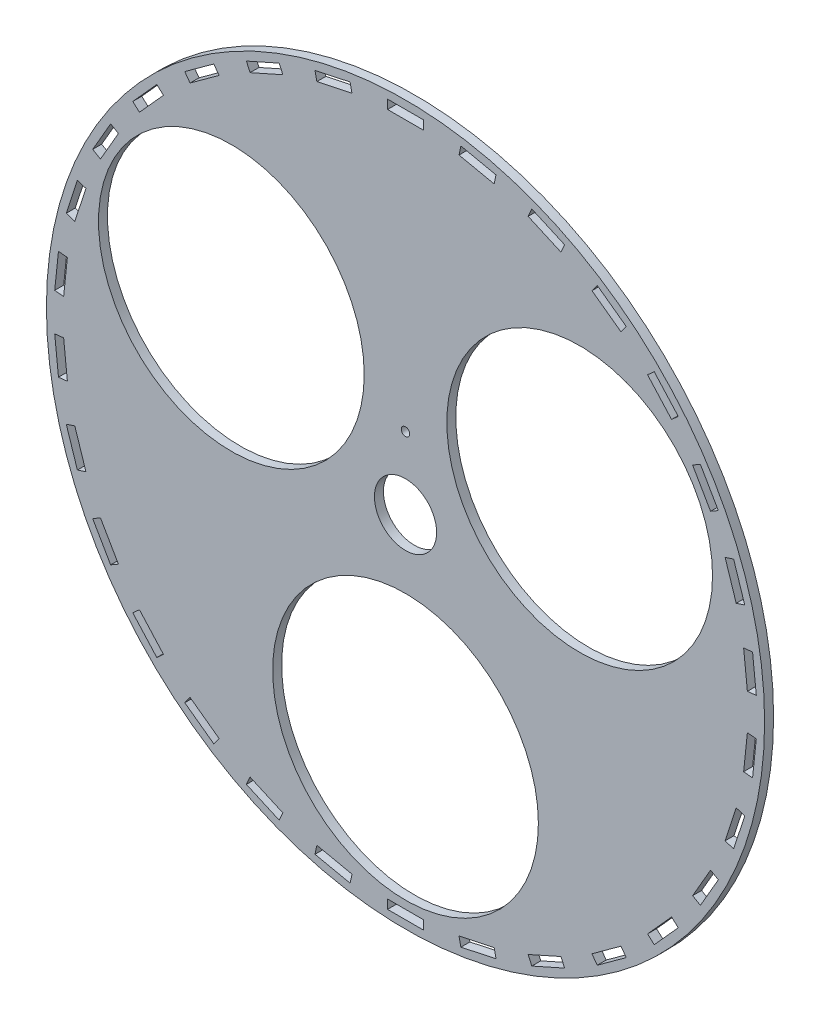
ISO-10303-21;
HEADER;
FILE_DESCRIPTION(('STEP AP214'),'2;1');
FILE_NAME('part.step','',(''),(''),'','','');
FILE_SCHEMA(('AUTOMOTIVE_DESIGN { 1 0 10303 214 1 1 1 1 }'));
ENDSEC;
DATA;
#1=APPLICATION_CONTEXT('core data for automotive mechanical design processes');
#2=APPLICATION_PROTOCOL_DEFINITION('international standard','automotive_design',2000,#1);
#3=PRODUCT_CONTEXT('',#1,'mechanical');
#4=PRODUCT('Part','Part','',(#3));
#5=PRODUCT_RELATED_PRODUCT_CATEGORY('part','',(#4));
#6=PRODUCT_DEFINITION_FORMATION('','',#4);
#7=PRODUCT_DEFINITION_CONTEXT('part definition',#1,'design');
#8=PRODUCT_DEFINITION('design','',#6,#7);
#9=PRODUCT_DEFINITION_SHAPE('','',#8);
#10=(LENGTH_UNIT() NAMED_UNIT(*) SI_UNIT(.MILLI.,.METRE.));
#11=(NAMED_UNIT(*) PLANE_ANGLE_UNIT() SI_UNIT($,.RADIAN.));
#12=(NAMED_UNIT(*) SI_UNIT($,.STERADIAN.) SOLID_ANGLE_UNIT());
#13=UNCERTAINTY_MEASURE_WITH_UNIT(LENGTH_MEASURE(1.E-05),#10,'distance_accuracy_value','');
#14=(GEOMETRIC_REPRESENTATION_CONTEXT(3) GLOBAL_UNCERTAINTY_ASSIGNED_CONTEXT((#13)) GLOBAL_UNIT_ASSIGNED_CONTEXT((#10,
#11,#12)) REPRESENTATION_CONTEXT('',''));
#15=CARTESIAN_POINT('',(0.,0.,0.));
#16=DIRECTION('',(0.,0.,1.));
#17=DIRECTION('',(1.,0.,0.));
#18=AXIS2_PLACEMENT_3D('',#15,#16,#17);
#19=CARTESIAN_POINT('',(0.,0.,3.175));
#20=DIRECTION('',(0.,0.,1.));
#21=DIRECTION('',(1.,0.,0.));
#22=AXIS2_PLACEMENT_3D('',#19,#20,#21);
#23=PLANE('',#22);
#24=CARTESIAN_POINT('',(-61.5917267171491,35.5600000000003,3.175));
#25=DIRECTION('',(0.,0.,1.));
#26=DIRECTION('',(1.,0.,0.));
#27=AXIS2_PLACEMENT_3D('',#24,#25,#26);
#28=CIRCLE('',#27,46.99);
#29=CARTESIAN_POINT('',(-14.6017267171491,35.5600000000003,3.175));
#30=VERTEX_POINT('',#29);
#31=EDGE_CURVE('E1760',#30,#30,#28,.T.);
#32=ORIENTED_EDGE('',*,*,#31,.F.);
#33=EDGE_LOOP('',(#32));
#34=FACE_BOUND('',#33,.T.);
#35=DIRECTION('',(0.978147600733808,0.207911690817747,0.));
#36=VECTOR('',#35,1.);
#37=CARTESIAN_POINT('',(19.5862374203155,-122.687815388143,3.175));
#38=LINE('',#37,#36);
#39=CARTESIAN_POINT('',(19.5862374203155,-122.687815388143,3.175));
#40=VERTEX_POINT('',#39);
#41=CARTESIAN_POINT('',(32.0087119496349,-120.047336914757,3.175));
#42=VERTEX_POINT('',#41);
#43=EDGE_CURVE('E778',#40,#42,#38,.T.);
#44=ORIENTED_EDGE('',*,*,#43,.F.);
#45=DIRECTION('',(0.207911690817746,-0.978147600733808,0.));
#46=VECTOR('',#45,1.);
#47=CARTESIAN_POINT('',(18.9261178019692,-119.582196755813,3.175));
#48=LINE('',#47,#46);
#49=CARTESIAN_POINT('',(18.9261178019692,-119.582196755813,3.175));
#50=VERTEX_POINT('',#49);
#51=EDGE_CURVE('E770',#50,#40,#48,.T.);
#52=ORIENTED_EDGE('',*,*,#51,.F.);
#53=DIRECTION('',(-0.978147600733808,-0.207911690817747,0.));
#54=VECTOR('',#53,1.);
#55=CARTESIAN_POINT('',(18.9261178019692,-119.582196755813,3.175));
#56=LINE('',#55,#54);
#57=CARTESIAN_POINT('',(31.3485923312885,-116.941718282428,3.175));
#58=VERTEX_POINT('',#57);
#59=EDGE_CURVE('E793',#58,#50,#56,.T.);
#60=ORIENTED_EDGE('',*,*,#59,.F.);
#61=DIRECTION('',(-0.207911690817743,0.978147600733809,0.));
#62=VECTOR('',#61,1.);
#63=CARTESIAN_POINT('',(31.3485923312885,-116.941718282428,3.175));
#64=LINE('',#63,#62);
#65=EDGE_CURVE('E791',#42,#58,#64,.T.);
#66=ORIENTED_EDGE('',*,*,#65,.F.);
#67=EDGE_LOOP('',(#44,#52,#60,#66));
#68=FACE_BOUND('',#67,.T.);
#69=DIRECTION('',(0.913545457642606,0.406736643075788,0.));
#70=VECTOR('',#69,1.);
#71=CARTESIAN_POINT('',(44.6664622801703,-115.934584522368,3.175));
#72=LINE('',#71,#70);
#73=CARTESIAN_POINT('',(44.6664622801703,-115.934584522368,3.175));
#74=VERTEX_POINT('',#73);
#75=CARTESIAN_POINT('',(56.2684895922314,-110.769029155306,3.175));
#76=VERTEX_POINT('',#75);
#77=EDGE_CURVE('E811',#74,#76,#72,.T.);
#78=ORIENTED_EDGE('',*,*,#77,.F.);
#79=DIRECTION('',(0.406736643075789,-0.913545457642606,0.));
#80=VECTOR('',#79,1.);
#81=CARTESIAN_POINT('',(43.3750734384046,-113.034077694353,3.175));
#82=LINE('',#81,#80);
#83=CARTESIAN_POINT('',(43.3750734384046,-113.034077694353,3.175));
#84=VERTEX_POINT('',#83);
#85=EDGE_CURVE('E809',#84,#74,#82,.T.);
#86=ORIENTED_EDGE('',*,*,#85,.F.);
#87=DIRECTION('',(-0.913545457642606,-0.406736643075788,0.));
#88=VECTOR('',#87,1.);
#89=CARTESIAN_POINT('',(43.3750734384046,-113.034077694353,3.175));
#90=LINE('',#89,#88);
#91=CARTESIAN_POINT('',(54.9771007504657,-107.86852232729,3.175));
#92=VERTEX_POINT('',#91);
#93=EDGE_CURVE('E817',#92,#84,#90,.T.);
#94=ORIENTED_EDGE('',*,*,#93,.F.);
#95=DIRECTION('',(-0.406736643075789,0.913545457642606,0.));
#96=VECTOR('',#95,1.);
#97=CARTESIAN_POINT('',(54.9771007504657,-107.86852232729,3.175));
#98=LINE('',#97,#96);
#99=EDGE_CURVE('E814',#76,#92,#98,.T.);
#100=ORIENTED_EDGE('',*,*,#99,.F.);
#101=EDGE_LOOP('',(#78,#86,#94,#100));
#102=FACE_BOUND('',#101,.T.);
#103=DIRECTION('',(0.809016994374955,0.587785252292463,0.));
#104=VECTOR('',#103,1.);
#105=CARTESIAN_POINT('',(67.7945484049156,-104.114455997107,3.175));
#106=LINE('',#105,#104);
#107=CARTESIAN_POINT('',(67.7945484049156,-104.114455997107,3.175));
#108=VERTEX_POINT('',#107);
#109=CARTESIAN_POINT('',(78.0690642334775,-96.6495832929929,3.175));
#110=VERTEX_POINT('',#109);
#111=EDGE_CURVE('E842',#108,#110,#106,.T.);
#112=ORIENTED_EDGE('',*,*,#111,.F.);
#113=DIRECTION('',(0.587785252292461,-0.809016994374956,0.));
#114=VECTOR('',#113,1.);
#115=CARTESIAN_POINT('',(65.928330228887,-101.545827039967,3.175));
#116=LINE('',#115,#114);
#117=CARTESIAN_POINT('',(65.928330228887,-101.545827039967,3.175));
#118=VERTEX_POINT('',#117);
#119=EDGE_CURVE('E840',#118,#108,#116,.T.);
#120=ORIENTED_EDGE('',*,*,#119,.F.);
#121=DIRECTION('',(-0.809016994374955,-0.587785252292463,0.));
#122=VECTOR('',#121,1.);
#123=CARTESIAN_POINT('',(65.928330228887,-101.545827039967,3.175));
#124=LINE('',#123,#122);
#125=CARTESIAN_POINT('',(76.2028460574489,-94.0809543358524,3.175));
#126=VERTEX_POINT('',#125);
#127=EDGE_CURVE('E848',#126,#118,#124,.T.);
#128=ORIENTED_EDGE('',*,*,#127,.F.);
#129=DIRECTION('',(-0.587785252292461,0.809016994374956,0.));
#130=VECTOR('',#129,1.);
#131=CARTESIAN_POINT('',(76.2028460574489,-94.0809543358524,3.175));
#132=LINE('',#131,#130);
#133=EDGE_CURVE('E845',#110,#126,#132,.T.);
#134=ORIENTED_EDGE('',*,*,#133,.F.);
#135=EDGE_LOOP('',(#112,#120,#128,#134));
#136=FACE_BOUND('',#135,.T.);
#137=DIRECTION('',(0.669130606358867,0.743144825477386,0.));
#138=VECTOR('',#137,1.);
#139=CARTESIAN_POINT('',(87.9596874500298,-87.7440261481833,3.175));
#140=LINE('',#139,#138);
#141=CARTESIAN_POINT('',(87.9596874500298,-87.7440261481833,3.175));
#142=VERTEX_POINT('',#141);
#143=CARTESIAN_POINT('',(96.4576461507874,-78.3060868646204,3.175));
#144=VERTEX_POINT('',#143);
#145=EDGE_CURVE('E873',#142,#144,#140,.T.);
#146=ORIENTED_EDGE('',*,*,#145,.F.);
#147=DIRECTION('',(0.743144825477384,-0.669130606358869,0.));
#148=VECTOR('',#147,1.);
#149=CARTESIAN_POINT('',(85.6002026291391,-85.6195364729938,3.175));
#150=LINE('',#149,#148);
#151=CARTESIAN_POINT('',(85.6002026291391,-85.6195364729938,3.175));
#152=VERTEX_POINT('',#151);
#153=EDGE_CURVE('E871',#152,#142,#150,.T.);
#154=ORIENTED_EDGE('',*,*,#153,.F.);
#155=DIRECTION('',(-0.669130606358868,-0.743144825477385,0.));
#156=VECTOR('',#155,1.);
#157=CARTESIAN_POINT('',(85.6002026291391,-85.6195364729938,3.175));
#158=LINE('',#157,#156);
#159=CARTESIAN_POINT('',(94.0981613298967,-76.1815971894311,3.175));
#160=VERTEX_POINT('',#159);
#161=EDGE_CURVE('E879',#160,#152,#158,.T.);
#162=ORIENTED_EDGE('',*,*,#161,.F.);
#163=DIRECTION('',(-0.743144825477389,0.669130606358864,0.));
#164=VECTOR('',#163,1.);
#165=CARTESIAN_POINT('',(94.0981613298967,-76.1815971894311,3.175));
#166=LINE('',#165,#164);
#167=EDGE_CURVE('E876',#144,#160,#166,.T.);
#168=ORIENTED_EDGE('',*,*,#167,.F.);
#169=EDGE_LOOP('',(#146,#154,#162,#168));
#170=FACE_BOUND('',#169,.T.);
#171=DIRECTION('',(0.500000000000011,0.866025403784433,0.));
#172=VECTOR('',#171,1.);
#173=CARTESIAN_POINT('',(104.280566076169,-67.5387613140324,3.175));
#174=LINE('',#173,#172);
#175=CARTESIAN_POINT('',(104.280566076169,-67.5387613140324,3.175));
#176=VERTEX_POINT('',#175);
#177=CARTESIAN_POINT('',(110.630566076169,-56.5402386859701,3.175));
#178=VERTEX_POINT('',#177);
#179=EDGE_CURVE('E904',#176,#178,#174,.T.);
#180=ORIENTED_EDGE('',*,*,#179,.F.);
#181=DIRECTION('',(0.866025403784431,-0.500000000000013,0.));
#182=VECTOR('',#181,1.);
#183=CARTESIAN_POINT('',(101.530935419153,-65.9512613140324,3.175));
#184=LINE('',#183,#182);
#185=CARTESIAN_POINT('',(101.530935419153,-65.9512613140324,3.175));
#186=VERTEX_POINT('',#185);
#187=EDGE_CURVE('E902',#186,#176,#184,.T.);
#188=ORIENTED_EDGE('',*,*,#187,.F.);
#189=DIRECTION('',(-0.500000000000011,-0.866025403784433,0.));
#190=VECTOR('',#189,1.);
#191=CARTESIAN_POINT('',(101.530935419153,-65.9512613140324,3.175));
#192=LINE('',#191,#190);
#193=CARTESIAN_POINT('',(107.880935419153,-54.9527386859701,3.175));
#194=VERTEX_POINT('',#193);
#195=EDGE_CURVE('E910',#194,#186,#192,.T.);
#196=ORIENTED_EDGE('',*,*,#195,.F.);
#197=DIRECTION('',(-0.866025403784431,0.500000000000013,0.));
#198=VECTOR('',#197,1.);
#199=CARTESIAN_POINT('',(107.880935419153,-54.9527386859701,3.175));
#200=LINE('',#199,#198);
#201=EDGE_CURVE('E907',#178,#194,#200,.T.);
#202=ORIENTED_EDGE('',*,*,#201,.F.);
#203=EDGE_LOOP('',(#180,#188,#196,#202));
#204=FACE_BOUND('',#203,.T.);
#205=DIRECTION('',(0.309016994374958,0.95105651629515,0.));
#206=VECTOR('',#205,1.);
#207=CARTESIAN_POINT('',(116.043883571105,-44.3817285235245,3.175));
#208=LINE('',#207,#206);
#209=CARTESIAN_POINT('',(116.043883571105,-44.3817285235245,3.175));
#210=VERTEX_POINT('',#209);
#211=CARTESIAN_POINT('',(119.968399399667,-32.3033107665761,3.175));
#212=VERTEX_POINT('',#211);
#213=EDGE_CURVE('E935',#210,#212,#208,.T.);
#214=ORIENTED_EDGE('',*,*,#213,.F.);
#215=DIRECTION('',(0.95105651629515,-0.309016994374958,0.));
#216=VECTOR('',#215,1.);
#217=CARTESIAN_POINT('',(113.024279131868,-43.4005995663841,3.175));
#218=LINE('',#217,#216);
#219=CARTESIAN_POINT('',(113.024279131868,-43.4005995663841,3.175));
#220=VERTEX_POINT('',#219);
#221=EDGE_CURVE('E933',#220,#210,#218,.T.);
#222=ORIENTED_EDGE('',*,*,#221,.F.);
#223=DIRECTION('',(-0.309016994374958,-0.95105651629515,0.));
#224=VECTOR('',#223,1.);
#225=CARTESIAN_POINT('',(113.024279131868,-43.4005995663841,3.175));
#226=LINE('',#225,#224);
#227=CARTESIAN_POINT('',(116.94879496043,-31.3221818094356,3.175));
#228=VERTEX_POINT('',#227);
#229=EDGE_CURVE('E941',#228,#220,#226,.T.);
#230=ORIENTED_EDGE('',*,*,#229,.F.);
#231=DIRECTION('',(-0.95105651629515,0.309016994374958,0.));
#232=VECTOR('',#231,1.);
#233=CARTESIAN_POINT('',(116.94879496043,-31.3221818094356,3.175));
#234=LINE('',#233,#232);
#235=EDGE_CURVE('E938',#212,#228,#234,.T.);
#236=ORIENTED_EDGE('',*,*,#235,.F.);
#237=EDGE_LOOP('',(#214,#222,#230,#236));
#238=FACE_BOUND('',#237,.T.);
#239=DIRECTION('',(0.104528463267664,0.994521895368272,0.));
#240=VECTOR('',#239,1.);
#241=CARTESIAN_POINT('',(122.73552651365,-19.285001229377,3.175));
#242=LINE('',#241,#240);
#243=CARTESIAN_POINT('',(122.73552651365,-19.285001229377,3.175));
#244=VERTEX_POINT('',#243);
#245=CARTESIAN_POINT('',(124.06303799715,-6.6545731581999,3.175));
#246=VERTEX_POINT('',#245);
#247=EDGE_CURVE('E966',#244,#246,#242,.T.);
#248=ORIENTED_EDGE('',*,*,#247,.F.);
#249=DIRECTION('',(0.994521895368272,-0.104528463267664,0.));
#250=VECTOR('',#249,1.);
#251=CARTESIAN_POINT('',(119.577919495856,-18.9531233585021,3.175));
#252=LINE('',#251,#250);
#253=CARTESIAN_POINT('',(119.577919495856,-18.9531233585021,3.175));
#254=VERTEX_POINT('',#253);
#255=EDGE_CURVE('E964',#254,#244,#252,.T.);
#256=ORIENTED_EDGE('',*,*,#255,.F.);
#257=DIRECTION('',(-0.104528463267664,-0.994521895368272,0.));
#258=VECTOR('',#257,1.);
#259=CARTESIAN_POINT('',(119.577919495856,-18.9531233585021,3.175));
#260=LINE('',#259,#258);
#261=CARTESIAN_POINT('',(120.905430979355,-6.32269528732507,3.175));
#262=VERTEX_POINT('',#261);
#263=EDGE_CURVE('E972',#262,#254,#260,.T.);
#264=ORIENTED_EDGE('',*,*,#263,.F.);
#265=DIRECTION('',(-0.994521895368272,0.104528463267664,0.));
#266=VECTOR('',#265,1.);
#267=CARTESIAN_POINT('',(120.905430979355,-6.32269528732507,3.175));
#268=LINE('',#267,#266);
#269=EDGE_CURVE('E969',#246,#262,#268,.T.);
#270=ORIENTED_EDGE('',*,*,#269,.F.);
#271=EDGE_LOOP('',(#248,#256,#264,#270));
#272=FACE_BOUND('',#271,.T.);
#273=DIRECTION('',(-0.104528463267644,0.994521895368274,0.));
#274=VECTOR('',#273,1.);
#275=CARTESIAN_POINT('',(124.06303799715,6.6545731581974,3.175));
#276=LINE('',#275,#274);
#277=CARTESIAN_POINT('',(124.06303799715,6.6545731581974,3.175));
#278=VERTEX_POINT('',#277);
#279=CARTESIAN_POINT('',(122.735526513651,19.2850012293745,3.175));
#280=VERTEX_POINT('',#279);
#281=EDGE_CURVE('E997',#278,#280,#276,.T.);
#282=ORIENTED_EDGE('',*,*,#281,.F.);
#283=DIRECTION('',(0.994521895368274,0.104528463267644,0.));
#284=VECTOR('',#283,1.);
#285=CARTESIAN_POINT('',(120.905430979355,6.32269528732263,3.175));
#286=LINE('',#285,#284);
#287=CARTESIAN_POINT('',(120.905430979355,6.32269528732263,3.175));
#288=VERTEX_POINT('',#287);
#289=EDGE_CURVE('E995',#288,#278,#286,.T.);
#290=ORIENTED_EDGE('',*,*,#289,.F.);
#291=DIRECTION('',(0.104528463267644,-0.994521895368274,0.));
#292=VECTOR('',#291,1.);
#293=CARTESIAN_POINT('',(120.905430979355,6.32269528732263,3.175));
#294=LINE('',#293,#292);
#295=CARTESIAN_POINT('',(119.577919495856,18.9531233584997,3.175));
#296=VERTEX_POINT('',#295);
#297=EDGE_CURVE('E1003',#296,#288,#294,.T.);
#298=ORIENTED_EDGE('',*,*,#297,.F.);
#299=DIRECTION('',(-0.994521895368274,-0.104528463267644,0.));
#300=VECTOR('',#299,1.);
#301=CARTESIAN_POINT('',(119.577919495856,18.9531233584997,3.175));
#302=LINE('',#301,#300);
#303=EDGE_CURVE('E1000',#280,#296,#302,.T.);
#304=ORIENTED_EDGE('',*,*,#303,.F.);
#305=EDGE_LOOP('',(#282,#290,#298,#304));
#306=FACE_BOUND('',#305,.T.);
#307=DIRECTION('',(-0.309016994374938,0.951056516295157,0.));
#308=VECTOR('',#307,1.);
#309=CARTESIAN_POINT('',(119.968399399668,32.3033107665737,3.175));
#310=LINE('',#309,#308);
#311=CARTESIAN_POINT('',(119.968399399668,32.3033107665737,3.175));
#312=VERTEX_POINT('',#311);
#313=CARTESIAN_POINT('',(116.043883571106,44.3817285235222,3.175));
#314=VERTEX_POINT('',#313);
#315=EDGE_CURVE('E1028',#312,#314,#310,.T.);
#316=ORIENTED_EDGE('',*,*,#315,.F.);
#317=DIRECTION('',(0.951056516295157,0.309016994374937,0.));
#318=VECTOR('',#317,1.);
#319=CARTESIAN_POINT('',(116.94879496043,31.3221818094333,3.175));
#320=LINE('',#319,#318);
#321=CARTESIAN_POINT('',(116.94879496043,31.3221818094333,3.175));
#322=VERTEX_POINT('',#321);
#323=EDGE_CURVE('E1026',#322,#312,#320,.T.);
#324=ORIENTED_EDGE('',*,*,#323,.F.);
#325=DIRECTION('',(0.309016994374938,-0.951056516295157,0.));
#326=VECTOR('',#325,1.);
#327=CARTESIAN_POINT('',(116.94879496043,31.3221818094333,3.175));
#328=LINE('',#327,#326);
#329=CARTESIAN_POINT('',(113.024279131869,43.4005995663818,3.175));
#330=VERTEX_POINT('',#329);
#331=EDGE_CURVE('E1034',#330,#322,#328,.T.);
#332=ORIENTED_EDGE('',*,*,#331,.F.);
#333=DIRECTION('',(-0.951056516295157,-0.309016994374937,0.));
#334=VECTOR('',#333,1.);
#335=CARTESIAN_POINT('',(113.024279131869,43.4005995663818,3.175));
#336=LINE('',#335,#334);
#337=EDGE_CURVE('E1031',#314,#330,#336,.T.);
#338=ORIENTED_EDGE('',*,*,#337,.F.);
#339=EDGE_LOOP('',(#316,#324,#332,#338));
#340=FACE_BOUND('',#339,.T.);
#341=DIRECTION('',(-0.499999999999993,0.866025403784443,0.));
#342=VECTOR('',#341,1.);
#343=CARTESIAN_POINT('',(110.63056607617,56.5402386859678,3.175));
#344=LINE('',#343,#342);
#345=CARTESIAN_POINT('',(110.63056607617,56.5402386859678,3.175));
#346=VERTEX_POINT('',#345);
#347=CARTESIAN_POINT('',(104.28056607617,67.5387613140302,3.175));
#348=VERTEX_POINT('',#347);
#349=EDGE_CURVE('E1059',#346,#348,#344,.T.);
#350=ORIENTED_EDGE('',*,*,#349,.F.);
#351=DIRECTION('',(0.866025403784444,0.499999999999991,0.));
#352=VECTOR('',#351,1.);
#353=CARTESIAN_POINT('',(107.880935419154,54.9527386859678,3.175));
#354=LINE('',#353,#352);
#355=CARTESIAN_POINT('',(107.880935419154,54.9527386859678,3.175));
#356=VERTEX_POINT('',#355);
#357=EDGE_CURVE('E1057',#356,#346,#354,.T.);
#358=ORIENTED_EDGE('',*,*,#357,.F.);
#359=DIRECTION('',(0.499999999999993,-0.866025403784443,0.));
#360=VECTOR('',#359,1.);
#361=CARTESIAN_POINT('',(107.880935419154,54.9527386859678,3.175));
#362=LINE('',#361,#360);
#363=CARTESIAN_POINT('',(101.530935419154,65.9512613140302,3.175));
#364=VERTEX_POINT('',#363);
#365=EDGE_CURVE('E1065',#364,#356,#362,.T.);
#366=ORIENTED_EDGE('',*,*,#365,.F.);
#367=DIRECTION('',(-0.866025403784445,-0.499999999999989,0.));
#368=VECTOR('',#367,1.);
#369=CARTESIAN_POINT('',(101.530935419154,65.9512613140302,3.175));
#370=LINE('',#369,#368);
#371=EDGE_CURVE('E1062',#348,#364,#370,.T.);
#372=ORIENTED_EDGE('',*,*,#371,.F.);
#373=EDGE_LOOP('',(#350,#358,#366,#372));
#374=FACE_BOUND('',#373,.T.);
#375=DIRECTION('',(-0.669130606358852,0.7431448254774,0.));
#376=VECTOR('',#375,1.);
#377=CARTESIAN_POINT('',(96.4576461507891,78.3060868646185,3.175));
#378=LINE('',#377,#376);
#379=CARTESIAN_POINT('',(96.4576461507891,78.3060868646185,3.175));
#380=VERTEX_POINT('',#379);
#381=CARTESIAN_POINT('',(87.9596874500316,87.7440261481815,3.175));
#382=VERTEX_POINT('',#381);
#383=EDGE_CURVE('E1090',#380,#382,#378,.T.);
#384=ORIENTED_EDGE('',*,*,#383,.F.);
#385=DIRECTION('',(0.743144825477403,0.669130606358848,0.));
#386=VECTOR('',#385,1.);
#387=CARTESIAN_POINT('',(94.0981613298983,76.1815971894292,3.175));
#388=LINE('',#387,#386);
#389=CARTESIAN_POINT('',(94.0981613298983,76.1815971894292,3.175));
#390=VERTEX_POINT('',#389);
#391=EDGE_CURVE('E1088',#390,#380,#388,.T.);
#392=ORIENTED_EDGE('',*,*,#391,.F.);
#393=DIRECTION('',(0.669130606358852,-0.7431448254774,0.));
#394=VECTOR('',#393,1.);
#395=CARTESIAN_POINT('',(94.0981613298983,76.1815971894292,3.175));
#396=LINE('',#395,#394);
#397=CARTESIAN_POINT('',(85.6002026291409,85.6195364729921,3.175));
#398=VERTEX_POINT('',#397);
#399=EDGE_CURVE('E1096',#398,#390,#396,.T.);
#400=ORIENTED_EDGE('',*,*,#399,.F.);
#401=DIRECTION('',(-0.743144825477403,-0.669130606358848,0.));
#402=VECTOR('',#401,1.);
#403=CARTESIAN_POINT('',(85.6002026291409,85.6195364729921,3.175));
#404=LINE('',#403,#402);
#405=EDGE_CURVE('E1093',#382,#398,#404,.T.);
#406=ORIENTED_EDGE('',*,*,#405,.F.);
#407=EDGE_LOOP('',(#384,#392,#400,#406));
#408=FACE_BOUND('',#407,.T.);
#409=DIRECTION('',(-0.809016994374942,0.587785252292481,0.));
#410=VECTOR('',#409,1.);
#411=CARTESIAN_POINT('',(78.0690642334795,96.6495832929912,3.175));
#412=LINE('',#411,#410);
#413=CARTESIAN_POINT('',(78.0690642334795,96.6495832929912,3.175));
#414=VERTEX_POINT('',#413);
#415=CARTESIAN_POINT('',(67.7945484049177,104.114455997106,3.175));
#416=VERTEX_POINT('',#415);
#417=EDGE_CURVE('E1121',#414,#416,#412,.T.);
#418=ORIENTED_EDGE('',*,*,#417,.F.);
#419=DIRECTION('',(0.587785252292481,0.809016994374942,0.));
#420=VECTOR('',#419,1.);
#421=CARTESIAN_POINT('',(76.2028460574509,94.0809543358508,3.175));
#422=LINE('',#421,#420);
#423=CARTESIAN_POINT('',(76.2028460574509,94.0809543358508,3.175));
#424=VERTEX_POINT('',#423);
#425=EDGE_CURVE('E1119',#424,#414,#422,.T.);
#426=ORIENTED_EDGE('',*,*,#425,.F.);
#427=DIRECTION('',(0.809016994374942,-0.587785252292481,0.));
#428=VECTOR('',#427,1.);
#429=CARTESIAN_POINT('',(76.2028460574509,94.0809543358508,3.175));
#430=LINE('',#429,#428);
#431=CARTESIAN_POINT('',(65.9283302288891,101.545827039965,3.175));
#432=VERTEX_POINT('',#431);
#433=EDGE_CURVE('E1127',#432,#424,#430,.T.);
#434=ORIENTED_EDGE('',*,*,#433,.F.);
#435=DIRECTION('',(-0.587785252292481,-0.809016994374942,0.));
#436=VECTOR('',#435,1.);
#437=CARTESIAN_POINT('',(65.9283302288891,101.545827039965,3.175));
#438=LINE('',#437,#436);
#439=EDGE_CURVE('E1124',#416,#432,#438,.T.);
#440=ORIENTED_EDGE('',*,*,#439,.F.);
#441=EDGE_LOOP('',(#418,#426,#434,#440));
#442=FACE_BOUND('',#441,.T.);
#443=DIRECTION('',(-0.913545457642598,0.406736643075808,0.));
#444=VECTOR('',#443,1.);
#445=CARTESIAN_POINT('',(56.2684895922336,110.769029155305,3.175));
#446=LINE('',#445,#444);
#447=CARTESIAN_POINT('',(56.2684895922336,110.769029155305,3.175));
#448=VERTEX_POINT('',#447);
#449=CARTESIAN_POINT('',(44.6664622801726,115.934584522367,3.175));
#450=VERTEX_POINT('',#449);
#451=EDGE_CURVE('E1152',#448,#450,#446,.T.);
#452=ORIENTED_EDGE('',*,*,#451,.F.);
#453=DIRECTION('',(0.406736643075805,0.913545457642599,0.));
#454=VECTOR('',#453,1.);
#455=CARTESIAN_POINT('',(54.9771007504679,107.868522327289,3.175));
#456=LINE('',#455,#454);
#457=CARTESIAN_POINT('',(54.9771007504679,107.868522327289,3.175));
#458=VERTEX_POINT('',#457);
#459=EDGE_CURVE('E1150',#458,#448,#456,.T.);
#460=ORIENTED_EDGE('',*,*,#459,.F.);
#461=DIRECTION('',(0.913545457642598,-0.406736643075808,0.));
#462=VECTOR('',#461,1.);
#463=CARTESIAN_POINT('',(54.9771007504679,107.868522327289,3.175));
#464=LINE('',#463,#462);
#465=CARTESIAN_POINT('',(43.3750734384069,113.034077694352,3.175));
#466=VERTEX_POINT('',#465);
#467=EDGE_CURVE('E1158',#466,#458,#464,.T.);
#468=ORIENTED_EDGE('',*,*,#467,.F.);
#469=DIRECTION('',(-0.406736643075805,-0.913545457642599,0.));
#470=VECTOR('',#469,1.);
#471=CARTESIAN_POINT('',(43.3750734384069,113.034077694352,3.175));
#472=LINE('',#471,#470);
#473=EDGE_CURVE('E1155',#450,#466,#472,.T.);
#474=ORIENTED_EDGE('',*,*,#473,.F.);
#475=EDGE_LOOP('',(#452,#460,#468,#474));
#476=FACE_BOUND('',#475,.T.);
#477=DIRECTION('',(-0.978147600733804,0.207911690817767,0.));
#478=VECTOR('',#477,1.);
#479=CARTESIAN_POINT('',(32.0087119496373,120.047336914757,3.175));
#480=LINE('',#479,#478);
#481=CARTESIAN_POINT('',(32.0087119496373,120.047336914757,3.175));
#482=VERTEX_POINT('',#481);
#483=CARTESIAN_POINT('',(19.586237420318,122.687815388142,3.175));
#484=VERTEX_POINT('',#483);
#485=EDGE_CURVE('E1183',#482,#484,#480,.T.);
#486=ORIENTED_EDGE('',*,*,#485,.F.);
#487=DIRECTION('',(0.207911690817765,0.978147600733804,0.));
#488=VECTOR('',#487,1.);
#489=CARTESIAN_POINT('',(31.3485923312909,116.941718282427,3.175));
#490=LINE('',#489,#488);
#491=CARTESIAN_POINT('',(31.3485923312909,116.941718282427,3.175));
#492=VERTEX_POINT('',#491);
#493=EDGE_CURVE('E1181',#492,#482,#490,.T.);
#494=ORIENTED_EDGE('',*,*,#493,.F.);
#495=DIRECTION('',(0.978147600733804,-0.207911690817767,0.));
#496=VECTOR('',#495,1.);
#497=CARTESIAN_POINT('',(31.3485923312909,116.941718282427,3.175));
#498=LINE('',#497,#496);
#499=CARTESIAN_POINT('',(18.9261178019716,119.582196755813,3.175));
#500=VERTEX_POINT('',#499);
#501=EDGE_CURVE('E1189',#500,#492,#498,.T.);
#502=ORIENTED_EDGE('',*,*,#501,.F.);
#503=DIRECTION('',(-0.207911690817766,-0.978147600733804,0.));
#504=VECTOR('',#503,1.);
#505=CARTESIAN_POINT('',(18.9261178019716,119.582196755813,3.175));
#506=LINE('',#505,#504);
#507=EDGE_CURVE('E1186',#484,#500,#506,.T.);
#508=ORIENTED_EDGE('',*,*,#507,.F.);
#509=EDGE_LOOP('',(#486,#494,#502,#508));
#510=FACE_BOUND('',#509,.T.);
#511=DIRECTION('',(-1.,0.,0.));
#512=VECTOR('',#511,1.);
#513=CARTESIAN_POINT('',(6.35000000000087,124.079,3.175));
#514=LINE('',#513,#512);
#515=CARTESIAN_POINT('',(6.35000000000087,124.079,3.175));
#516=VERTEX_POINT('',#515);
#517=CARTESIAN_POINT('',(-6.34999999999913,124.079,3.175));
#518=VERTEX_POINT('',#517);
#519=EDGE_CURVE('E1214',#516,#518,#514,.T.);
#520=ORIENTED_EDGE('',*,*,#519,.F.);
#521=DIRECTION('',(0.,1.,0.));
#522=VECTOR('',#521,1.);
#523=CARTESIAN_POINT('',(6.35000000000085,120.904,3.175));
#524=LINE('',#523,#522);
#525=CARTESIAN_POINT('',(6.35000000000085,120.904,3.175));
#526=VERTEX_POINT('',#525);
#527=EDGE_CURVE('E1212',#526,#516,#524,.T.);
#528=ORIENTED_EDGE('',*,*,#527,.F.);
#529=DIRECTION('',(1.,0.,0.));
#530=VECTOR('',#529,1.);
#531=CARTESIAN_POINT('',(6.35000000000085,120.904,3.175));
#532=LINE('',#531,#530);
#533=CARTESIAN_POINT('',(-6.34999999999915,120.904,3.175));
#534=VERTEX_POINT('',#533);
#535=EDGE_CURVE('E1220',#534,#526,#532,.T.);
#536=ORIENTED_EDGE('',*,*,#535,.F.);
#537=DIRECTION('',(0.,-1.,0.));
#538=VECTOR('',#537,1.);
#539=CARTESIAN_POINT('',(-6.34999999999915,120.904,3.175));
#540=LINE('',#539,#538);
#541=EDGE_CURVE('E1217',#518,#534,#540,.T.);
#542=ORIENTED_EDGE('',*,*,#541,.F.);
#543=EDGE_LOOP('',(#520,#528,#536,#542));
#544=FACE_BOUND('',#543,.T.);
#545=DIRECTION('',(-0.978147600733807,-0.207911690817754,0.));
#546=VECTOR('',#545,1.);
#547=CARTESIAN_POINT('',(-19.5862374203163,122.687815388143,3.175));
#548=LINE('',#547,#546);
#549=CARTESIAN_POINT('',(-19.5862374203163,122.687815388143,3.175));
#550=VERTEX_POINT('',#549);
#551=CARTESIAN_POINT('',(-32.0087119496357,120.047336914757,3.175));
#552=VERTEX_POINT('',#551);
#553=EDGE_CURVE('E1245',#550,#552,#548,.T.);
#554=ORIENTED_EDGE('',*,*,#553,.F.);
#555=DIRECTION('',(-0.207911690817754,0.978147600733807,0.));
#556=VECTOR('',#555,1.);
#557=CARTESIAN_POINT('',(-18.92611780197,119.582196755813,3.175));
#558=LINE('',#557,#556);
#559=CARTESIAN_POINT('',(-18.92611780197,119.582196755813,3.175));
#560=VERTEX_POINT('',#559);
#561=EDGE_CURVE('E1243',#560,#550,#558,.T.);
#562=ORIENTED_EDGE('',*,*,#561,.F.);
#563=DIRECTION('',(0.978147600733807,0.207911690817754,0.));
#564=VECTOR('',#563,1.);
#565=CARTESIAN_POINT('',(-18.92611780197,119.582196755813,3.175));
#566=LINE('',#565,#564);
#567=CARTESIAN_POINT('',(-31.3485923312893,116.941718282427,3.175));
#568=VERTEX_POINT('',#567);
#569=EDGE_CURVE('E1251',#568,#560,#566,.T.);
#570=ORIENTED_EDGE('',*,*,#569,.F.);
#571=DIRECTION('',(0.207911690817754,-0.978147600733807,0.));
#572=VECTOR('',#571,1.);
#573=CARTESIAN_POINT('',(-31.3485923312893,116.941718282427,3.175));
#574=LINE('',#573,#572);
#575=EDGE_CURVE('E1248',#552,#568,#574,.T.);
#576=ORIENTED_EDGE('',*,*,#575,.F.);
#577=EDGE_LOOP('',(#554,#562,#570,#576));
#578=FACE_BOUND('',#577,.T.);
#579=DIRECTION('',(-0.913545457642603,-0.406736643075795,0.));
#580=VECTOR('',#579,1.);
#581=CARTESIAN_POINT('',(-44.666462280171,115.934584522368,3.175));
#582=LINE('',#581,#580);
#583=CARTESIAN_POINT('',(-44.666462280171,115.934584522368,3.175));
#584=VERTEX_POINT('',#583);
#585=CARTESIAN_POINT('',(-56.2684895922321,110.769029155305,3.175));
#586=VERTEX_POINT('',#585);
#587=EDGE_CURVE('E1276',#584,#586,#582,.T.);
#588=ORIENTED_EDGE('',*,*,#587,.F.);
#589=DIRECTION('',(-0.406736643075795,0.913545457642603,0.));
#590=VECTOR('',#589,1.);
#591=CARTESIAN_POINT('',(-43.3750734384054,113.034077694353,3.175));
#592=LINE('',#591,#590);
#593=CARTESIAN_POINT('',(-43.3750734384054,113.034077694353,3.175));
#594=VERTEX_POINT('',#593);
#595=EDGE_CURVE('E1274',#594,#584,#592,.T.);
#596=ORIENTED_EDGE('',*,*,#595,.F.);
#597=DIRECTION('',(0.913545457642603,0.406736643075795,0.));
#598=VECTOR('',#597,1.);
#599=CARTESIAN_POINT('',(-43.3750734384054,113.034077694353,3.175));
#600=LINE('',#599,#598);
#601=CARTESIAN_POINT('',(-54.9771007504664,107.86852232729,3.175));
#602=VERTEX_POINT('',#601);
#603=EDGE_CURVE('E1282',#602,#594,#600,.T.);
#604=ORIENTED_EDGE('',*,*,#603,.F.);
#605=DIRECTION('',(0.406736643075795,-0.913545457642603,0.));
#606=VECTOR('',#605,1.);
#607=CARTESIAN_POINT('',(-54.9771007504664,107.86852232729,3.175));
#608=LINE('',#607,#606);
#609=EDGE_CURVE('E1279',#586,#602,#608,.T.);
#610=ORIENTED_EDGE('',*,*,#609,.F.);
#611=EDGE_LOOP('',(#588,#596,#604,#610));
#612=FACE_BOUND('',#611,.T.);
#613=DIRECTION('',(-0.80901699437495,-0.587785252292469,0.));
#614=VECTOR('',#613,1.);
#615=CARTESIAN_POINT('',(-67.7945484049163,104.114455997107,3.175));
#616=LINE('',#615,#614);
#617=CARTESIAN_POINT('',(-67.7945484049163,104.114455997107,3.175));
#618=VERTEX_POINT('',#617);
#619=CARTESIAN_POINT('',(-78.0690642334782,96.6495832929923,3.175));
#620=VERTEX_POINT('',#619);
#621=EDGE_CURVE('E1307',#618,#620,#616,.T.);
#622=ORIENTED_EDGE('',*,*,#621,.F.);
#623=DIRECTION('',(-0.587785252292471,0.809016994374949,0.));
#624=VECTOR('',#623,1.);
#625=CARTESIAN_POINT('',(-65.9283302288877,101.545827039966,3.175));
#626=LINE('',#625,#624);
#627=CARTESIAN_POINT('',(-65.9283302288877,101.545827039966,3.175));
#628=VERTEX_POINT('',#627);
#629=EDGE_CURVE('E1305',#628,#618,#626,.T.);
#630=ORIENTED_EDGE('',*,*,#629,.F.);
#631=DIRECTION('',(0.80901699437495,0.587785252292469,0.));
#632=VECTOR('',#631,1.);
#633=CARTESIAN_POINT('',(-65.9283302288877,101.545827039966,3.175));
#634=LINE('',#633,#632);
#635=CARTESIAN_POINT('',(-76.2028460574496,94.0809543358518,3.175));
#636=VERTEX_POINT('',#635);
#637=EDGE_CURVE('E1313',#636,#628,#634,.T.);
#638=ORIENTED_EDGE('',*,*,#637,.F.);
#639=DIRECTION('',(0.587785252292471,-0.809016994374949,0.));
#640=VECTOR('',#639,1.);
#641=CARTESIAN_POINT('',(-76.2028460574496,94.0809543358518,3.175));
#642=LINE('',#641,#640);
#643=EDGE_CURVE('E1310',#620,#636,#642,.T.);
#644=ORIENTED_EDGE('',*,*,#643,.F.);
#645=EDGE_LOOP('',(#622,#630,#638,#644));
#646=FACE_BOUND('',#645,.T.);
#647=DIRECTION('',(-0.669130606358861,-0.743144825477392,0.));
#648=VECTOR('',#647,1.);
#649=CARTESIAN_POINT('',(-87.9596874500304,87.7440261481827,3.175));
#650=LINE('',#649,#648);
#651=CARTESIAN_POINT('',(-87.9596874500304,87.7440261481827,3.175));
#652=VERTEX_POINT('',#651);
#653=CARTESIAN_POINT('',(-96.457646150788,78.3060868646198,3.175));
#654=VERTEX_POINT('',#653);
#655=EDGE_CURVE('E1338',#652,#654,#650,.T.);
#656=ORIENTED_EDGE('',*,*,#655,.F.);
#657=DIRECTION('',(-0.743144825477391,0.669130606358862,0.));
#658=VECTOR('',#657,1.);
#659=CARTESIAN_POINT('',(-85.6002026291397,85.6195364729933,3.175));
#660=LINE('',#659,#658);
#661=CARTESIAN_POINT('',(-85.6002026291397,85.6195364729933,3.175));
#662=VERTEX_POINT('',#661);
#663=EDGE_CURVE('E1336',#662,#652,#660,.T.);
#664=ORIENTED_EDGE('',*,*,#663,.F.);
#665=DIRECTION('',(0.669130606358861,0.743144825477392,0.));
#666=VECTOR('',#665,1.);
#667=CARTESIAN_POINT('',(-85.6002026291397,85.6195364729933,3.175));
#668=LINE('',#667,#666);
#669=CARTESIAN_POINT('',(-94.0981613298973,76.1815971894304,3.175));
#670=VERTEX_POINT('',#669);
#671=EDGE_CURVE('E1344',#670,#662,#668,.T.);
#672=ORIENTED_EDGE('',*,*,#671,.F.);
#673=DIRECTION('',(0.743144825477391,-0.669130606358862,0.));
#674=VECTOR('',#673,1.);
#675=CARTESIAN_POINT('',(-94.0981613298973,76.1815971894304,3.175));
#676=LINE('',#675,#674);
#677=EDGE_CURVE('E1341',#654,#670,#676,.T.);
#678=ORIENTED_EDGE('',*,*,#677,.F.);
#679=EDGE_LOOP('',(#656,#664,#672,#678));
#680=FACE_BOUND('',#679,.T.);
#681=DIRECTION('',(-0.500000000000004,-0.866025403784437,0.));
#682=VECTOR('',#681,1.);
#683=CARTESIAN_POINT('',(-104.280566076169,67.5387613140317,3.175));
#684=LINE('',#683,#682);
#685=CARTESIAN_POINT('',(-104.280566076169,67.5387613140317,3.175));
#686=VERTEX_POINT('',#685);
#687=CARTESIAN_POINT('',(-110.630566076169,56.5402386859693,3.175));
#688=VERTEX_POINT('',#687);
#689=EDGE_CURVE('E1369',#686,#688,#684,.T.);
#690=ORIENTED_EDGE('',*,*,#689,.F.);
#691=DIRECTION('',(-0.866025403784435,0.500000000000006,0.));
#692=VECTOR('',#691,1.);
#693=CARTESIAN_POINT('',(-101.530935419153,65.9512613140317,3.175));
#694=LINE('',#693,#692);
#695=CARTESIAN_POINT('',(-101.530935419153,65.9512613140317,3.175));
#696=VERTEX_POINT('',#695);
#697=EDGE_CURVE('E1367',#696,#686,#694,.T.);
#698=ORIENTED_EDGE('',*,*,#697,.F.);
#699=DIRECTION('',(0.500000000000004,0.866025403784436,0.));
#700=VECTOR('',#699,1.);
#701=CARTESIAN_POINT('',(-101.530935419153,65.9512613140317,3.175));
#702=LINE('',#701,#700);
#703=CARTESIAN_POINT('',(-107.880935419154,54.9527386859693,3.175));
#704=VERTEX_POINT('',#703);
#705=EDGE_CURVE('E1375',#704,#696,#702,.T.);
#706=ORIENTED_EDGE('',*,*,#705,.F.);
#707=DIRECTION('',(0.866025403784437,-0.500000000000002,0.));
#708=VECTOR('',#707,1.);
#709=CARTESIAN_POINT('',(-107.880935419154,54.9527386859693,3.175));
#710=LINE('',#709,#708);
#711=EDGE_CURVE('E1372',#688,#704,#710,.T.);
#712=ORIENTED_EDGE('',*,*,#711,.F.);
#713=EDGE_LOOP('',(#690,#698,#706,#712));
#714=FACE_BOUND('',#713,.T.);
#715=DIRECTION('',(-0.309016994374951,-0.951056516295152,0.));
#716=VECTOR('',#715,1.);
#717=CARTESIAN_POINT('',(-116.043883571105,44.3817285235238,3.175));
#718=LINE('',#717,#716);
#719=CARTESIAN_POINT('',(-116.043883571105,44.3817285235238,3.175));
#720=VERTEX_POINT('',#719);
#721=CARTESIAN_POINT('',(-119.968399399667,32.3033107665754,3.175));
#722=VERTEX_POINT('',#721);
#723=EDGE_CURVE('E1400',#720,#722,#718,.T.);
#724=ORIENTED_EDGE('',*,*,#723,.F.);
#725=DIRECTION('',(-0.951056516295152,0.309016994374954,0.));
#726=VECTOR('',#725,1.);
#727=CARTESIAN_POINT('',(-113.024279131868,43.4005995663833,3.175));
#728=LINE('',#727,#726);
#729=CARTESIAN_POINT('',(-113.024279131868,43.4005995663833,3.175));
#730=VERTEX_POINT('',#729);
#731=EDGE_CURVE('E1398',#730,#720,#728,.T.);
#732=ORIENTED_EDGE('',*,*,#731,.F.);
#733=DIRECTION('',(0.309016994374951,0.951056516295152,0.));
#734=VECTOR('',#733,1.);
#735=CARTESIAN_POINT('',(-113.024279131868,43.4005995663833,3.175));
#736=LINE('',#735,#734);
#737=CARTESIAN_POINT('',(-116.94879496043,31.3221818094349,3.175));
#738=VERTEX_POINT('',#737);
#739=EDGE_CURVE('E1406',#738,#730,#736,.T.);
#740=ORIENTED_EDGE('',*,*,#739,.F.);
#741=DIRECTION('',(0.951056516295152,-0.309016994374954,0.));
#742=VECTOR('',#741,1.);
#743=CARTESIAN_POINT('',(-116.94879496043,31.3221818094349,3.175));
#744=LINE('',#743,#742);
#745=EDGE_CURVE('E1403',#722,#738,#744,.T.);
#746=ORIENTED_EDGE('',*,*,#745,.F.);
#747=EDGE_LOOP('',(#724,#732,#740,#746));
#748=FACE_BOUND('',#747,.T.);
#749=DIRECTION('',(-0.104528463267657,-0.994521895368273,0.));
#750=VECTOR('',#749,1.);
#751=CARTESIAN_POINT('',(-122.73552651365,19.2850012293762,3.175));
#752=LINE('',#751,#750);
#753=CARTESIAN_POINT('',(-122.73552651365,19.2850012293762,3.175));
#754=VERTEX_POINT('',#753);
#755=CARTESIAN_POINT('',(-124.06303799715,6.6545731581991,3.175));
#756=VERTEX_POINT('',#755);
#757=EDGE_CURVE('E1431',#754,#756,#752,.T.);
#758=ORIENTED_EDGE('',*,*,#757,.F.);
#759=DIRECTION('',(-0.994521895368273,0.104528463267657,0.));
#760=VECTOR('',#759,1.);
#761=CARTESIAN_POINT('',(-119.577919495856,18.9531233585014,3.175));
#762=LINE('',#761,#760);
#763=CARTESIAN_POINT('',(-119.577919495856,18.9531233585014,3.175));
#764=VERTEX_POINT('',#763);
#765=EDGE_CURVE('E1429',#764,#754,#762,.T.);
#766=ORIENTED_EDGE('',*,*,#765,.F.);
#767=DIRECTION('',(0.104528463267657,0.994521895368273,0.));
#768=VECTOR('',#767,1.);
#769=CARTESIAN_POINT('',(-119.577919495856,18.9531233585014,3.175));
#770=LINE('',#769,#768);
#771=CARTESIAN_POINT('',(-120.905430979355,6.32269528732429,3.175));
#772=VERTEX_POINT('',#771);
#773=EDGE_CURVE('E1437',#772,#764,#770,.T.);
#774=ORIENTED_EDGE('',*,*,#773,.F.);
#775=DIRECTION('',(0.994521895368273,-0.104528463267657,0.));
#776=VECTOR('',#775,1.);
#777=CARTESIAN_POINT('',(-120.905430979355,6.32269528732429,3.175));
#778=LINE('',#777,#776);
#779=EDGE_CURVE('E1434',#756,#772,#778,.T.);
#780=ORIENTED_EDGE('',*,*,#779,.F.);
#781=EDGE_LOOP('',(#758,#766,#774,#780));
#782=FACE_BOUND('',#781,.T.);
#783=DIRECTION('',(0.10452846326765,-0.994521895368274,0.));
#784=VECTOR('',#783,1.);
#785=CARTESIAN_POINT('',(-124.06303799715,-6.65457315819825,3.175));
#786=LINE('',#785,#784);
#787=CARTESIAN_POINT('',(-124.06303799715,-6.65457315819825,3.175));
#788=VERTEX_POINT('',#787);
#789=CARTESIAN_POINT('',(-122.73552651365,-19.2850012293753,3.175));
#790=VERTEX_POINT('',#789);
#791=EDGE_CURVE('E1462',#788,#790,#786,.T.);
#792=ORIENTED_EDGE('',*,*,#791,.F.);
#793=DIRECTION('',(-0.994521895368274,-0.10452846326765,0.));
#794=VECTOR('',#793,1.);
#795=CARTESIAN_POINT('',(-120.905430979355,-6.32269528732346,3.175));
#796=LINE('',#795,#794);
#797=CARTESIAN_POINT('',(-120.905430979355,-6.32269528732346,3.175));
#798=VERTEX_POINT('',#797);
#799=EDGE_CURVE('E1460',#798,#788,#796,.T.);
#800=ORIENTED_EDGE('',*,*,#799,.F.);
#801=DIRECTION('',(-0.10452846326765,0.994521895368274,0.));
#802=VECTOR('',#801,1.);
#803=CARTESIAN_POINT('',(-120.905430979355,-6.32269528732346,3.175));
#804=LINE('',#803,#802);
#805=CARTESIAN_POINT('',(-119.577919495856,-18.9531233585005,3.175));
#806=VERTEX_POINT('',#805);
#807=EDGE_CURVE('E1468',#806,#798,#804,.T.);
#808=ORIENTED_EDGE('',*,*,#807,.F.);
#809=DIRECTION('',(0.994521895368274,0.10452846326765,0.));
#810=VECTOR('',#809,1.);
#811=CARTESIAN_POINT('',(-119.577919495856,-18.9531233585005,3.175));
#812=LINE('',#811,#810);
#813=EDGE_CURVE('E1465',#790,#806,#812,.T.);
#814=ORIENTED_EDGE('',*,*,#813,.F.);
#815=EDGE_LOOP('',(#792,#800,#808,#814));
#816=FACE_BOUND('',#815,.T.);
#817=DIRECTION('',(0.309016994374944,-0.951056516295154,0.));
#818=VECTOR('',#817,1.);
#819=CARTESIAN_POINT('',(-119.968399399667,-32.3033107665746,3.175));
#820=LINE('',#819,#818);
#821=CARTESIAN_POINT('',(-119.968399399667,-32.3033107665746,3.175));
#822=VERTEX_POINT('',#821);
#823=CARTESIAN_POINT('',(-116.043883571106,-44.381728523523,3.175));
#824=VERTEX_POINT('',#823);
#825=EDGE_CURVE('E1493',#822,#824,#820,.T.);
#826=ORIENTED_EDGE('',*,*,#825,.F.);
#827=DIRECTION('',(-0.951056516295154,-0.309016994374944,0.));
#828=VECTOR('',#827,1.);
#829=CARTESIAN_POINT('',(-116.94879496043,-31.3221818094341,3.175));
#830=LINE('',#829,#828);
#831=CARTESIAN_POINT('',(-116.94879496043,-31.3221818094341,3.175));
#832=VERTEX_POINT('',#831);
#833=EDGE_CURVE('E1491',#832,#822,#830,.T.);
#834=ORIENTED_EDGE('',*,*,#833,.F.);
#835=DIRECTION('',(-0.309016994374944,0.951056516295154,0.));
#836=VECTOR('',#835,1.);
#837=CARTESIAN_POINT('',(-116.94879496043,-31.3221818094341,3.175));
#838=LINE('',#837,#836);
#839=CARTESIAN_POINT('',(-113.024279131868,-43.4005995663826,3.175));
#840=VERTEX_POINT('',#839);
#841=EDGE_CURVE('E1499',#840,#832,#838,.T.);
#842=ORIENTED_EDGE('',*,*,#841,.F.);
#843=DIRECTION('',(0.951056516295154,0.309016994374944,0.));
#844=VECTOR('',#843,1.);
#845=CARTESIAN_POINT('',(-113.024279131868,-43.4005995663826,3.175));
#846=LINE('',#845,#844);
#847=EDGE_CURVE('E1496',#824,#840,#846,.T.);
#848=ORIENTED_EDGE('',*,*,#847,.F.);
#849=EDGE_LOOP('',(#826,#834,#842,#848));
#850=FACE_BOUND('',#849,.T.);
#851=DIRECTION('',(0.499999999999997,-0.86602540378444,0.));
#852=VECTOR('',#851,1.);
#853=CARTESIAN_POINT('',(-110.63056607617,-56.5402386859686,3.175));
#854=LINE('',#853,#852);
#855=CARTESIAN_POINT('',(-110.63056607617,-56.5402386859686,3.175));
#856=VERTEX_POINT('',#855);
#857=CARTESIAN_POINT('',(-104.28056607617,-67.5387613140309,3.175));
#858=VERTEX_POINT('',#857);
#859=EDGE_CURVE('E1524',#856,#858,#854,.T.);
#860=ORIENTED_EDGE('',*,*,#859,.F.);
#861=DIRECTION('',(-0.866025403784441,-0.499999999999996,0.));
#862=VECTOR('',#861,1.);
#863=CARTESIAN_POINT('',(-107.880935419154,-54.9527386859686,3.175));
#864=LINE('',#863,#862);
#865=CARTESIAN_POINT('',(-107.880935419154,-54.9527386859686,3.175));
#866=VERTEX_POINT('',#865);
#867=EDGE_CURVE('E1522',#866,#856,#864,.T.);
#868=ORIENTED_EDGE('',*,*,#867,.F.);
#869=DIRECTION('',(-0.499999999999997,0.86602540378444,0.));
#870=VECTOR('',#869,1.);
#871=CARTESIAN_POINT('',(-107.880935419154,-54.9527386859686,3.175));
#872=LINE('',#871,#870);
#873=CARTESIAN_POINT('',(-101.530935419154,-65.9512613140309,3.175));
#874=VERTEX_POINT('',#873);
#875=EDGE_CURVE('E1530',#874,#866,#872,.T.);
#876=ORIENTED_EDGE('',*,*,#875,.F.);
#877=DIRECTION('',(0.866025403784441,0.499999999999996,0.));
#878=VECTOR('',#877,1.);
#879=CARTESIAN_POINT('',(-101.530935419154,-65.9512613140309,3.175));
#880=LINE('',#879,#878);
#881=EDGE_CURVE('E1527',#858,#874,#880,.T.);
#882=ORIENTED_EDGE('',*,*,#881,.F.);
#883=EDGE_LOOP('',(#860,#868,#876,#882));
#884=FACE_BOUND('',#883,.T.);
#885=DIRECTION('',(0.669130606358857,-0.743144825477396,0.));
#886=VECTOR('',#885,1.);
#887=CARTESIAN_POINT('',(-96.4576461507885,-78.3060868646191,3.175));
#888=LINE('',#887,#886);
#889=CARTESIAN_POINT('',(-96.4576461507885,-78.3060868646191,3.175));
#890=VERTEX_POINT('',#889);
#891=CARTESIAN_POINT('',(-87.959687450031,-87.7440261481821,3.175));
#892=VERTEX_POINT('',#891);
#893=EDGE_CURVE('E1555',#890,#892,#888,.T.);
#894=ORIENTED_EDGE('',*,*,#893,.F.);
#895=DIRECTION('',(-0.743144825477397,-0.669130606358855,0.));
#896=VECTOR('',#895,1.);
#897=CARTESIAN_POINT('',(-94.0981613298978,-76.1815971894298,3.175));
#898=LINE('',#897,#896);
#899=CARTESIAN_POINT('',(-94.0981613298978,-76.1815971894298,3.175));
#900=VERTEX_POINT('',#899);
#901=EDGE_CURVE('E1553',#900,#890,#898,.T.);
#902=ORIENTED_EDGE('',*,*,#901,.F.);
#903=DIRECTION('',(-0.669130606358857,0.743144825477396,0.));
#904=VECTOR('',#903,1.);
#905=CARTESIAN_POINT('',(-94.0981613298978,-76.1815971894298,3.175));
#906=LINE('',#905,#904);
#907=CARTESIAN_POINT('',(-85.6002026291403,-85.6195364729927,3.175));
#908=VERTEX_POINT('',#907);
#909=EDGE_CURVE('E1561',#908,#900,#906,.T.);
#910=ORIENTED_EDGE('',*,*,#909,.F.);
#911=DIRECTION('',(0.743144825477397,0.669130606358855,0.));
#912=VECTOR('',#911,1.);
#913=CARTESIAN_POINT('',(-85.6002026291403,-85.6195364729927,3.175));
#914=LINE('',#913,#912);
#915=EDGE_CURVE('E1558',#892,#908,#914,.T.);
#916=ORIENTED_EDGE('',*,*,#915,.F.);
#917=EDGE_LOOP('',(#894,#902,#910,#916));
#918=FACE_BOUND('',#917,.T.);
#919=DIRECTION('',(0.809016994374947,-0.587785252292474,0.));
#920=VECTOR('',#919,1.);
#921=CARTESIAN_POINT('',(-78.0690642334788,-96.6495832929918,3.175));
#922=LINE('',#921,#920);
#923=CARTESIAN_POINT('',(-78.0690642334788,-96.6495832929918,3.175));
#924=VERTEX_POINT('',#923);
#925=CARTESIAN_POINT('',(-67.794548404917,-104.114455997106,3.175));
#926=VERTEX_POINT('',#925);
#927=EDGE_CURVE('E1586',#924,#926,#922,.T.);
#928=ORIENTED_EDGE('',*,*,#927,.F.);
#929=DIRECTION('',(-0.587785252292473,-0.809016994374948,0.));
#930=VECTOR('',#929,1.);
#931=CARTESIAN_POINT('',(-76.2028460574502,-94.0809543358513,3.175));
#932=LINE('',#931,#930);
#933=CARTESIAN_POINT('',(-76.2028460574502,-94.0809543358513,3.175));
#934=VERTEX_POINT('',#933);
#935=EDGE_CURVE('E1584',#934,#924,#932,.T.);
#936=ORIENTED_EDGE('',*,*,#935,.F.);
#937=DIRECTION('',(-0.809016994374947,0.587785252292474,0.));
#938=VECTOR('',#937,1.);
#939=CARTESIAN_POINT('',(-76.2028460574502,-94.0809543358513,3.175));
#940=LINE('',#939,#938);
#941=CARTESIAN_POINT('',(-65.9283302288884,-101.545827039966,3.175));
#942=VERTEX_POINT('',#941);
#943=EDGE_CURVE('E1592',#942,#934,#940,.T.);
#944=ORIENTED_EDGE('',*,*,#943,.F.);
#945=DIRECTION('',(0.587785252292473,0.809016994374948,0.));
#946=VECTOR('',#945,1.);
#947=CARTESIAN_POINT('',(-65.9283302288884,-101.545827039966,3.175));
#948=LINE('',#947,#946);
#949=EDGE_CURVE('E1589',#926,#942,#948,.T.);
#950=ORIENTED_EDGE('',*,*,#949,.F.);
#951=EDGE_LOOP('',(#928,#936,#944,#950));
#952=FACE_BOUND('',#951,.T.);
#953=DIRECTION('',(0.913545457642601,-0.406736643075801,0.));
#954=VECTOR('',#953,1.);
#955=CARTESIAN_POINT('',(-56.2684895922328,-110.769029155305,3.175));
#956=LINE('',#955,#954);
#957=CARTESIAN_POINT('',(-56.2684895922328,-110.769029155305,3.175));
#958=VERTEX_POINT('',#957);
#959=CARTESIAN_POINT('',(-44.6664622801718,-115.934584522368,3.175));
#960=VERTEX_POINT('',#959);
#961=EDGE_CURVE('E1617',#958,#960,#956,.T.);
#962=ORIENTED_EDGE('',*,*,#961,.F.);
#963=DIRECTION('',(-0.406736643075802,-0.9135454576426,0.));
#964=VECTOR('',#963,1.);
#965=CARTESIAN_POINT('',(-54.9771007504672,-107.86852232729,3.175));
#966=LINE('',#965,#964);
#967=CARTESIAN_POINT('',(-54.9771007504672,-107.86852232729,3.175));
#968=VERTEX_POINT('',#967);
#969=EDGE_CURVE('E1615',#968,#958,#966,.T.);
#970=ORIENTED_EDGE('',*,*,#969,.F.);
#971=DIRECTION('',(-0.913545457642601,0.406736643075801,0.));
#972=VECTOR('',#971,1.);
#973=CARTESIAN_POINT('',(-54.9771007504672,-107.86852232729,3.175));
#974=LINE('',#973,#972);
#975=CARTESIAN_POINT('',(-43.3750734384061,-113.034077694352,3.175));
#976=VERTEX_POINT('',#975);
#977=EDGE_CURVE('E1623',#976,#968,#974,.T.);
#978=ORIENTED_EDGE('',*,*,#977,.F.);
#979=DIRECTION('',(0.406736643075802,0.9135454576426,0.));
#980=VECTOR('',#979,1.);
#981=CARTESIAN_POINT('',(-43.3750734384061,-113.034077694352,3.175));
#982=LINE('',#981,#980);
#983=EDGE_CURVE('E1620',#960,#976,#982,.T.);
#984=ORIENTED_EDGE('',*,*,#983,.F.);
#985=EDGE_LOOP('',(#962,#970,#978,#984));
#986=FACE_BOUND('',#985,.T.);
#987=DIRECTION('',(0.978147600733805,-0.20791169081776,0.));
#988=VECTOR('',#987,1.);
#989=CARTESIAN_POINT('',(-32.0087119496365,-120.047336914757,3.175));
#990=LINE('',#989,#988);
#991=CARTESIAN_POINT('',(-32.0087119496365,-120.047336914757,3.175));
#992=VERTEX_POINT('',#991);
#993=CARTESIAN_POINT('',(-19.5862374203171,-122.687815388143,3.175));
#994=VERTEX_POINT('',#993);
#995=EDGE_CURVE('E1648',#992,#994,#990,.T.);
#996=ORIENTED_EDGE('',*,*,#995,.F.);
#997=DIRECTION('',(-0.20791169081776,-0.978147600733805,0.));
#998=VECTOR('',#997,1.);
#999=CARTESIAN_POINT('',(-31.3485923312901,-116.941718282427,3.175));
#1000=LINE('',#999,#998);
#1001=CARTESIAN_POINT('',(-31.3485923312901,-116.941718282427,3.175));
#1002=VERTEX_POINT('',#1001);
#1003=EDGE_CURVE('E1646',#1002,#992,#1000,.T.);
#1004=ORIENTED_EDGE('',*,*,#1003,.F.);
#1005=DIRECTION('',(-0.978147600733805,0.20791169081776,0.));
#1006=VECTOR('',#1005,1.);
#1007=CARTESIAN_POINT('',(-31.3485923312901,-116.941718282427,3.175));
#1008=LINE('',#1007,#1006);
#1009=CARTESIAN_POINT('',(-18.9261178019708,-119.582196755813,3.175));
#1010=VERTEX_POINT('',#1009);
#1011=EDGE_CURVE('E1654',#1010,#1002,#1008,.T.);
#1012=ORIENTED_EDGE('',*,*,#1011,.F.);
#1013=DIRECTION('',(0.207911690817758,0.978147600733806,0.));
#1014=VECTOR('',#1013,1.);
#1015=CARTESIAN_POINT('',(-18.9261178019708,-119.582196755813,3.175));
#1016=LINE('',#1015,#1014);
#1017=EDGE_CURVE('E1651',#994,#1010,#1016,.T.);
#1018=ORIENTED_EDGE('',*,*,#1017,.F.);
#1019=EDGE_LOOP('',(#996,#1004,#1012,#1018));
#1020=FACE_BOUND('',#1019,.T.);
#1021=CARTESIAN_POINT('',(0.,0.,3.175));
#1022=DIRECTION('',(0.,0.,1.));
#1023=DIRECTION('',(1.,0.,0.));
#1024=AXIS2_PLACEMENT_3D('',#1021,#1022,#1023);
#1025=CIRCLE('',#1024,11.);
#1026=CARTESIAN_POINT('',(11.,0.,3.175));
#1027=VERTEX_POINT('',#1026);
#1028=EDGE_CURVE('E1677',#1027,#1027,#1025,.T.);
#1029=ORIENTED_EDGE('',*,*,#1028,.F.);
#1030=EDGE_LOOP('',(#1029));
#1031=FACE_BOUND('',#1030,.T.);
#1032=DIRECTION('',(1.,0.,0.));
#1033=VECTOR('',#1032,1.);
#1034=CARTESIAN_POINT('',(-6.35,-124.079,3.175));
#1035=LINE('',#1034,#1033);
#1036=CARTESIAN_POINT('',(-6.35,-124.079,3.175));
#1037=VERTEX_POINT('',#1036);
#1038=CARTESIAN_POINT('',(6.35,-124.079,3.175));
#1039=VERTEX_POINT('',#1038);
#1040=EDGE_CURVE('E1691',#1037,#1039,#1035,.T.);
#1041=ORIENTED_EDGE('',*,*,#1040,.F.);
#1042=DIRECTION('',(0.,-1.,0.));
#1043=VECTOR('',#1042,1.);
#1044=CARTESIAN_POINT('',(-6.35,-120.904,3.175));
#1045=LINE('',#1044,#1043);
#1046=CARTESIAN_POINT('',(-6.35,-120.904,3.175));
#1047=VERTEX_POINT('',#1046);
#1048=EDGE_CURVE('E1689',#1047,#1037,#1045,.T.);
#1049=ORIENTED_EDGE('',*,*,#1048,.F.);
#1050=DIRECTION('',(-1.,0.,0.));
#1051=VECTOR('',#1050,1.);
#1052=CARTESIAN_POINT('',(-6.35,-120.904,3.175));
#1053=LINE('',#1052,#1051);
#1054=CARTESIAN_POINT('',(6.35,-120.904,3.175));
#1055=VERTEX_POINT('',#1054);
#1056=EDGE_CURVE('E1697',#1055,#1047,#1053,.T.);
#1057=ORIENTED_EDGE('',*,*,#1056,.F.);
#1058=DIRECTION('',(0.,1.,0.));
#1059=VECTOR('',#1058,1.);
#1060=CARTESIAN_POINT('',(6.35,-120.904,3.175));
#1061=LINE('',#1060,#1059);
#1062=EDGE_CURVE('E1694',#1039,#1055,#1061,.T.);
#1063=ORIENTED_EDGE('',*,*,#1062,.F.);
#1064=EDGE_LOOP('',(#1041,#1049,#1057,#1063));
#1065=FACE_BOUND('',#1064,.T.);
#1066=CARTESIAN_POINT('',(0.,0.,3.175));
#1067=DIRECTION('',(0.,0.,1.));
#1068=DIRECTION('',(1.,0.,0.));
#1069=AXIS2_PLACEMENT_3D('',#1066,#1067,#1068);
#1070=CIRCLE('',#1069,127.);
#1071=CARTESIAN_POINT('',(127.,0.,3.175));
#1072=VERTEX_POINT('',#1071);
#1073=EDGE_CURVE('E11',#1072,#1072,#1070,.T.);
#1074=ORIENTED_EDGE('',*,*,#1073,.T.);
#1075=EDGE_LOOP('',(#1074));
#1076=FACE_BOUND('',#1075,.T.);
#1077=CARTESIAN_POINT('',(0.,-71.12,3.175));
#1078=DIRECTION('',(0.,0.,1.));
#1079=DIRECTION('',(1.,0.,0.));
#1080=AXIS2_PLACEMENT_3D('',#1077,#1078,#1079);
#1081=CIRCLE('',#1080,46.99);
#1082=CARTESIAN_POINT('',(46.99,-71.12,3.175));
#1083=VERTEX_POINT('',#1082);
#1084=EDGE_CURVE('E1683',#1083,#1083,#1081,.T.);
#1085=ORIENTED_EDGE('',*,*,#1084,.F.);
#1086=EDGE_LOOP('',(#1085));
#1087=FACE_BOUND('',#1086,.T.);
#1088=CARTESIAN_POINT('',(0.,25.4,3.175));
#1089=DIRECTION('',(0.,0.,1.));
#1090=DIRECTION('',(1.,0.,0.));
#1091=AXIS2_PLACEMENT_3D('',#1088,#1089,#1090);
#1092=CIRCLE('',#1091,1.5);
#1093=CARTESIAN_POINT('',(1.5,25.4,3.175));
#1094=VERTEX_POINT('',#1093);
#1095=EDGE_CURVE('E799',#1094,#1094,#1092,.T.);
#1096=ORIENTED_EDGE('',*,*,#1095,.F.);
#1097=EDGE_LOOP('',(#1096));
#1098=FACE_BOUND('',#1097,.T.);
#1099=CARTESIAN_POINT('',(61.5917267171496,35.5599999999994,3.175));
#1100=DIRECTION('',(0.,0.,1.));
#1101=DIRECTION('',(1.,0.,0.));
#1102=AXIS2_PLACEMENT_3D('',#1099,#1100,#1101);
#1103=CIRCLE('',#1102,46.99);
#1104=CARTESIAN_POINT('',(108.58172671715,35.5599999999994,3.175));
#1105=VERTEX_POINT('',#1104);
#1106=EDGE_CURVE('E1755',#1105,#1105,#1103,.T.);
#1107=ORIENTED_EDGE('',*,*,#1106,.F.);
#1108=EDGE_LOOP('',(#1107));
#1109=FACE_BOUND('',#1108,.T.);
#1110=ADVANCED_FACE('F33',(#34,#68,#102,#136,#170,#204,#238,#272,#306,#340,#374,#408,#442,#476,
#510,#544,#578,#612,#646,#680,#714,#748,#782,#816,#850,#884,#918,#952,#986,#1020,#1031,#1065,
#1076,#1087,#1098,#1109),#23,.T.);
#1111=CARTESIAN_POINT('',(0.,0.,0.));
#1112=DIRECTION('',(0.,0.,1.));
#1113=DIRECTION('',(1.,0.,0.));
#1114=AXIS2_PLACEMENT_3D('',#1111,#1112,#1113);
#1115=PLANE('',#1114);
#1116=DIRECTION('',(0.406736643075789,-0.913545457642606,0.));
#1117=VECTOR('',#1116,1.);
#1118=CARTESIAN_POINT('',(43.3750734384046,-113.034077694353,0.));
#1119=LINE('',#1118,#1117);
#1120=CARTESIAN_POINT('',(43.3750734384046,-113.034077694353,0.));
#1121=VERTEX_POINT('',#1120);
#1122=CARTESIAN_POINT('',(44.6664622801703,-115.934584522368,0.));
#1123=VERTEX_POINT('',#1122);
#1124=EDGE_CURVE('E786',#1121,#1123,#1119,.T.);
#1125=ORIENTED_EDGE('',*,*,#1124,.T.);
#1126=DIRECTION('',(0.913545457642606,0.406736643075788,0.));
#1127=VECTOR('',#1126,1.);
#1128=CARTESIAN_POINT('',(44.6664622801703,-115.934584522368,0.));
#1129=LINE('',#1128,#1127);
#1130=CARTESIAN_POINT('',(56.2684895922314,-110.769029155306,0.));
#1131=VERTEX_POINT('',#1130);
#1132=EDGE_CURVE('E822',#1123,#1131,#1129,.T.);
#1133=ORIENTED_EDGE('',*,*,#1132,.T.);
#1134=DIRECTION('',(-0.406736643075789,0.913545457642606,0.));
#1135=VECTOR('',#1134,1.);
#1136=CARTESIAN_POINT('',(54.9771007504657,-107.86852232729,0.));
#1137=LINE('',#1136,#1135);
#1138=CARTESIAN_POINT('',(54.9771007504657,-107.86852232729,0.));
#1139=VERTEX_POINT('',#1138);
#1140=EDGE_CURVE('E825',#1131,#1139,#1137,.T.);
#1141=ORIENTED_EDGE('',*,*,#1140,.T.);
#1142=DIRECTION('',(-0.913545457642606,-0.406736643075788,0.));
#1143=VECTOR('',#1142,1.);
#1144=CARTESIAN_POINT('',(43.3750734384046,-113.034077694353,0.));
#1145=LINE('',#1144,#1143);
#1146=EDGE_CURVE('E812',#1139,#1121,#1145,.T.);
#1147=ORIENTED_EDGE('',*,*,#1146,.T.);
#1148=EDGE_LOOP('',(#1125,#1133,#1141,#1147));
#1149=FACE_BOUND('',#1148,.T.);
#1150=DIRECTION('',(0.743144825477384,-0.669130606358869,0.));
#1151=VECTOR('',#1150,1.);
#1152=CARTESIAN_POINT('',(85.6002026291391,-85.6195364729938,0.));
#1153=LINE('',#1152,#1151);
#1154=CARTESIAN_POINT('',(85.6002026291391,-85.6195364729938,0.));
#1155=VERTEX_POINT('',#1154);
#1156=CARTESIAN_POINT('',(87.9596874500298,-87.7440261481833,0.));
#1157=VERTEX_POINT('',#1156);
#1158=EDGE_CURVE('E870',#1155,#1157,#1153,.T.);
#1159=ORIENTED_EDGE('',*,*,#1158,.T.);
#1160=DIRECTION('',(0.669130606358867,0.743144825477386,0.));
#1161=VECTOR('',#1160,1.);
#1162=CARTESIAN_POINT('',(87.9596874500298,-87.7440261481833,0.));
#1163=LINE('',#1162,#1161);
#1164=CARTESIAN_POINT('',(96.4576461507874,-78.3060868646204,0.));
#1165=VERTEX_POINT('',#1164);
#1166=EDGE_CURVE('E884',#1157,#1165,#1163,.T.);
#1167=ORIENTED_EDGE('',*,*,#1166,.T.);
#1168=DIRECTION('',(-0.743144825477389,0.669130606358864,0.));
#1169=VECTOR('',#1168,1.);
#1170=CARTESIAN_POINT('',(94.0981613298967,-76.1815971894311,0.));
#1171=LINE('',#1170,#1169);
#1172=CARTESIAN_POINT('',(94.0981613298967,-76.1815971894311,0.));
#1173=VERTEX_POINT('',#1172);
#1174=EDGE_CURVE('E887',#1165,#1173,#1171,.T.);
#1175=ORIENTED_EDGE('',*,*,#1174,.T.);
#1176=DIRECTION('',(-0.669130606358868,-0.743144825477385,0.));
#1177=VECTOR('',#1176,1.);
#1178=CARTESIAN_POINT('',(85.6002026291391,-85.6195364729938,0.));
#1179=LINE('',#1178,#1177);
#1180=EDGE_CURVE('E874',#1173,#1155,#1179,.T.);
#1181=ORIENTED_EDGE('',*,*,#1180,.T.);
#1182=EDGE_LOOP('',(#1159,#1167,#1175,#1181));
#1183=FACE_BOUND('',#1182,.T.);
#1184=DIRECTION('',(0.95105651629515,-0.309016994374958,0.));
#1185=VECTOR('',#1184,1.);
#1186=CARTESIAN_POINT('',(113.024279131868,-43.4005995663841,0.));
#1187=LINE('',#1186,#1185);
#1188=CARTESIAN_POINT('',(113.024279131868,-43.4005995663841,0.));
#1189=VERTEX_POINT('',#1188);
#1190=CARTESIAN_POINT('',(116.043883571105,-44.3817285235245,0.));
#1191=VERTEX_POINT('',#1190);
#1192=EDGE_CURVE('E932',#1189,#1191,#1187,.T.);
#1193=ORIENTED_EDGE('',*,*,#1192,.T.);
#1194=DIRECTION('',(0.309016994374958,0.95105651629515,0.));
#1195=VECTOR('',#1194,1.);
#1196=CARTESIAN_POINT('',(116.043883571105,-44.3817285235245,0.));
#1197=LINE('',#1196,#1195);
#1198=CARTESIAN_POINT('',(119.968399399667,-32.3033107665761,0.));
#1199=VERTEX_POINT('',#1198);
#1200=EDGE_CURVE('E946',#1191,#1199,#1197,.T.);
#1201=ORIENTED_EDGE('',*,*,#1200,.T.);
#1202=DIRECTION('',(-0.95105651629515,0.309016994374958,0.));
#1203=VECTOR('',#1202,1.);
#1204=CARTESIAN_POINT('',(116.94879496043,-31.3221818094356,0.));
#1205=LINE('',#1204,#1203);
#1206=CARTESIAN_POINT('',(116.94879496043,-31.3221818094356,0.));
#1207=VERTEX_POINT('',#1206);
#1208=EDGE_CURVE('E949',#1199,#1207,#1205,.T.);
#1209=ORIENTED_EDGE('',*,*,#1208,.T.);
#1210=DIRECTION('',(-0.309016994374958,-0.95105651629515,0.));
#1211=VECTOR('',#1210,1.);
#1212=CARTESIAN_POINT('',(113.024279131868,-43.4005995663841,0.));
#1213=LINE('',#1212,#1211);
#1214=EDGE_CURVE('E936',#1207,#1189,#1213,.T.);
#1215=ORIENTED_EDGE('',*,*,#1214,.T.);
#1216=EDGE_LOOP('',(#1193,#1201,#1209,#1215));
#1217=FACE_BOUND('',#1216,.T.);
#1218=DIRECTION('',(0.994521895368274,0.104528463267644,0.));
#1219=VECTOR('',#1218,1.);
#1220=CARTESIAN_POINT('',(120.905430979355,6.32269528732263,0.));
#1221=LINE('',#1220,#1219);
#1222=CARTESIAN_POINT('',(120.905430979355,6.32269528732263,0.));
#1223=VERTEX_POINT('',#1222);
#1224=CARTESIAN_POINT('',(124.06303799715,6.6545731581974,0.));
#1225=VERTEX_POINT('',#1224);
#1226=EDGE_CURVE('E994',#1223,#1225,#1221,.T.);
#1227=ORIENTED_EDGE('',*,*,#1226,.T.);
#1228=DIRECTION('',(-0.104528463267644,0.994521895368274,0.));
#1229=VECTOR('',#1228,1.);
#1230=CARTESIAN_POINT('',(124.06303799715,6.6545731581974,0.));
#1231=LINE('',#1230,#1229);
#1232=CARTESIAN_POINT('',(122.735526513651,19.2850012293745,0.));
#1233=VERTEX_POINT('',#1232);
#1234=EDGE_CURVE('E1008',#1225,#1233,#1231,.T.);
#1235=ORIENTED_EDGE('',*,*,#1234,.T.);
#1236=DIRECTION('',(-0.994521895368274,-0.104528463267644,0.));
#1237=VECTOR('',#1236,1.);
#1238=CARTESIAN_POINT('',(119.577919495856,18.9531233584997,0.));
#1239=LINE('',#1238,#1237);
#1240=CARTESIAN_POINT('',(119.577919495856,18.9531233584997,0.));
#1241=VERTEX_POINT('',#1240);
#1242=EDGE_CURVE('E1011',#1233,#1241,#1239,.T.);
#1243=ORIENTED_EDGE('',*,*,#1242,.T.);
#1244=DIRECTION('',(0.104528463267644,-0.994521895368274,0.));
#1245=VECTOR('',#1244,1.);
#1246=CARTESIAN_POINT('',(120.905430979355,6.32269528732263,0.));
#1247=LINE('',#1246,#1245);
#1248=EDGE_CURVE('E998',#1241,#1223,#1247,.T.);
#1249=ORIENTED_EDGE('',*,*,#1248,.T.);
#1250=EDGE_LOOP('',(#1227,#1235,#1243,#1249));
#1251=FACE_BOUND('',#1250,.T.);
#1252=DIRECTION('',(0.866025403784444,0.499999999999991,0.));
#1253=VECTOR('',#1252,1.);
#1254=CARTESIAN_POINT('',(107.880935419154,54.9527386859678,0.));
#1255=LINE('',#1254,#1253);
#1256=CARTESIAN_POINT('',(107.880935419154,54.9527386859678,0.));
#1257=VERTEX_POINT('',#1256);
#1258=CARTESIAN_POINT('',(110.63056607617,56.5402386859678,0.));
#1259=VERTEX_POINT('',#1258);
#1260=EDGE_CURVE('E1056',#1257,#1259,#1255,.T.);
#1261=ORIENTED_EDGE('',*,*,#1260,.T.);
#1262=DIRECTION('',(-0.499999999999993,0.866025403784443,0.));
#1263=VECTOR('',#1262,1.);
#1264=CARTESIAN_POINT('',(110.63056607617,56.5402386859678,0.));
#1265=LINE('',#1264,#1263);
#1266=CARTESIAN_POINT('',(104.28056607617,67.5387613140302,0.));
#1267=VERTEX_POINT('',#1266);
#1268=EDGE_CURVE('E1070',#1259,#1267,#1265,.T.);
#1269=ORIENTED_EDGE('',*,*,#1268,.T.);
#1270=DIRECTION('',(-0.866025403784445,-0.499999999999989,0.));
#1271=VECTOR('',#1270,1.);
#1272=CARTESIAN_POINT('',(101.530935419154,65.9512613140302,0.));
#1273=LINE('',#1272,#1271);
#1274=CARTESIAN_POINT('',(101.530935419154,65.9512613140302,0.));
#1275=VERTEX_POINT('',#1274);
#1276=EDGE_CURVE('E1073',#1267,#1275,#1273,.T.);
#1277=ORIENTED_EDGE('',*,*,#1276,.T.);
#1278=DIRECTION('',(0.499999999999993,-0.866025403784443,0.));
#1279=VECTOR('',#1278,1.);
#1280=CARTESIAN_POINT('',(107.880935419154,54.9527386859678,0.));
#1281=LINE('',#1280,#1279);
#1282=EDGE_CURVE('E1060',#1275,#1257,#1281,.T.);
#1283=ORIENTED_EDGE('',*,*,#1282,.T.);
#1284=EDGE_LOOP('',(#1261,#1269,#1277,#1283));
#1285=FACE_BOUND('',#1284,.T.);
#1286=DIRECTION('',(0.587785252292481,0.809016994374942,0.));
#1287=VECTOR('',#1286,1.);
#1288=CARTESIAN_POINT('',(76.2028460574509,94.0809543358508,0.));
#1289=LINE('',#1288,#1287);
#1290=CARTESIAN_POINT('',(76.2028460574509,94.0809543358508,0.));
#1291=VERTEX_POINT('',#1290);
#1292=CARTESIAN_POINT('',(78.0690642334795,96.6495832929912,0.));
#1293=VERTEX_POINT('',#1292);
#1294=EDGE_CURVE('E1118',#1291,#1293,#1289,.T.);
#1295=ORIENTED_EDGE('',*,*,#1294,.T.);
#1296=DIRECTION('',(-0.809016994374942,0.587785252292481,0.));
#1297=VECTOR('',#1296,1.);
#1298=CARTESIAN_POINT('',(78.0690642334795,96.6495832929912,0.));
#1299=LINE('',#1298,#1297);
#1300=CARTESIAN_POINT('',(67.7945484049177,104.114455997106,0.));
#1301=VERTEX_POINT('',#1300);
#1302=EDGE_CURVE('E1132',#1293,#1301,#1299,.T.);
#1303=ORIENTED_EDGE('',*,*,#1302,.T.);
#1304=DIRECTION('',(-0.587785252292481,-0.809016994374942,0.));
#1305=VECTOR('',#1304,1.);
#1306=CARTESIAN_POINT('',(65.9283302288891,101.545827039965,0.));
#1307=LINE('',#1306,#1305);
#1308=CARTESIAN_POINT('',(65.9283302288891,101.545827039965,0.));
#1309=VERTEX_POINT('',#1308);
#1310=EDGE_CURVE('E1135',#1301,#1309,#1307,.T.);
#1311=ORIENTED_EDGE('',*,*,#1310,.T.);
#1312=DIRECTION('',(0.809016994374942,-0.587785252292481,0.));
#1313=VECTOR('',#1312,1.);
#1314=CARTESIAN_POINT('',(76.2028460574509,94.0809543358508,0.));
#1315=LINE('',#1314,#1313);
#1316=EDGE_CURVE('E1122',#1309,#1291,#1315,.T.);
#1317=ORIENTED_EDGE('',*,*,#1316,.T.);
#1318=EDGE_LOOP('',(#1295,#1303,#1311,#1317));
#1319=FACE_BOUND('',#1318,.T.);
#1320=DIRECTION('',(0.207911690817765,0.978147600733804,0.));
#1321=VECTOR('',#1320,1.);
#1322=CARTESIAN_POINT('',(31.3485923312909,116.941718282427,0.));
#1323=LINE('',#1322,#1321);
#1324=CARTESIAN_POINT('',(31.3485923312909,116.941718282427,0.));
#1325=VERTEX_POINT('',#1324);
#1326=CARTESIAN_POINT('',(32.0087119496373,120.047336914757,0.));
#1327=VERTEX_POINT('',#1326);
#1328=EDGE_CURVE('E1180',#1325,#1327,#1323,.T.);
#1329=ORIENTED_EDGE('',*,*,#1328,.T.);
#1330=DIRECTION('',(-0.978147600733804,0.207911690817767,0.));
#1331=VECTOR('',#1330,1.);
#1332=CARTESIAN_POINT('',(32.0087119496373,120.047336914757,0.));
#1333=LINE('',#1332,#1331);
#1334=CARTESIAN_POINT('',(19.586237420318,122.687815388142,0.));
#1335=VERTEX_POINT('',#1334);
#1336=EDGE_CURVE('E1194',#1327,#1335,#1333,.T.);
#1337=ORIENTED_EDGE('',*,*,#1336,.T.);
#1338=DIRECTION('',(-0.207911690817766,-0.978147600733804,0.));
#1339=VECTOR('',#1338,1.);
#1340=CARTESIAN_POINT('',(18.9261178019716,119.582196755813,0.));
#1341=LINE('',#1340,#1339);
#1342=CARTESIAN_POINT('',(18.9261178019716,119.582196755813,0.));
#1343=VERTEX_POINT('',#1342);
#1344=EDGE_CURVE('E1197',#1335,#1343,#1341,.T.);
#1345=ORIENTED_EDGE('',*,*,#1344,.T.);
#1346=DIRECTION('',(0.978147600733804,-0.207911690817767,0.));
#1347=VECTOR('',#1346,1.);
#1348=CARTESIAN_POINT('',(31.3485923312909,116.941718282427,0.));
#1349=LINE('',#1348,#1347);
#1350=EDGE_CURVE('E1184',#1343,#1325,#1349,.T.);
#1351=ORIENTED_EDGE('',*,*,#1350,.T.);
#1352=EDGE_LOOP('',(#1329,#1337,#1345,#1351));
#1353=FACE_BOUND('',#1352,.T.);
#1354=DIRECTION('',(-0.207911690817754,0.978147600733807,0.));
#1355=VECTOR('',#1354,1.);
#1356=CARTESIAN_POINT('',(-18.92611780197,119.582196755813,0.));
#1357=LINE('',#1356,#1355);
#1358=CARTESIAN_POINT('',(-18.92611780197,119.582196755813,0.));
#1359=VERTEX_POINT('',#1358);
#1360=CARTESIAN_POINT('',(-19.5862374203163,122.687815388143,0.));
#1361=VERTEX_POINT('',#1360);
#1362=EDGE_CURVE('E1242',#1359,#1361,#1357,.T.);
#1363=ORIENTED_EDGE('',*,*,#1362,.T.);
#1364=DIRECTION('',(-0.978147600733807,-0.207911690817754,0.));
#1365=VECTOR('',#1364,1.);
#1366=CARTESIAN_POINT('',(-19.5862374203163,122.687815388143,0.));
#1367=LINE('',#1366,#1365);
#1368=CARTESIAN_POINT('',(-32.0087119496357,120.047336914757,0.));
#1369=VERTEX_POINT('',#1368);
#1370=EDGE_CURVE('E1256',#1361,#1369,#1367,.T.);
#1371=ORIENTED_EDGE('',*,*,#1370,.T.);
#1372=DIRECTION('',(0.207911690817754,-0.978147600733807,0.));
#1373=VECTOR('',#1372,1.);
#1374=CARTESIAN_POINT('',(-31.3485923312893,116.941718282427,0.));
#1375=LINE('',#1374,#1373);
#1376=CARTESIAN_POINT('',(-31.3485923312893,116.941718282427,0.));
#1377=VERTEX_POINT('',#1376);
#1378=EDGE_CURVE('E1259',#1369,#1377,#1375,.T.);
#1379=ORIENTED_EDGE('',*,*,#1378,.T.);
#1380=DIRECTION('',(0.978147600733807,0.207911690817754,0.));
#1381=VECTOR('',#1380,1.);
#1382=CARTESIAN_POINT('',(-18.92611780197,119.582196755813,0.));
#1383=LINE('',#1382,#1381);
#1384=EDGE_CURVE('E1246',#1377,#1359,#1383,.T.);
#1385=ORIENTED_EDGE('',*,*,#1384,.T.);
#1386=EDGE_LOOP('',(#1363,#1371,#1379,#1385));
#1387=FACE_BOUND('',#1386,.T.);
#1388=DIRECTION('',(-0.587785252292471,0.809016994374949,0.));
#1389=VECTOR('',#1388,1.);
#1390=CARTESIAN_POINT('',(-65.9283302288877,101.545827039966,0.));
#1391=LINE('',#1390,#1389);
#1392=CARTESIAN_POINT('',(-65.9283302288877,101.545827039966,0.));
#1393=VERTEX_POINT('',#1392);
#1394=CARTESIAN_POINT('',(-67.7945484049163,104.114455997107,0.));
#1395=VERTEX_POINT('',#1394);
#1396=EDGE_CURVE('E1304',#1393,#1395,#1391,.T.);
#1397=ORIENTED_EDGE('',*,*,#1396,.T.);
#1398=DIRECTION('',(-0.80901699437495,-0.587785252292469,0.));
#1399=VECTOR('',#1398,1.);
#1400=CARTESIAN_POINT('',(-67.7945484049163,104.114455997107,0.));
#1401=LINE('',#1400,#1399);
#1402=CARTESIAN_POINT('',(-78.0690642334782,96.6495832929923,0.));
#1403=VERTEX_POINT('',#1402);
#1404=EDGE_CURVE('E1318',#1395,#1403,#1401,.T.);
#1405=ORIENTED_EDGE('',*,*,#1404,.T.);
#1406=DIRECTION('',(0.587785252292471,-0.809016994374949,0.));
#1407=VECTOR('',#1406,1.);
#1408=CARTESIAN_POINT('',(-76.2028460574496,94.0809543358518,0.));
#1409=LINE('',#1408,#1407);
#1410=CARTESIAN_POINT('',(-76.2028460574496,94.0809543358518,0.));
#1411=VERTEX_POINT('',#1410);
#1412=EDGE_CURVE('E1321',#1403,#1411,#1409,.T.);
#1413=ORIENTED_EDGE('',*,*,#1412,.T.);
#1414=DIRECTION('',(0.80901699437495,0.587785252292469,0.));
#1415=VECTOR('',#1414,1.);
#1416=CARTESIAN_POINT('',(-65.9283302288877,101.545827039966,0.));
#1417=LINE('',#1416,#1415);
#1418=EDGE_CURVE('E1308',#1411,#1393,#1417,.T.);
#1419=ORIENTED_EDGE('',*,*,#1418,.T.);
#1420=EDGE_LOOP('',(#1397,#1405,#1413,#1419));
#1421=FACE_BOUND('',#1420,.T.);
#1422=DIRECTION('',(-0.866025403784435,0.500000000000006,0.));
#1423=VECTOR('',#1422,1.);
#1424=CARTESIAN_POINT('',(-101.530935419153,65.9512613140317,0.));
#1425=LINE('',#1424,#1423);
#1426=CARTESIAN_POINT('',(-101.530935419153,65.9512613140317,0.));
#1427=VERTEX_POINT('',#1426);
#1428=CARTESIAN_POINT('',(-104.280566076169,67.5387613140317,0.));
#1429=VERTEX_POINT('',#1428);
#1430=EDGE_CURVE('E1366',#1427,#1429,#1425,.T.);
#1431=ORIENTED_EDGE('',*,*,#1430,.T.);
#1432=DIRECTION('',(-0.500000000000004,-0.866025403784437,0.));
#1433=VECTOR('',#1432,1.);
#1434=CARTESIAN_POINT('',(-104.280566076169,67.5387613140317,0.));
#1435=LINE('',#1434,#1433);
#1436=CARTESIAN_POINT('',(-110.630566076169,56.5402386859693,0.));
#1437=VERTEX_POINT('',#1436);
#1438=EDGE_CURVE('E1380',#1429,#1437,#1435,.T.);
#1439=ORIENTED_EDGE('',*,*,#1438,.T.);
#1440=DIRECTION('',(0.866025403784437,-0.500000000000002,0.));
#1441=VECTOR('',#1440,1.);
#1442=CARTESIAN_POINT('',(-107.880935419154,54.9527386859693,0.));
#1443=LINE('',#1442,#1441);
#1444=CARTESIAN_POINT('',(-107.880935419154,54.9527386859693,0.));
#1445=VERTEX_POINT('',#1444);
#1446=EDGE_CURVE('E1383',#1437,#1445,#1443,.T.);
#1447=ORIENTED_EDGE('',*,*,#1446,.T.);
#1448=DIRECTION('',(0.500000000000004,0.866025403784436,0.));
#1449=VECTOR('',#1448,1.);
#1450=CARTESIAN_POINT('',(-101.530935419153,65.9512613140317,0.));
#1451=LINE('',#1450,#1449);
#1452=EDGE_CURVE('E1370',#1445,#1427,#1451,.T.);
#1453=ORIENTED_EDGE('',*,*,#1452,.T.);
#1454=EDGE_LOOP('',(#1431,#1439,#1447,#1453));
#1455=FACE_BOUND('',#1454,.T.);
#1456=DIRECTION('',(-0.994521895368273,0.104528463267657,0.));
#1457=VECTOR('',#1456,1.);
#1458=CARTESIAN_POINT('',(-119.577919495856,18.9531233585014,0.));
#1459=LINE('',#1458,#1457);
#1460=CARTESIAN_POINT('',(-119.577919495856,18.9531233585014,0.));
#1461=VERTEX_POINT('',#1460);
#1462=CARTESIAN_POINT('',(-122.73552651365,19.2850012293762,0.));
#1463=VERTEX_POINT('',#1462);
#1464=EDGE_CURVE('E1428',#1461,#1463,#1459,.T.);
#1465=ORIENTED_EDGE('',*,*,#1464,.T.);
#1466=DIRECTION('',(-0.104528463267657,-0.994521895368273,0.));
#1467=VECTOR('',#1466,1.);
#1468=CARTESIAN_POINT('',(-122.73552651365,19.2850012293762,0.));
#1469=LINE('',#1468,#1467);
#1470=CARTESIAN_POINT('',(-124.06303799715,6.6545731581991,0.));
#1471=VERTEX_POINT('',#1470);
#1472=EDGE_CURVE('E1442',#1463,#1471,#1469,.T.);
#1473=ORIENTED_EDGE('',*,*,#1472,.T.);
#1474=DIRECTION('',(0.994521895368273,-0.104528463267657,0.));
#1475=VECTOR('',#1474,1.);
#1476=CARTESIAN_POINT('',(-120.905430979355,6.32269528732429,0.));
#1477=LINE('',#1476,#1475);
#1478=CARTESIAN_POINT('',(-120.905430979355,6.32269528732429,0.));
#1479=VERTEX_POINT('',#1478);
#1480=EDGE_CURVE('E1445',#1471,#1479,#1477,.T.);
#1481=ORIENTED_EDGE('',*,*,#1480,.T.);
#1482=DIRECTION('',(0.104528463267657,0.994521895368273,0.));
#1483=VECTOR('',#1482,1.);
#1484=CARTESIAN_POINT('',(-119.577919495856,18.9531233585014,0.));
#1485=LINE('',#1484,#1483);
#1486=EDGE_CURVE('E1432',#1479,#1461,#1485,.T.);
#1487=ORIENTED_EDGE('',*,*,#1486,.T.);
#1488=EDGE_LOOP('',(#1465,#1473,#1481,#1487));
#1489=FACE_BOUND('',#1488,.T.);
#1490=DIRECTION('',(-0.951056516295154,-0.309016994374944,0.));
#1491=VECTOR('',#1490,1.);
#1492=CARTESIAN_POINT('',(-116.94879496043,-31.3221818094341,0.));
#1493=LINE('',#1492,#1491);
#1494=CARTESIAN_POINT('',(-116.94879496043,-31.3221818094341,0.));
#1495=VERTEX_POINT('',#1494);
#1496=CARTESIAN_POINT('',(-119.968399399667,-32.3033107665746,0.));
#1497=VERTEX_POINT('',#1496);
#1498=EDGE_CURVE('E1490',#1495,#1497,#1493,.T.);
#1499=ORIENTED_EDGE('',*,*,#1498,.T.);
#1500=DIRECTION('',(0.309016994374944,-0.951056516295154,0.));
#1501=VECTOR('',#1500,1.);
#1502=CARTESIAN_POINT('',(-119.968399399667,-32.3033107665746,0.));
#1503=LINE('',#1502,#1501);
#1504=CARTESIAN_POINT('',(-116.043883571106,-44.381728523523,0.));
#1505=VERTEX_POINT('',#1504);
#1506=EDGE_CURVE('E1504',#1497,#1505,#1503,.T.);
#1507=ORIENTED_EDGE('',*,*,#1506,.T.);
#1508=DIRECTION('',(0.951056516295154,0.309016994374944,0.));
#1509=VECTOR('',#1508,1.);
#1510=CARTESIAN_POINT('',(-113.024279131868,-43.4005995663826,0.));
#1511=LINE('',#1510,#1509);
#1512=CARTESIAN_POINT('',(-113.024279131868,-43.4005995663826,0.));
#1513=VERTEX_POINT('',#1512);
#1514=EDGE_CURVE('E1507',#1505,#1513,#1511,.T.);
#1515=ORIENTED_EDGE('',*,*,#1514,.T.);
#1516=DIRECTION('',(-0.309016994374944,0.951056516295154,0.));
#1517=VECTOR('',#1516,1.);
#1518=CARTESIAN_POINT('',(-116.94879496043,-31.3221818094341,0.));
#1519=LINE('',#1518,#1517);
#1520=EDGE_CURVE('E1494',#1513,#1495,#1519,.T.);
#1521=ORIENTED_EDGE('',*,*,#1520,.T.);
#1522=EDGE_LOOP('',(#1499,#1507,#1515,#1521));
#1523=FACE_BOUND('',#1522,.T.);
#1524=DIRECTION('',(-0.743144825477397,-0.669130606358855,0.));
#1525=VECTOR('',#1524,1.);
#1526=CARTESIAN_POINT('',(-94.0981613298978,-76.1815971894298,0.));
#1527=LINE('',#1526,#1525);
#1528=CARTESIAN_POINT('',(-94.0981613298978,-76.1815971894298,0.));
#1529=VERTEX_POINT('',#1528);
#1530=CARTESIAN_POINT('',(-96.4576461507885,-78.3060868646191,0.));
#1531=VERTEX_POINT('',#1530);
#1532=EDGE_CURVE('E1552',#1529,#1531,#1527,.T.);
#1533=ORIENTED_EDGE('',*,*,#1532,.T.);
#1534=DIRECTION('',(0.669130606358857,-0.743144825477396,0.));
#1535=VECTOR('',#1534,1.);
#1536=CARTESIAN_POINT('',(-96.4576461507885,-78.3060868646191,0.));
#1537=LINE('',#1536,#1535);
#1538=CARTESIAN_POINT('',(-87.959687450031,-87.7440261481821,0.));
#1539=VERTEX_POINT('',#1538);
#1540=EDGE_CURVE('E1566',#1531,#1539,#1537,.T.);
#1541=ORIENTED_EDGE('',*,*,#1540,.T.);
#1542=DIRECTION('',(0.743144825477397,0.669130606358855,0.));
#1543=VECTOR('',#1542,1.);
#1544=CARTESIAN_POINT('',(-85.6002026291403,-85.6195364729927,0.));
#1545=LINE('',#1544,#1543);
#1546=CARTESIAN_POINT('',(-85.6002026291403,-85.6195364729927,0.));
#1547=VERTEX_POINT('',#1546);
#1548=EDGE_CURVE('E1569',#1539,#1547,#1545,.T.);
#1549=ORIENTED_EDGE('',*,*,#1548,.T.);
#1550=DIRECTION('',(-0.669130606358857,0.743144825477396,0.));
#1551=VECTOR('',#1550,1.);
#1552=CARTESIAN_POINT('',(-94.0981613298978,-76.1815971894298,0.));
#1553=LINE('',#1552,#1551);
#1554=EDGE_CURVE('E1556',#1547,#1529,#1553,.T.);
#1555=ORIENTED_EDGE('',*,*,#1554,.T.);
#1556=EDGE_LOOP('',(#1533,#1541,#1549,#1555));
#1557=FACE_BOUND('',#1556,.T.);
#1558=DIRECTION('',(-0.406736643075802,-0.9135454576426,0.));
#1559=VECTOR('',#1558,1.);
#1560=CARTESIAN_POINT('',(-54.9771007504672,-107.86852232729,0.));
#1561=LINE('',#1560,#1559);
#1562=CARTESIAN_POINT('',(-54.9771007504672,-107.86852232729,0.));
#1563=VERTEX_POINT('',#1562);
#1564=CARTESIAN_POINT('',(-56.2684895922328,-110.769029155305,0.));
#1565=VERTEX_POINT('',#1564);
#1566=EDGE_CURVE('E1614',#1563,#1565,#1561,.T.);
#1567=ORIENTED_EDGE('',*,*,#1566,.T.);
#1568=DIRECTION('',(0.913545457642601,-0.406736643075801,0.));
#1569=VECTOR('',#1568,1.);
#1570=CARTESIAN_POINT('',(-56.2684895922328,-110.769029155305,0.));
#1571=LINE('',#1570,#1569);
#1572=CARTESIAN_POINT('',(-44.6664622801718,-115.934584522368,0.));
#1573=VERTEX_POINT('',#1572);
#1574=EDGE_CURVE('E1628',#1565,#1573,#1571,.T.);
#1575=ORIENTED_EDGE('',*,*,#1574,.T.);
#1576=DIRECTION('',(0.406736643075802,0.9135454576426,0.));
#1577=VECTOR('',#1576,1.);
#1578=CARTESIAN_POINT('',(-43.3750734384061,-113.034077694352,0.));
#1579=LINE('',#1578,#1577);
#1580=CARTESIAN_POINT('',(-43.3750734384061,-113.034077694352,0.));
#1581=VERTEX_POINT('',#1580);
#1582=EDGE_CURVE('E1631',#1573,#1581,#1579,.T.);
#1583=ORIENTED_EDGE('',*,*,#1582,.T.);
#1584=DIRECTION('',(-0.913545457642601,0.406736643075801,0.));
#1585=VECTOR('',#1584,1.);
#1586=CARTESIAN_POINT('',(-54.9771007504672,-107.86852232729,0.));
#1587=LINE('',#1586,#1585);
#1588=EDGE_CURVE('E1618',#1581,#1563,#1587,.T.);
#1589=ORIENTED_EDGE('',*,*,#1588,.T.);
#1590=EDGE_LOOP('',(#1567,#1575,#1583,#1589));
#1591=FACE_BOUND('',#1590,.T.);
#1592=CARTESIAN_POINT('',(0.,0.,0.));
#1593=DIRECTION('',(0.,0.,1.));
#1594=DIRECTION('',(1.,0.,0.));
#1595=AXIS2_PLACEMENT_3D('',#1592,#1593,#1594);
#1596=CIRCLE('',#1595,11.);
#1597=CARTESIAN_POINT('',(11.,0.,0.));
#1598=VERTEX_POINT('',#1597);
#1599=EDGE_CURVE('E1676',#1598,#1598,#1596,.T.);
#1600=ORIENTED_EDGE('',*,*,#1599,.T.);
#1601=EDGE_LOOP('',(#1600));
#1602=FACE_BOUND('',#1601,.T.);
#1603=CARTESIAN_POINT('',(0.,-71.12,0.));
#1604=DIRECTION('',(0.,0.,1.));
#1605=DIRECTION('',(1.,0.,0.));
#1606=AXIS2_PLACEMENT_3D('',#1603,#1604,#1605);
#1607=CIRCLE('',#1606,46.99);
#1608=CARTESIAN_POINT('',(46.99,-71.12,0.));
#1609=VERTEX_POINT('',#1608);
#1610=EDGE_CURVE('E1680',#1609,#1609,#1607,.T.);
#1611=ORIENTED_EDGE('',*,*,#1610,.T.);
#1612=EDGE_LOOP('',(#1611));
#1613=FACE_BOUND('',#1612,.T.);
#1614=DIRECTION('',(0.,-1.,0.));
#1615=VECTOR('',#1614,1.);
#1616=CARTESIAN_POINT('',(-6.35,-120.904,0.));
#1617=LINE('',#1616,#1615);
#1618=CARTESIAN_POINT('',(-6.35,-120.904,0.));
#1619=VERTEX_POINT('',#1618);
#1620=CARTESIAN_POINT('',(-6.35,-124.079,0.));
#1621=VERTEX_POINT('',#1620);
#1622=EDGE_CURVE('E1686',#1619,#1621,#1617,.T.);
#1623=ORIENTED_EDGE('',*,*,#1622,.T.);
#1624=DIRECTION('',(1.,0.,0.));
#1625=VECTOR('',#1624,1.);
#1626=CARTESIAN_POINT('',(-6.35,-124.079,0.));
#1627=LINE('',#1626,#1625);
#1628=CARTESIAN_POINT('',(6.35,-124.079,0.));
#1629=VERTEX_POINT('',#1628);
#1630=EDGE_CURVE('E1702',#1621,#1629,#1627,.T.);
#1631=ORIENTED_EDGE('',*,*,#1630,.T.);
#1632=DIRECTION('',(0.,1.,0.));
#1633=VECTOR('',#1632,1.);
#1634=CARTESIAN_POINT('',(6.35,-120.904,0.));
#1635=LINE('',#1634,#1633);
#1636=CARTESIAN_POINT('',(6.35,-120.904,0.));
#1637=VERTEX_POINT('',#1636);
#1638=EDGE_CURVE('E1705',#1629,#1637,#1635,.T.);
#1639=ORIENTED_EDGE('',*,*,#1638,.T.);
#1640=DIRECTION('',(-1.,0.,0.));
#1641=VECTOR('',#1640,1.);
#1642=CARTESIAN_POINT('',(-6.35,-120.904,0.));
#1643=LINE('',#1642,#1641);
#1644=EDGE_CURVE('E1692',#1637,#1619,#1643,.T.);
#1645=ORIENTED_EDGE('',*,*,#1644,.T.);
#1646=EDGE_LOOP('',(#1623,#1631,#1639,#1645));
#1647=FACE_BOUND('',#1646,.T.);
#1648=CARTESIAN_POINT('',(0.,0.,0.));
#1649=DIRECTION('',(0.,0.,1.));
#1650=DIRECTION('',(1.,0.,0.));
#1651=AXIS2_PLACEMENT_3D('',#1648,#1649,#1650);
#1652=CIRCLE('',#1651,127.);
#1653=CARTESIAN_POINT('',(127.,0.,0.));
#1654=VERTEX_POINT('',#1653);
#1655=EDGE_CURVE('E37',#1654,#1654,#1652,.T.);
#1656=ORIENTED_EDGE('',*,*,#1655,.F.);
#1657=EDGE_LOOP('',(#1656));
#1658=FACE_BOUND('',#1657,.T.);
#1659=DIRECTION('',(-0.20791169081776,-0.978147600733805,0.));
#1660=VECTOR('',#1659,1.);
#1661=CARTESIAN_POINT('',(-31.3485923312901,-116.941718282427,0.));
#1662=LINE('',#1661,#1660);
#1663=CARTESIAN_POINT('',(-31.3485923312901,-116.941718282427,0.));
#1664=VERTEX_POINT('',#1663);
#1665=CARTESIAN_POINT('',(-32.0087119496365,-120.047336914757,0.));
#1666=VERTEX_POINT('',#1665);
#1667=EDGE_CURVE('E1645',#1664,#1666,#1662,.T.);
#1668=ORIENTED_EDGE('',*,*,#1667,.T.);
#1669=DIRECTION('',(0.978147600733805,-0.20791169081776,0.));
#1670=VECTOR('',#1669,1.);
#1671=CARTESIAN_POINT('',(-32.0087119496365,-120.047336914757,0.));
#1672=LINE('',#1671,#1670);
#1673=CARTESIAN_POINT('',(-19.5862374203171,-122.687815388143,0.));
#1674=VERTEX_POINT('',#1673);
#1675=EDGE_CURVE('E1659',#1666,#1674,#1672,.T.);
#1676=ORIENTED_EDGE('',*,*,#1675,.T.);
#1677=DIRECTION('',(0.207911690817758,0.978147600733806,0.));
#1678=VECTOR('',#1677,1.);
#1679=CARTESIAN_POINT('',(-18.9261178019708,-119.582196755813,0.));
#1680=LINE('',#1679,#1678);
#1681=CARTESIAN_POINT('',(-18.9261178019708,-119.582196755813,0.));
#1682=VERTEX_POINT('',#1681);
#1683=EDGE_CURVE('E1662',#1674,#1682,#1680,.T.);
#1684=ORIENTED_EDGE('',*,*,#1683,.T.);
#1685=DIRECTION('',(-0.978147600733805,0.20791169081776,0.));
#1686=VECTOR('',#1685,1.);
#1687=CARTESIAN_POINT('',(-31.3485923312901,-116.941718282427,0.));
#1688=LINE('',#1687,#1686);
#1689=EDGE_CURVE('E1649',#1682,#1664,#1688,.T.);
#1690=ORIENTED_EDGE('',*,*,#1689,.T.);
#1691=EDGE_LOOP('',(#1668,#1676,#1684,#1690));
#1692=FACE_BOUND('',#1691,.T.);
#1693=DIRECTION('',(-0.587785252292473,-0.809016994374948,0.));
#1694=VECTOR('',#1693,1.);
#1695=CARTESIAN_POINT('',(-76.2028460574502,-94.0809543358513,0.));
#1696=LINE('',#1695,#1694);
#1697=CARTESIAN_POINT('',(-76.2028460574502,-94.0809543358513,0.));
#1698=VERTEX_POINT('',#1697);
#1699=CARTESIAN_POINT('',(-78.0690642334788,-96.6495832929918,0.));
#1700=VERTEX_POINT('',#1699);
#1701=EDGE_CURVE('E1583',#1698,#1700,#1696,.T.);
#1702=ORIENTED_EDGE('',*,*,#1701,.T.);
#1703=DIRECTION('',(0.809016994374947,-0.587785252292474,0.));
#1704=VECTOR('',#1703,1.);
#1705=CARTESIAN_POINT('',(-78.0690642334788,-96.6495832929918,0.));
#1706=LINE('',#1705,#1704);
#1707=CARTESIAN_POINT('',(-67.794548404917,-104.114455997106,0.));
#1708=VERTEX_POINT('',#1707);
#1709=EDGE_CURVE('E1597',#1700,#1708,#1706,.T.);
#1710=ORIENTED_EDGE('',*,*,#1709,.T.);
#1711=DIRECTION('',(0.587785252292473,0.809016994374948,0.));
#1712=VECTOR('',#1711,1.);
#1713=CARTESIAN_POINT('',(-65.9283302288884,-101.545827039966,0.));
#1714=LINE('',#1713,#1712);
#1715=CARTESIAN_POINT('',(-65.9283302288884,-101.545827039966,0.));
#1716=VERTEX_POINT('',#1715);
#1717=EDGE_CURVE('E1600',#1708,#1716,#1714,.T.);
#1718=ORIENTED_EDGE('',*,*,#1717,.T.);
#1719=DIRECTION('',(-0.809016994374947,0.587785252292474,0.));
#1720=VECTOR('',#1719,1.);
#1721=CARTESIAN_POINT('',(-76.2028460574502,-94.0809543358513,0.));
#1722=LINE('',#1721,#1720);
#1723=EDGE_CURVE('E1587',#1716,#1698,#1722,.T.);
#1724=ORIENTED_EDGE('',*,*,#1723,.T.);
#1725=EDGE_LOOP('',(#1702,#1710,#1718,#1724));
#1726=FACE_BOUND('',#1725,.T.);
#1727=DIRECTION('',(-0.866025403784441,-0.499999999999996,0.));
#1728=VECTOR('',#1727,1.);
#1729=CARTESIAN_POINT('',(-107.880935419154,-54.9527386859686,0.));
#1730=LINE('',#1729,#1728);
#1731=CARTESIAN_POINT('',(-107.880935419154,-54.9527386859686,0.));
#1732=VERTEX_POINT('',#1731);
#1733=CARTESIAN_POINT('',(-110.63056607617,-56.5402386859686,0.));
#1734=VERTEX_POINT('',#1733);
#1735=EDGE_CURVE('E1521',#1732,#1734,#1730,.T.);
#1736=ORIENTED_EDGE('',*,*,#1735,.T.);
#1737=DIRECTION('',(0.499999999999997,-0.86602540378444,0.));
#1738=VECTOR('',#1737,1.);
#1739=CARTESIAN_POINT('',(-110.63056607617,-56.5402386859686,0.));
#1740=LINE('',#1739,#1738);
#1741=CARTESIAN_POINT('',(-104.28056607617,-67.5387613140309,0.));
#1742=VERTEX_POINT('',#1741);
#1743=EDGE_CURVE('E1535',#1734,#1742,#1740,.T.);
#1744=ORIENTED_EDGE('',*,*,#1743,.T.);
#1745=DIRECTION('',(0.866025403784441,0.499999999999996,0.));
#1746=VECTOR('',#1745,1.);
#1747=CARTESIAN_POINT('',(-101.530935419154,-65.9512613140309,0.));
#1748=LINE('',#1747,#1746);
#1749=CARTESIAN_POINT('',(-101.530935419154,-65.9512613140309,0.));
#1750=VERTEX_POINT('',#1749);
#1751=EDGE_CURVE('E1538',#1742,#1750,#1748,.T.);
#1752=ORIENTED_EDGE('',*,*,#1751,.T.);
#1753=DIRECTION('',(-0.499999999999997,0.86602540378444,0.));
#1754=VECTOR('',#1753,1.);
#1755=CARTESIAN_POINT('',(-107.880935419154,-54.9527386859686,0.));
#1756=LINE('',#1755,#1754);
#1757=EDGE_CURVE('E1525',#1750,#1732,#1756,.T.);
#1758=ORIENTED_EDGE('',*,*,#1757,.T.);
#1759=EDGE_LOOP('',(#1736,#1744,#1752,#1758));
#1760=FACE_BOUND('',#1759,.T.);
#1761=DIRECTION('',(-0.994521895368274,-0.10452846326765,0.));
#1762=VECTOR('',#1761,1.);
#1763=CARTESIAN_POINT('',(-120.905430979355,-6.32269528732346,0.));
#1764=LINE('',#1763,#1762);
#1765=CARTESIAN_POINT('',(-120.905430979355,-6.32269528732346,0.));
#1766=VERTEX_POINT('',#1765);
#1767=CARTESIAN_POINT('',(-124.06303799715,-6.65457315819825,0.));
#1768=VERTEX_POINT('',#1767);
#1769=EDGE_CURVE('E1459',#1766,#1768,#1764,.T.);
#1770=ORIENTED_EDGE('',*,*,#1769,.T.);
#1771=DIRECTION('',(0.10452846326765,-0.994521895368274,0.));
#1772=VECTOR('',#1771,1.);
#1773=CARTESIAN_POINT('',(-124.06303799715,-6.65457315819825,0.));
#1774=LINE('',#1773,#1772);
#1775=CARTESIAN_POINT('',(-122.73552651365,-19.2850012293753,0.));
#1776=VERTEX_POINT('',#1775);
#1777=EDGE_CURVE('E1473',#1768,#1776,#1774,.T.);
#1778=ORIENTED_EDGE('',*,*,#1777,.T.);
#1779=DIRECTION('',(0.994521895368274,0.10452846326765,0.));
#1780=VECTOR('',#1779,1.);
#1781=CARTESIAN_POINT('',(-119.577919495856,-18.9531233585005,0.));
#1782=LINE('',#1781,#1780);
#1783=CARTESIAN_POINT('',(-119.577919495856,-18.9531233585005,0.));
#1784=VERTEX_POINT('',#1783);
#1785=EDGE_CURVE('E1476',#1776,#1784,#1782,.T.);
#1786=ORIENTED_EDGE('',*,*,#1785,.T.);
#1787=DIRECTION('',(-0.10452846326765,0.994521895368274,0.));
#1788=VECTOR('',#1787,1.);
#1789=CARTESIAN_POINT('',(-120.905430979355,-6.32269528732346,0.));
#1790=LINE('',#1789,#1788);
#1791=EDGE_CURVE('E1463',#1784,#1766,#1790,.T.);
#1792=ORIENTED_EDGE('',*,*,#1791,.T.);
#1793=EDGE_LOOP('',(#1770,#1778,#1786,#1792));
#1794=FACE_BOUND('',#1793,.T.);
#1795=DIRECTION('',(-0.951056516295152,0.309016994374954,0.));
#1796=VECTOR('',#1795,1.);
#1797=CARTESIAN_POINT('',(-113.024279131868,43.4005995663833,0.));
#1798=LINE('',#1797,#1796);
#1799=CARTESIAN_POINT('',(-113.024279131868,43.4005995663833,0.));
#1800=VERTEX_POINT('',#1799);
#1801=CARTESIAN_POINT('',(-116.043883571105,44.3817285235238,0.));
#1802=VERTEX_POINT('',#1801);
#1803=EDGE_CURVE('E1397',#1800,#1802,#1798,.T.);
#1804=ORIENTED_EDGE('',*,*,#1803,.T.);
#1805=DIRECTION('',(-0.309016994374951,-0.951056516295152,0.));
#1806=VECTOR('',#1805,1.);
#1807=CARTESIAN_POINT('',(-116.043883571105,44.3817285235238,0.));
#1808=LINE('',#1807,#1806);
#1809=CARTESIAN_POINT('',(-119.968399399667,32.3033107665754,0.));
#1810=VERTEX_POINT('',#1809);
#1811=EDGE_CURVE('E1411',#1802,#1810,#1808,.T.);
#1812=ORIENTED_EDGE('',*,*,#1811,.T.);
#1813=DIRECTION('',(0.951056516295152,-0.309016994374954,0.));
#1814=VECTOR('',#1813,1.);
#1815=CARTESIAN_POINT('',(-116.94879496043,31.3221818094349,0.));
#1816=LINE('',#1815,#1814);
#1817=CARTESIAN_POINT('',(-116.94879496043,31.3221818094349,0.));
#1818=VERTEX_POINT('',#1817);
#1819=EDGE_CURVE('E1414',#1810,#1818,#1816,.T.);
#1820=ORIENTED_EDGE('',*,*,#1819,.T.);
#1821=DIRECTION('',(0.309016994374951,0.951056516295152,0.));
#1822=VECTOR('',#1821,1.);
#1823=CARTESIAN_POINT('',(-113.024279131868,43.4005995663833,0.));
#1824=LINE('',#1823,#1822);
#1825=EDGE_CURVE('E1401',#1818,#1800,#1824,.T.);
#1826=ORIENTED_EDGE('',*,*,#1825,.T.);
#1827=EDGE_LOOP('',(#1804,#1812,#1820,#1826));
#1828=FACE_BOUND('',#1827,.T.);
#1829=DIRECTION('',(-0.743144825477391,0.669130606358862,0.));
#1830=VECTOR('',#1829,1.);
#1831=CARTESIAN_POINT('',(-85.6002026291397,85.6195364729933,0.));
#1832=LINE('',#1831,#1830);
#1833=CARTESIAN_POINT('',(-85.6002026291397,85.6195364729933,0.));
#1834=VERTEX_POINT('',#1833);
#1835=CARTESIAN_POINT('',(-87.9596874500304,87.7440261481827,0.));
#1836=VERTEX_POINT('',#1835);
#1837=EDGE_CURVE('E1335',#1834,#1836,#1832,.T.);
#1838=ORIENTED_EDGE('',*,*,#1837,.T.);
#1839=DIRECTION('',(-0.669130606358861,-0.743144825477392,0.));
#1840=VECTOR('',#1839,1.);
#1841=CARTESIAN_POINT('',(-87.9596874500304,87.7440261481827,0.));
#1842=LINE('',#1841,#1840);
#1843=CARTESIAN_POINT('',(-96.457646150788,78.3060868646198,0.));
#1844=VERTEX_POINT('',#1843);
#1845=EDGE_CURVE('E1349',#1836,#1844,#1842,.T.);
#1846=ORIENTED_EDGE('',*,*,#1845,.T.);
#1847=DIRECTION('',(0.743144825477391,-0.669130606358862,0.));
#1848=VECTOR('',#1847,1.);
#1849=CARTESIAN_POINT('',(-94.0981613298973,76.1815971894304,0.));
#1850=LINE('',#1849,#1848);
#1851=CARTESIAN_POINT('',(-94.0981613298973,76.1815971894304,0.));
#1852=VERTEX_POINT('',#1851);
#1853=EDGE_CURVE('E1352',#1844,#1852,#1850,.T.);
#1854=ORIENTED_EDGE('',*,*,#1853,.T.);
#1855=DIRECTION('',(0.669130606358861,0.743144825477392,0.));
#1856=VECTOR('',#1855,1.);
#1857=CARTESIAN_POINT('',(-85.6002026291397,85.6195364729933,0.));
#1858=LINE('',#1857,#1856);
#1859=EDGE_CURVE('E1339',#1852,#1834,#1858,.T.);
#1860=ORIENTED_EDGE('',*,*,#1859,.T.);
#1861=EDGE_LOOP('',(#1838,#1846,#1854,#1860));
#1862=FACE_BOUND('',#1861,.T.);
#1863=DIRECTION('',(-0.406736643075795,0.913545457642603,0.));
#1864=VECTOR('',#1863,1.);
#1865=CARTESIAN_POINT('',(-43.3750734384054,113.034077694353,0.));
#1866=LINE('',#1865,#1864);
#1867=CARTESIAN_POINT('',(-43.3750734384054,113.034077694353,0.));
#1868=VERTEX_POINT('',#1867);
#1869=CARTESIAN_POINT('',(-44.666462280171,115.934584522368,0.));
#1870=VERTEX_POINT('',#1869);
#1871=EDGE_CURVE('E1273',#1868,#1870,#1866,.T.);
#1872=ORIENTED_EDGE('',*,*,#1871,.T.);
#1873=DIRECTION('',(-0.913545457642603,-0.406736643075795,0.));
#1874=VECTOR('',#1873,1.);
#1875=CARTESIAN_POINT('',(-44.666462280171,115.934584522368,0.));
#1876=LINE('',#1875,#1874);
#1877=CARTESIAN_POINT('',(-56.2684895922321,110.769029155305,0.));
#1878=VERTEX_POINT('',#1877);
#1879=EDGE_CURVE('E1287',#1870,#1878,#1876,.T.);
#1880=ORIENTED_EDGE('',*,*,#1879,.T.);
#1881=DIRECTION('',(0.406736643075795,-0.913545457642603,0.));
#1882=VECTOR('',#1881,1.);
#1883=CARTESIAN_POINT('',(-54.9771007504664,107.86852232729,0.));
#1884=LINE('',#1883,#1882);
#1885=CARTESIAN_POINT('',(-54.9771007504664,107.86852232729,0.));
#1886=VERTEX_POINT('',#1885);
#1887=EDGE_CURVE('E1290',#1878,#1886,#1884,.T.);
#1888=ORIENTED_EDGE('',*,*,#1887,.T.);
#1889=DIRECTION('',(0.913545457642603,0.406736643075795,0.));
#1890=VECTOR('',#1889,1.);
#1891=CARTESIAN_POINT('',(-43.3750734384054,113.034077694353,0.));
#1892=LINE('',#1891,#1890);
#1893=EDGE_CURVE('E1277',#1886,#1868,#1892,.T.);
#1894=ORIENTED_EDGE('',*,*,#1893,.T.);
#1895=EDGE_LOOP('',(#1872,#1880,#1888,#1894));
#1896=FACE_BOUND('',#1895,.T.);
#1897=DIRECTION('',(0.,1.,0.));
#1898=VECTOR('',#1897,1.);
#1899=CARTESIAN_POINT('',(6.35000000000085,120.904,0.));
#1900=LINE('',#1899,#1898);
#1901=CARTESIAN_POINT('',(6.35000000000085,120.904,0.));
#1902=VERTEX_POINT('',#1901);
#1903=CARTESIAN_POINT('',(6.35000000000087,124.079,0.));
#1904=VERTEX_POINT('',#1903);
#1905=EDGE_CURVE('E1211',#1902,#1904,#1900,.T.);
#1906=ORIENTED_EDGE('',*,*,#1905,.T.);
#1907=DIRECTION('',(-1.,0.,0.));
#1908=VECTOR('',#1907,1.);
#1909=CARTESIAN_POINT('',(6.35000000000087,124.079,0.));
#1910=LINE('',#1909,#1908);
#1911=CARTESIAN_POINT('',(-6.34999999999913,124.079,0.));
#1912=VERTEX_POINT('',#1911);
#1913=EDGE_CURVE('E1225',#1904,#1912,#1910,.T.);
#1914=ORIENTED_EDGE('',*,*,#1913,.T.);
#1915=DIRECTION('',(0.,-1.,0.));
#1916=VECTOR('',#1915,1.);
#1917=CARTESIAN_POINT('',(-6.34999999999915,120.904,0.));
#1918=LINE('',#1917,#1916);
#1919=CARTESIAN_POINT('',(-6.34999999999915,120.904,0.));
#1920=VERTEX_POINT('',#1919);
#1921=EDGE_CURVE('E1228',#1912,#1920,#1918,.T.);
#1922=ORIENTED_EDGE('',*,*,#1921,.T.);
#1923=DIRECTION('',(1.,0.,0.));
#1924=VECTOR('',#1923,1.);
#1925=CARTESIAN_POINT('',(6.35000000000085,120.904,0.));
#1926=LINE('',#1925,#1924);
#1927=EDGE_CURVE('E1215',#1920,#1902,#1926,.T.);
#1928=ORIENTED_EDGE('',*,*,#1927,.T.);
#1929=EDGE_LOOP('',(#1906,#1914,#1922,#1928));
#1930=FACE_BOUND('',#1929,.T.);
#1931=DIRECTION('',(0.406736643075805,0.913545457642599,0.));
#1932=VECTOR('',#1931,1.);
#1933=CARTESIAN_POINT('',(54.9771007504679,107.868522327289,0.));
#1934=LINE('',#1933,#1932);
#1935=CARTESIAN_POINT('',(54.9771007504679,107.868522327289,0.));
#1936=VERTEX_POINT('',#1935);
#1937=CARTESIAN_POINT('',(56.2684895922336,110.769029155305,0.));
#1938=VERTEX_POINT('',#1937);
#1939=EDGE_CURVE('E1149',#1936,#1938,#1934,.T.);
#1940=ORIENTED_EDGE('',*,*,#1939,.T.);
#1941=DIRECTION('',(-0.913545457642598,0.406736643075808,0.));
#1942=VECTOR('',#1941,1.);
#1943=CARTESIAN_POINT('',(56.2684895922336,110.769029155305,0.));
#1944=LINE('',#1943,#1942);
#1945=CARTESIAN_POINT('',(44.6664622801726,115.934584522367,0.));
#1946=VERTEX_POINT('',#1945);
#1947=EDGE_CURVE('E1163',#1938,#1946,#1944,.T.);
#1948=ORIENTED_EDGE('',*,*,#1947,.T.);
#1949=DIRECTION('',(-0.406736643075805,-0.913545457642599,0.));
#1950=VECTOR('',#1949,1.);
#1951=CARTESIAN_POINT('',(43.3750734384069,113.034077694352,0.));
#1952=LINE('',#1951,#1950);
#1953=CARTESIAN_POINT('',(43.3750734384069,113.034077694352,0.));
#1954=VERTEX_POINT('',#1953);
#1955=EDGE_CURVE('E1166',#1946,#1954,#1952,.T.);
#1956=ORIENTED_EDGE('',*,*,#1955,.T.);
#1957=DIRECTION('',(0.913545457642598,-0.406736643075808,0.));
#1958=VECTOR('',#1957,1.);
#1959=CARTESIAN_POINT('',(54.9771007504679,107.868522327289,0.));
#1960=LINE('',#1959,#1958);
#1961=EDGE_CURVE('E1153',#1954,#1936,#1960,.T.);
#1962=ORIENTED_EDGE('',*,*,#1961,.T.);
#1963=EDGE_LOOP('',(#1940,#1948,#1956,#1962));
#1964=FACE_BOUND('',#1963,.T.);
#1965=DIRECTION('',(0.743144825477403,0.669130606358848,0.));
#1966=VECTOR('',#1965,1.);
#1967=CARTESIAN_POINT('',(94.0981613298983,76.1815971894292,0.));
#1968=LINE('',#1967,#1966);
#1969=CARTESIAN_POINT('',(94.0981613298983,76.1815971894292,0.));
#1970=VERTEX_POINT('',#1969);
#1971=CARTESIAN_POINT('',(96.4576461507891,78.3060868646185,0.));
#1972=VERTEX_POINT('',#1971);
#1973=EDGE_CURVE('E1087',#1970,#1972,#1968,.T.);
#1974=ORIENTED_EDGE('',*,*,#1973,.T.);
#1975=DIRECTION('',(-0.669130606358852,0.7431448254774,0.));
#1976=VECTOR('',#1975,1.);
#1977=CARTESIAN_POINT('',(96.4576461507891,78.3060868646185,0.));
#1978=LINE('',#1977,#1976);
#1979=CARTESIAN_POINT('',(87.9596874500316,87.7440261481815,0.));
#1980=VERTEX_POINT('',#1979);
#1981=EDGE_CURVE('E1101',#1972,#1980,#1978,.T.);
#1982=ORIENTED_EDGE('',*,*,#1981,.T.);
#1983=DIRECTION('',(-0.743144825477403,-0.669130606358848,0.));
#1984=VECTOR('',#1983,1.);
#1985=CARTESIAN_POINT('',(85.6002026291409,85.6195364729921,0.));
#1986=LINE('',#1985,#1984);
#1987=CARTESIAN_POINT('',(85.6002026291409,85.6195364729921,0.));
#1988=VERTEX_POINT('',#1987);
#1989=EDGE_CURVE('E1104',#1980,#1988,#1986,.T.);
#1990=ORIENTED_EDGE('',*,*,#1989,.T.);
#1991=DIRECTION('',(0.669130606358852,-0.7431448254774,0.));
#1992=VECTOR('',#1991,1.);
#1993=CARTESIAN_POINT('',(94.0981613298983,76.1815971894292,0.));
#1994=LINE('',#1993,#1992);
#1995=EDGE_CURVE('E1091',#1988,#1970,#1994,.T.);
#1996=ORIENTED_EDGE('',*,*,#1995,.T.);
#1997=EDGE_LOOP('',(#1974,#1982,#1990,#1996));
#1998=FACE_BOUND('',#1997,.T.);
#1999=DIRECTION('',(0.951056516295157,0.309016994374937,0.));
#2000=VECTOR('',#1999,1.);
#2001=CARTESIAN_POINT('',(116.94879496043,31.3221818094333,0.));
#2002=LINE('',#2001,#2000);
#2003=CARTESIAN_POINT('',(116.94879496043,31.3221818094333,0.));
#2004=VERTEX_POINT('',#2003);
#2005=CARTESIAN_POINT('',(119.968399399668,32.3033107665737,0.));
#2006=VERTEX_POINT('',#2005);
#2007=EDGE_CURVE('E1025',#2004,#2006,#2002,.T.);
#2008=ORIENTED_EDGE('',*,*,#2007,.T.);
#2009=DIRECTION('',(-0.309016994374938,0.951056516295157,0.));
#2010=VECTOR('',#2009,1.);
#2011=CARTESIAN_POINT('',(119.968399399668,32.3033107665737,0.));
#2012=LINE('',#2011,#2010);
#2013=CARTESIAN_POINT('',(116.043883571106,44.3817285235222,0.));
#2014=VERTEX_POINT('',#2013);
#2015=EDGE_CURVE('E1039',#2006,#2014,#2012,.T.);
#2016=ORIENTED_EDGE('',*,*,#2015,.T.);
#2017=DIRECTION('',(-0.951056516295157,-0.309016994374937,0.));
#2018=VECTOR('',#2017,1.);
#2019=CARTESIAN_POINT('',(113.024279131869,43.4005995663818,0.));
#2020=LINE('',#2019,#2018);
#2021=CARTESIAN_POINT('',(113.024279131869,43.4005995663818,0.));
#2022=VERTEX_POINT('',#2021);
#2023=EDGE_CURVE('E1042',#2014,#2022,#2020,.T.);
#2024=ORIENTED_EDGE('',*,*,#2023,.T.);
#2025=DIRECTION('',(0.309016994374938,-0.951056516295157,0.));
#2026=VECTOR('',#2025,1.);
#2027=CARTESIAN_POINT('',(116.94879496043,31.3221818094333,0.));
#2028=LINE('',#2027,#2026);
#2029=EDGE_CURVE('E1029',#2022,#2004,#2028,.T.);
#2030=ORIENTED_EDGE('',*,*,#2029,.T.);
#2031=EDGE_LOOP('',(#2008,#2016,#2024,#2030));
#2032=FACE_BOUND('',#2031,.T.);
#2033=DIRECTION('',(0.994521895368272,-0.104528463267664,0.));
#2034=VECTOR('',#2033,1.);
#2035=CARTESIAN_POINT('',(119.577919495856,-18.9531233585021,0.));
#2036=LINE('',#2035,#2034);
#2037=CARTESIAN_POINT('',(119.577919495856,-18.9531233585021,0.));
#2038=VERTEX_POINT('',#2037);
#2039=CARTESIAN_POINT('',(122.73552651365,-19.285001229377,0.));
#2040=VERTEX_POINT('',#2039);
#2041=EDGE_CURVE('E963',#2038,#2040,#2036,.T.);
#2042=ORIENTED_EDGE('',*,*,#2041,.T.);
#2043=DIRECTION('',(0.104528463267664,0.994521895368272,0.));
#2044=VECTOR('',#2043,1.);
#2045=CARTESIAN_POINT('',(122.73552651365,-19.285001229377,0.));
#2046=LINE('',#2045,#2044);
#2047=CARTESIAN_POINT('',(124.06303799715,-6.6545731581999,0.));
#2048=VERTEX_POINT('',#2047);
#2049=EDGE_CURVE('E977',#2040,#2048,#2046,.T.);
#2050=ORIENTED_EDGE('',*,*,#2049,.T.);
#2051=DIRECTION('',(-0.994521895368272,0.104528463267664,0.));
#2052=VECTOR('',#2051,1.);
#2053=CARTESIAN_POINT('',(120.905430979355,-6.32269528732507,0.));
#2054=LINE('',#2053,#2052);
#2055=CARTESIAN_POINT('',(120.905430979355,-6.32269528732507,0.));
#2056=VERTEX_POINT('',#2055);
#2057=EDGE_CURVE('E980',#2048,#2056,#2054,.T.);
#2058=ORIENTED_EDGE('',*,*,#2057,.T.);
#2059=DIRECTION('',(-0.104528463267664,-0.994521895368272,0.));
#2060=VECTOR('',#2059,1.);
#2061=CARTESIAN_POINT('',(119.577919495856,-18.9531233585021,0.));
#2062=LINE('',#2061,#2060);
#2063=EDGE_CURVE('E967',#2056,#2038,#2062,.T.);
#2064=ORIENTED_EDGE('',*,*,#2063,.T.);
#2065=EDGE_LOOP('',(#2042,#2050,#2058,#2064));
#2066=FACE_BOUND('',#2065,.T.);
#2067=DIRECTION('',(0.866025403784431,-0.500000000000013,0.));
#2068=VECTOR('',#2067,1.);
#2069=CARTESIAN_POINT('',(101.530935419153,-65.9512613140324,0.));
#2070=LINE('',#2069,#2068);
#2071=CARTESIAN_POINT('',(101.530935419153,-65.9512613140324,0.));
#2072=VERTEX_POINT('',#2071);
#2073=CARTESIAN_POINT('',(104.280566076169,-67.5387613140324,0.));
#2074=VERTEX_POINT('',#2073);
#2075=EDGE_CURVE('E901',#2072,#2074,#2070,.T.);
#2076=ORIENTED_EDGE('',*,*,#2075,.T.);
#2077=DIRECTION('',(0.500000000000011,0.866025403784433,0.));
#2078=VECTOR('',#2077,1.);
#2079=CARTESIAN_POINT('',(104.280566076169,-67.5387613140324,0.));
#2080=LINE('',#2079,#2078);
#2081=CARTESIAN_POINT('',(110.630566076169,-56.5402386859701,0.));
#2082=VERTEX_POINT('',#2081);
#2083=EDGE_CURVE('E915',#2074,#2082,#2080,.T.);
#2084=ORIENTED_EDGE('',*,*,#2083,.T.);
#2085=DIRECTION('',(-0.866025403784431,0.500000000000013,0.));
#2086=VECTOR('',#2085,1.);
#2087=CARTESIAN_POINT('',(107.880935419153,-54.9527386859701,0.));
#2088=LINE('',#2087,#2086);
#2089=CARTESIAN_POINT('',(107.880935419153,-54.9527386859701,0.));
#2090=VERTEX_POINT('',#2089);
#2091=EDGE_CURVE('E918',#2082,#2090,#2088,.T.);
#2092=ORIENTED_EDGE('',*,*,#2091,.T.);
#2093=DIRECTION('',(-0.500000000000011,-0.866025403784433,0.));
#2094=VECTOR('',#2093,1.);
#2095=CARTESIAN_POINT('',(101.530935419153,-65.9512613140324,0.));
#2096=LINE('',#2095,#2094);
#2097=EDGE_CURVE('E905',#2090,#2072,#2096,.T.);
#2098=ORIENTED_EDGE('',*,*,#2097,.T.);
#2099=EDGE_LOOP('',(#2076,#2084,#2092,#2098));
#2100=FACE_BOUND('',#2099,.T.);
#2101=DIRECTION('',(0.587785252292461,-0.809016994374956,0.));
#2102=VECTOR('',#2101,1.);
#2103=CARTESIAN_POINT('',(65.928330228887,-101.545827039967,0.));
#2104=LINE('',#2103,#2102);
#2105=CARTESIAN_POINT('',(65.928330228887,-101.545827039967,0.));
#2106=VERTEX_POINT('',#2105);
#2107=CARTESIAN_POINT('',(67.7945484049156,-104.114455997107,0.));
#2108=VERTEX_POINT('',#2107);
#2109=EDGE_CURVE('E839',#2106,#2108,#2104,.T.);
#2110=ORIENTED_EDGE('',*,*,#2109,.T.);
#2111=DIRECTION('',(0.809016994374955,0.587785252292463,0.));
#2112=VECTOR('',#2111,1.);
#2113=CARTESIAN_POINT('',(67.7945484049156,-104.114455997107,0.));
#2114=LINE('',#2113,#2112);
#2115=CARTESIAN_POINT('',(78.0690642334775,-96.6495832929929,0.));
#2116=VERTEX_POINT('',#2115);
#2117=EDGE_CURVE('E853',#2108,#2116,#2114,.T.);
#2118=ORIENTED_EDGE('',*,*,#2117,.T.);
#2119=DIRECTION('',(-0.587785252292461,0.809016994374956,0.));
#2120=VECTOR('',#2119,1.);
#2121=CARTESIAN_POINT('',(76.2028460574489,-94.0809543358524,0.));
#2122=LINE('',#2121,#2120);
#2123=CARTESIAN_POINT('',(76.2028460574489,-94.0809543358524,0.));
#2124=VERTEX_POINT('',#2123);
#2125=EDGE_CURVE('E856',#2116,#2124,#2122,.T.);
#2126=ORIENTED_EDGE('',*,*,#2125,.T.);
#2127=DIRECTION('',(-0.809016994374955,-0.587785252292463,0.));
#2128=VECTOR('',#2127,1.);
#2129=CARTESIAN_POINT('',(65.928330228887,-101.545827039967,0.));
#2130=LINE('',#2129,#2128);
#2131=EDGE_CURVE('E843',#2124,#2106,#2130,.T.);
#2132=ORIENTED_EDGE('',*,*,#2131,.T.);
#2133=EDGE_LOOP('',(#2110,#2118,#2126,#2132));
#2134=FACE_BOUND('',#2133,.T.);
#2135=DIRECTION('',(0.207911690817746,-0.978147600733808,0.));
#2136=VECTOR('',#2135,1.);
#2137=CARTESIAN_POINT('',(18.9261178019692,-119.582196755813,0.));
#2138=LINE('',#2137,#2136);
#2139=CARTESIAN_POINT('',(18.9261178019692,-119.582196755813,0.));
#2140=VERTEX_POINT('',#2139);
#2141=CARTESIAN_POINT('',(19.5862374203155,-122.687815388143,0.));
#2142=VERTEX_POINT('',#2141);
#2143=EDGE_CURVE('E56',#2140,#2142,#2138,.T.);
#2144=ORIENTED_EDGE('',*,*,#2143,.T.);
#2145=DIRECTION('',(0.978147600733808,0.207911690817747,0.));
#2146=VECTOR('',#2145,1.);
#2147=CARTESIAN_POINT('',(19.5862374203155,-122.687815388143,0.));
#2148=LINE('',#2147,#2146);
#2149=CARTESIAN_POINT('',(32.0087119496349,-120.047336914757,0.));
#2150=VERTEX_POINT('',#2149);
#2151=EDGE_CURVE('E785',#2142,#2150,#2148,.T.);
#2152=ORIENTED_EDGE('',*,*,#2151,.T.);
#2153=DIRECTION('',(-0.207911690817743,0.978147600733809,0.));
#2154=VECTOR('',#2153,1.);
#2155=CARTESIAN_POINT('',(31.3485923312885,-116.941718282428,0.));
#2156=LINE('',#2155,#2154);
#2157=CARTESIAN_POINT('',(31.3485923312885,-116.941718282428,0.));
#2158=VERTEX_POINT('',#2157);
#2159=EDGE_CURVE('E801',#2150,#2158,#2156,.T.);
#2160=ORIENTED_EDGE('',*,*,#2159,.T.);
#2161=DIRECTION('',(-0.978147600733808,-0.207911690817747,0.));
#2162=VECTOR('',#2161,1.);
#2163=CARTESIAN_POINT('',(18.9261178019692,-119.582196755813,0.));
#2164=LINE('',#2163,#2162);
#2165=EDGE_CURVE('E779',#2158,#2140,#2164,.T.);
#2166=ORIENTED_EDGE('',*,*,#2165,.T.);
#2167=EDGE_LOOP('',(#2144,#2152,#2160,#2166));
#2168=FACE_BOUND('',#2167,.T.);
#2169=CARTESIAN_POINT('',(0.,25.4,0.));
#2170=DIRECTION('',(0.,0.,1.));
#2171=DIRECTION('',(1.,0.,0.));
#2172=AXIS2_PLACEMENT_3D('',#2169,#2170,#2171);
#2173=CIRCLE('',#2172,1.5);
#2174=CARTESIAN_POINT('',(1.5,25.4,0.));
#2175=VERTEX_POINT('',#2174);
#2176=EDGE_CURVE('E1746',#2175,#2175,#2173,.T.);
#2177=ORIENTED_EDGE('',*,*,#2176,.T.);
#2178=EDGE_LOOP('',(#2177));
#2179=FACE_BOUND('',#2178,.T.);
#2180=CARTESIAN_POINT('',(-61.5917267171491,35.5600000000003,0.));
#2181=DIRECTION('',(0.,0.,1.));
#2182=DIRECTION('',(1.,0.,0.));
#2183=AXIS2_PLACEMENT_3D('',#2180,#2181,#2182);
#2184=CIRCLE('',#2183,46.99);
#2185=CARTESIAN_POINT('',(-14.6017267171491,35.5600000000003,0.));
#2186=VERTEX_POINT('',#2185);
#2187=EDGE_CURVE('E1750',#2186,#2186,#2184,.T.);
#2188=ORIENTED_EDGE('',*,*,#2187,.T.);
#2189=EDGE_LOOP('',(#2188));
#2190=FACE_BOUND('',#2189,.T.);
#2191=CARTESIAN_POINT('',(61.5917267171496,35.5599999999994,0.));
#2192=DIRECTION('',(0.,0.,1.));
#2193=DIRECTION('',(1.,0.,0.));
#2194=AXIS2_PLACEMENT_3D('',#2191,#2192,#2193);
#2195=CIRCLE('',#2194,46.99);
#2196=CARTESIAN_POINT('',(108.58172671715,35.5599999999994,0.));
#2197=VERTEX_POINT('',#2196);
#2198=EDGE_CURVE('E1753',#2197,#2197,#2195,.T.);
#2199=ORIENTED_EDGE('',*,*,#2198,.T.);
#2200=EDGE_LOOP('',(#2199));
#2201=FACE_BOUND('',#2200,.T.);
#2202=ADVANCED_FACE('F1724',(#1149,#1183,#1217,#1251,#1285,#1319,#1353,#1387,#1421,#1455,#1489,
#1523,#1557,#1591,#1602,#1613,#1647,#1658,#1692,#1726,#1760,#1794,#1828,#1862,#1896,#1930,#1964,
#1998,#2032,#2066,#2100,#2134,#2168,#2179,#2190,#2201),#1115,.F.);
#2203=CARTESIAN_POINT('',(0.,0.,3.175));
#2204=DIRECTION('',(0.,0.,-1.));
#2205=DIRECTION('',(-1.,0.,0.));
#2206=AXIS2_PLACEMENT_3D('',#2203,#2204,#2205);
#2207=CYLINDRICAL_SURFACE('',#2206,127.);
#2208=ORIENTED_EDGE('',*,*,#1073,.F.);
#2209=EDGE_LOOP('',(#2208));
#2210=FACE_BOUND('',#2209,.T.);
#2211=ORIENTED_EDGE('',*,*,#1655,.T.);
#2212=EDGE_LOOP('',(#2211));
#2213=FACE_BOUND('',#2212,.T.);
#2214=ADVANCED_FACE('F35',(#2210,#2213),#2207,.T.);
#2215=CARTESIAN_POINT('',(-6.35,-120.904,3.175));
#2216=DIRECTION('',(1.,0.,0.));
#2217=DIRECTION('',(0.,0.,-1.));
#2218=AXIS2_PLACEMENT_3D('',#2215,#2216,#2217);
#2219=PLANE('',#2218);
#2220=ORIENTED_EDGE('',*,*,#1622,.F.);
#2221=DIRECTION('',(0.,0.,-1.));
#2222=VECTOR('',#2221,1.);
#2223=CARTESIAN_POINT('',(-6.35,-120.904,3.175));
#2224=LINE('',#2223,#2222);
#2225=EDGE_CURVE('E1699',#1047,#1619,#2224,.T.);
#2226=ORIENTED_EDGE('',*,*,#2225,.F.);
#2227=ORIENTED_EDGE('',*,*,#1048,.T.);
#2228=DIRECTION('',(0.,0.,-1.));
#2229=VECTOR('',#2228,1.);
#2230=CARTESIAN_POINT('',(-6.35,-124.079,3.175));
#2231=LINE('',#2230,#2229);
#2232=EDGE_CURVE('E1716',#1037,#1621,#2231,.T.);
#2233=ORIENTED_EDGE('',*,*,#2232,.T.);
#2234=EDGE_LOOP('',(#2220,#2226,#2227,#2233));
#2235=FACE_BOUND('',#2234,.T.);
#2236=ADVANCED_FACE('F2266',(#2235),#2219,.T.);
#2237=CARTESIAN_POINT('',(-6.35,-124.079,3.175));
#2238=DIRECTION('',(0.,1.,0.));
#2239=DIRECTION('',(0.,0.,1.));
#2240=AXIS2_PLACEMENT_3D('',#2237,#2238,#2239);
#2241=PLANE('',#2240);
#2242=ORIENTED_EDGE('',*,*,#1630,.F.);
#2243=ORIENTED_EDGE('',*,*,#2232,.F.);
#2244=ORIENTED_EDGE('',*,*,#1040,.T.);
#2245=DIRECTION('',(0.,0.,-1.));
#2246=VECTOR('',#2245,1.);
#2247=CARTESIAN_POINT('',(6.35,-124.079,3.175));
#2248=LINE('',#2247,#2246);
#2249=EDGE_CURVE('E1714',#1039,#1629,#2248,.T.);
#2250=ORIENTED_EDGE('',*,*,#2249,.T.);
#2251=EDGE_LOOP('',(#2242,#2243,#2244,#2250));
#2252=FACE_BOUND('',#2251,.T.);
#2253=ADVANCED_FACE('F2262',(#2252),#2241,.T.);
#2254=CARTESIAN_POINT('',(6.35,-120.904,3.175));
#2255=DIRECTION('',(-1.,0.,0.));
#2256=DIRECTION('',(0.,0.,1.));
#2257=AXIS2_PLACEMENT_3D('',#2254,#2255,#2256);
#2258=PLANE('',#2257);
#2259=ORIENTED_EDGE('',*,*,#1638,.F.);
#2260=ORIENTED_EDGE('',*,*,#2249,.F.);
#2261=ORIENTED_EDGE('',*,*,#1062,.T.);
#2262=DIRECTION('',(0.,0.,-1.));
#2263=VECTOR('',#2262,1.);
#2264=CARTESIAN_POINT('',(6.35,-120.904,3.175));
#2265=LINE('',#2264,#2263);
#2266=EDGE_CURVE('E1712',#1055,#1637,#2265,.T.);
#2267=ORIENTED_EDGE('',*,*,#2266,.T.);
#2268=EDGE_LOOP('',(#2259,#2260,#2261,#2267));
#2269=FACE_BOUND('',#2268,.T.);
#2270=ADVANCED_FACE('F2258',(#2269),#2258,.T.);
#2271=CARTESIAN_POINT('',(-6.35,-120.904,3.175));
#2272=DIRECTION('',(0.,-1.,0.));
#2273=DIRECTION('',(0.,0.,-1.));
#2274=AXIS2_PLACEMENT_3D('',#2271,#2272,#2273);
#2275=PLANE('',#2274);
#2276=ORIENTED_EDGE('',*,*,#1644,.F.);
#2277=ORIENTED_EDGE('',*,*,#2266,.F.);
#2278=ORIENTED_EDGE('',*,*,#1056,.T.);
#2279=ORIENTED_EDGE('',*,*,#2225,.T.);
#2280=EDGE_LOOP('',(#2276,#2277,#2278,#2279));
#2281=FACE_BOUND('',#2280,.T.);
#2282=ADVANCED_FACE('F2254',(#2281),#2275,.T.);
#2283=CARTESIAN_POINT('',(0.,-71.12,3.175));
#2284=DIRECTION('',(0.,0.,-1.));
#2285=DIRECTION('',(-1.,0.,0.));
#2286=AXIS2_PLACEMENT_3D('',#2283,#2284,#2285);
#2287=CYLINDRICAL_SURFACE('',#2286,46.99);
#2288=ORIENTED_EDGE('',*,*,#1084,.T.);
#2289=EDGE_LOOP('',(#2288));
#2290=FACE_BOUND('',#2289,.T.);
#2291=ORIENTED_EDGE('',*,*,#1610,.F.);
#2292=EDGE_LOOP('',(#2291));
#2293=FACE_BOUND('',#2292,.T.);
#2294=ADVANCED_FACE('F2250',(#2290,#2293),#2287,.F.);
#2295=CARTESIAN_POINT('',(0.,0.,3.175));
#2296=DIRECTION('',(0.,0.,-1.));
#2297=DIRECTION('',(-1.,0.,0.));
#2298=AXIS2_PLACEMENT_3D('',#2295,#2296,#2297);
#2299=CYLINDRICAL_SURFACE('',#2298,11.);
#2300=ORIENTED_EDGE('',*,*,#1028,.T.);
#2301=EDGE_LOOP('',(#2300));
#2302=FACE_BOUND('',#2301,.T.);
#2303=ORIENTED_EDGE('',*,*,#1599,.F.);
#2304=EDGE_LOOP('',(#2303));
#2305=FACE_BOUND('',#2304,.T.);
#2306=ADVANCED_FACE('F2246',(#2302,#2305),#2299,.F.);
#2307=CARTESIAN_POINT('',(-31.3485923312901,-116.941718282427,3.175));
#2308=DIRECTION('',(0.978147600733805,-0.20791169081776,0.));
#2309=DIRECTION('',(0.20791169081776,0.978147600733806,0.));
#2310=AXIS2_PLACEMENT_3D('',#2307,#2308,#2309);
#2311=PLANE('',#2310);
#2312=ORIENTED_EDGE('',*,*,#1667,.F.);
#2313=DIRECTION('',(0.,0.,-1.));
#2314=VECTOR('',#2313,1.);
#2315=CARTESIAN_POINT('',(-31.3485923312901,-116.941718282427,3.175));
#2316=LINE('',#2315,#2314);
#2317=EDGE_CURVE('E1656',#1002,#1664,#2316,.T.);
#2318=ORIENTED_EDGE('',*,*,#2317,.F.);
#2319=ORIENTED_EDGE('',*,*,#1003,.T.);
#2320=DIRECTION('',(0.,0.,-1.));
#2321=VECTOR('',#2320,1.);
#2322=CARTESIAN_POINT('',(-32.0087119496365,-120.047336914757,3.175));
#2323=LINE('',#2322,#2321);
#2324=EDGE_CURVE('E1673',#992,#1666,#2323,.T.);
#2325=ORIENTED_EDGE('',*,*,#2324,.T.);
#2326=EDGE_LOOP('',(#2312,#2318,#2319,#2325));
#2327=FACE_BOUND('',#2326,.T.);
#2328=ADVANCED_FACE('F2242',(#2327),#2311,.T.);
#2329=CARTESIAN_POINT('',(-32.0087119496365,-120.047336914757,3.175));
#2330=DIRECTION('',(0.20791169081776,0.978147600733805,0.));
#2331=DIRECTION('',(-0.978147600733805,0.20791169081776,0.));
#2332=AXIS2_PLACEMENT_3D('',#2329,#2330,#2331);
#2333=PLANE('',#2332);
#2334=ORIENTED_EDGE('',*,*,#1675,.F.);
#2335=ORIENTED_EDGE('',*,*,#2324,.F.);
#2336=ORIENTED_EDGE('',*,*,#995,.T.);
#2337=DIRECTION('',(0.,0.,-1.));
#2338=VECTOR('',#2337,1.);
#2339=CARTESIAN_POINT('',(-19.5862374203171,-122.687815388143,3.175));
#2340=LINE('',#2339,#2338);
#2341=EDGE_CURVE('E1671',#994,#1674,#2340,.T.);
#2342=ORIENTED_EDGE('',*,*,#2341,.T.);
#2343=EDGE_LOOP('',(#2334,#2335,#2336,#2342));
#2344=FACE_BOUND('',#2343,.T.);
#2345=ADVANCED_FACE('F2238',(#2344),#2333,.T.);
#2346=CARTESIAN_POINT('',(-18.9261178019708,-119.582196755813,3.175));
#2347=DIRECTION('',(-0.978147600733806,0.207911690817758,0.));
#2348=DIRECTION('',(-0.207911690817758,-0.978147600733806,0.));
#2349=AXIS2_PLACEMENT_3D('',#2346,#2347,#2348);
#2350=PLANE('',#2349);
#2351=ORIENTED_EDGE('',*,*,#1683,.F.);
#2352=ORIENTED_EDGE('',*,*,#2341,.F.);
#2353=ORIENTED_EDGE('',*,*,#1017,.T.);
#2354=DIRECTION('',(0.,0.,-1.));
#2355=VECTOR('',#2354,1.);
#2356=CARTESIAN_POINT('',(-18.9261178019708,-119.582196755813,3.175));
#2357=LINE('',#2356,#2355);
#2358=EDGE_CURVE('E1669',#1010,#1682,#2357,.T.);
#2359=ORIENTED_EDGE('',*,*,#2358,.T.);
#2360=EDGE_LOOP('',(#2351,#2352,#2353,#2359));
#2361=FACE_BOUND('',#2360,.T.);
#2362=ADVANCED_FACE('F2234',(#2361),#2350,.T.);
#2363=CARTESIAN_POINT('',(-31.3485923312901,-116.941718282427,3.175));
#2364=DIRECTION('',(-0.20791169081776,-0.978147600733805,0.));
#2365=DIRECTION('',(0.978147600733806,-0.20791169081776,0.));
#2366=AXIS2_PLACEMENT_3D('',#2363,#2364,#2365);
#2367=PLANE('',#2366);
#2368=ORIENTED_EDGE('',*,*,#1689,.F.);
#2369=ORIENTED_EDGE('',*,*,#2358,.F.);
#2370=ORIENTED_EDGE('',*,*,#1011,.T.);
#2371=ORIENTED_EDGE('',*,*,#2317,.T.);
#2372=EDGE_LOOP('',(#2368,#2369,#2370,#2371));
#2373=FACE_BOUND('',#2372,.T.);
#2374=ADVANCED_FACE('F2230',(#2373),#2367,.T.);
#2375=CARTESIAN_POINT('',(-54.9771007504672,-107.86852232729,3.175));
#2376=DIRECTION('',(0.9135454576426,-0.406736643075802,0.));
#2377=DIRECTION('',(0.406736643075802,0.9135454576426,0.));
#2378=AXIS2_PLACEMENT_3D('',#2375,#2376,#2377);
#2379=PLANE('',#2378);
#2380=ORIENTED_EDGE('',*,*,#1566,.F.);
#2381=DIRECTION('',(0.,0.,-1.));
#2382=VECTOR('',#2381,1.);
#2383=CARTESIAN_POINT('',(-54.9771007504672,-107.86852232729,3.175));
#2384=LINE('',#2383,#2382);
#2385=EDGE_CURVE('E1625',#968,#1563,#2384,.T.);
#2386=ORIENTED_EDGE('',*,*,#2385,.F.);
#2387=ORIENTED_EDGE('',*,*,#969,.T.);
#2388=DIRECTION('',(0.,0.,-1.));
#2389=VECTOR('',#2388,1.);
#2390=CARTESIAN_POINT('',(-56.2684895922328,-110.769029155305,3.175));
#2391=LINE('',#2390,#2389);
#2392=EDGE_CURVE('E1642',#958,#1565,#2391,.T.);
#2393=ORIENTED_EDGE('',*,*,#2392,.T.);
#2394=EDGE_LOOP('',(#2380,#2386,#2387,#2393));
#2395=FACE_BOUND('',#2394,.T.);
#2396=ADVANCED_FACE('F2226',(#2395),#2379,.T.);
#2397=CARTESIAN_POINT('',(-56.2684895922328,-110.769029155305,3.175));
#2398=DIRECTION('',(0.406736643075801,0.913545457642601,0.));
#2399=DIRECTION('',(-0.913545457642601,0.406736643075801,0.));
#2400=AXIS2_PLACEMENT_3D('',#2397,#2398,#2399);
#2401=PLANE('',#2400);
#2402=ORIENTED_EDGE('',*,*,#1574,.F.);
#2403=ORIENTED_EDGE('',*,*,#2392,.F.);
#2404=ORIENTED_EDGE('',*,*,#961,.T.);
#2405=DIRECTION('',(0.,0.,-1.));
#2406=VECTOR('',#2405,1.);
#2407=CARTESIAN_POINT('',(-44.6664622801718,-115.934584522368,3.175));
#2408=LINE('',#2407,#2406);
#2409=EDGE_CURVE('E1640',#960,#1573,#2408,.T.);
#2410=ORIENTED_EDGE('',*,*,#2409,.T.);
#2411=EDGE_LOOP('',(#2402,#2403,#2404,#2410));
#2412=FACE_BOUND('',#2411,.T.);
#2413=ADVANCED_FACE('F2222',(#2412),#2401,.T.);
#2414=CARTESIAN_POINT('',(-43.3750734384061,-113.034077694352,3.175));
#2415=DIRECTION('',(-0.9135454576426,0.406736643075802,0.));
#2416=DIRECTION('',(-0.406736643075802,-0.9135454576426,0.));
#2417=AXIS2_PLACEMENT_3D('',#2414,#2415,#2416);
#2418=PLANE('',#2417);
#2419=ORIENTED_EDGE('',*,*,#1582,.F.);
#2420=ORIENTED_EDGE('',*,*,#2409,.F.);
#2421=ORIENTED_EDGE('',*,*,#983,.T.);
#2422=DIRECTION('',(0.,0.,-1.));
#2423=VECTOR('',#2422,1.);
#2424=CARTESIAN_POINT('',(-43.3750734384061,-113.034077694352,3.175));
#2425=LINE('',#2424,#2423);
#2426=EDGE_CURVE('E1638',#976,#1581,#2425,.T.);
#2427=ORIENTED_EDGE('',*,*,#2426,.T.);
#2428=EDGE_LOOP('',(#2419,#2420,#2421,#2427));
#2429=FACE_BOUND('',#2428,.T.);
#2430=ADVANCED_FACE('F2218',(#2429),#2418,.T.);
#2431=CARTESIAN_POINT('',(-54.9771007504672,-107.86852232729,3.175));
#2432=DIRECTION('',(-0.406736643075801,-0.913545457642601,0.));
#2433=DIRECTION('',(0.913545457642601,-0.406736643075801,0.));
#2434=AXIS2_PLACEMENT_3D('',#2431,#2432,#2433);
#2435=PLANE('',#2434);
#2436=ORIENTED_EDGE('',*,*,#1588,.F.);
#2437=ORIENTED_EDGE('',*,*,#2426,.F.);
#2438=ORIENTED_EDGE('',*,*,#977,.T.);
#2439=ORIENTED_EDGE('',*,*,#2385,.T.);
#2440=EDGE_LOOP('',(#2436,#2437,#2438,#2439));
#2441=FACE_BOUND('',#2440,.T.);
#2442=ADVANCED_FACE('F2214',(#2441),#2435,.T.);
#2443=CARTESIAN_POINT('',(-76.2028460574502,-94.0809543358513,3.175));
#2444=DIRECTION('',(0.809016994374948,-0.587785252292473,0.));
#2445=DIRECTION('',(0.587785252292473,0.809016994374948,0.));
#2446=AXIS2_PLACEMENT_3D('',#2443,#2444,#2445);
#2447=PLANE('',#2446);
#2448=ORIENTED_EDGE('',*,*,#1701,.F.);
#2449=DIRECTION('',(0.,0.,-1.));
#2450=VECTOR('',#2449,1.);
#2451=CARTESIAN_POINT('',(-76.2028460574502,-94.0809543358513,3.175));
#2452=LINE('',#2451,#2450);
#2453=EDGE_CURVE('E1594',#934,#1698,#2452,.T.);
#2454=ORIENTED_EDGE('',*,*,#2453,.F.);
#2455=ORIENTED_EDGE('',*,*,#935,.T.);
#2456=DIRECTION('',(0.,0.,-1.));
#2457=VECTOR('',#2456,1.);
#2458=CARTESIAN_POINT('',(-78.0690642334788,-96.6495832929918,3.175));
#2459=LINE('',#2458,#2457);
#2460=EDGE_CURVE('E1611',#924,#1700,#2459,.T.);
#2461=ORIENTED_EDGE('',*,*,#2460,.T.);
#2462=EDGE_LOOP('',(#2448,#2454,#2455,#2461));
#2463=FACE_BOUND('',#2462,.T.);
#2464=ADVANCED_FACE('F2210',(#2463),#2447,.T.);
#2465=CARTESIAN_POINT('',(-78.0690642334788,-96.6495832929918,3.175));
#2466=DIRECTION('',(0.587785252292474,0.809016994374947,0.));
#2467=DIRECTION('',(-0.809016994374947,0.587785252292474,0.));
#2468=AXIS2_PLACEMENT_3D('',#2465,#2466,#2467);
#2469=PLANE('',#2468);
#2470=ORIENTED_EDGE('',*,*,#1709,.F.);
#2471=ORIENTED_EDGE('',*,*,#2460,.F.);
#2472=ORIENTED_EDGE('',*,*,#927,.T.);
#2473=DIRECTION('',(0.,0.,-1.));
#2474=VECTOR('',#2473,1.);
#2475=CARTESIAN_POINT('',(-67.794548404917,-104.114455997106,3.175));
#2476=LINE('',#2475,#2474);
#2477=EDGE_CURVE('E1609',#926,#1708,#2476,.T.);
#2478=ORIENTED_EDGE('',*,*,#2477,.T.);
#2479=EDGE_LOOP('',(#2470,#2471,#2472,#2478));
#2480=FACE_BOUND('',#2479,.T.);
#2481=ADVANCED_FACE('F2206',(#2480),#2469,.T.);
#2482=CARTESIAN_POINT('',(-65.9283302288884,-101.545827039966,3.175));
#2483=DIRECTION('',(-0.809016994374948,0.587785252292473,0.));
#2484=DIRECTION('',(-0.587785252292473,-0.809016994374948,0.));
#2485=AXIS2_PLACEMENT_3D('',#2482,#2483,#2484);
#2486=PLANE('',#2485);
#2487=ORIENTED_EDGE('',*,*,#1717,.F.);
#2488=ORIENTED_EDGE('',*,*,#2477,.F.);
#2489=ORIENTED_EDGE('',*,*,#949,.T.);
#2490=DIRECTION('',(0.,0.,-1.));
#2491=VECTOR('',#2490,1.);
#2492=CARTESIAN_POINT('',(-65.9283302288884,-101.545827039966,3.175));
#2493=LINE('',#2492,#2491);
#2494=EDGE_CURVE('E1607',#942,#1716,#2493,.T.);
#2495=ORIENTED_EDGE('',*,*,#2494,.T.);
#2496=EDGE_LOOP('',(#2487,#2488,#2489,#2495));
#2497=FACE_BOUND('',#2496,.T.);
#2498=ADVANCED_FACE('F2202',(#2497),#2486,.T.);
#2499=CARTESIAN_POINT('',(-76.2028460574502,-94.0809543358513,3.175));
#2500=DIRECTION('',(-0.587785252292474,-0.809016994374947,0.));
#2501=DIRECTION('',(0.809016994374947,-0.587785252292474,0.));
#2502=AXIS2_PLACEMENT_3D('',#2499,#2500,#2501);
#2503=PLANE('',#2502);
#2504=ORIENTED_EDGE('',*,*,#1723,.F.);
#2505=ORIENTED_EDGE('',*,*,#2494,.F.);
#2506=ORIENTED_EDGE('',*,*,#943,.T.);
#2507=ORIENTED_EDGE('',*,*,#2453,.T.);
#2508=EDGE_LOOP('',(#2504,#2505,#2506,#2507));
#2509=FACE_BOUND('',#2508,.T.);
#2510=ADVANCED_FACE('F2198',(#2509),#2503,.T.);
#2511=CARTESIAN_POINT('',(-94.0981613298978,-76.1815971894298,3.175));
#2512=DIRECTION('',(0.669130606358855,-0.743144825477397,0.));
#2513=DIRECTION('',(0.743144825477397,0.669130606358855,0.));
#2514=AXIS2_PLACEMENT_3D('',#2511,#2512,#2513);
#2515=PLANE('',#2514);
#2516=ORIENTED_EDGE('',*,*,#1532,.F.);
#2517=DIRECTION('',(0.,0.,-1.));
#2518=VECTOR('',#2517,1.);
#2519=CARTESIAN_POINT('',(-94.0981613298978,-76.1815971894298,3.175));
#2520=LINE('',#2519,#2518);
#2521=EDGE_CURVE('E1563',#900,#1529,#2520,.T.);
#2522=ORIENTED_EDGE('',*,*,#2521,.F.);
#2523=ORIENTED_EDGE('',*,*,#901,.T.);
#2524=DIRECTION('',(0.,0.,-1.));
#2525=VECTOR('',#2524,1.);
#2526=CARTESIAN_POINT('',(-96.4576461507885,-78.3060868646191,3.175));
#2527=LINE('',#2526,#2525);
#2528=EDGE_CURVE('E1580',#890,#1531,#2527,.T.);
#2529=ORIENTED_EDGE('',*,*,#2528,.T.);
#2530=EDGE_LOOP('',(#2516,#2522,#2523,#2529));
#2531=FACE_BOUND('',#2530,.T.);
#2532=ADVANCED_FACE('F2194',(#2531),#2515,.T.);
#2533=CARTESIAN_POINT('',(-96.4576461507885,-78.3060868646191,3.175));
#2534=DIRECTION('',(0.743144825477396,0.669130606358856,0.));
#2535=DIRECTION('',(-0.669130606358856,0.743144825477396,0.));
#2536=AXIS2_PLACEMENT_3D('',#2533,#2534,#2535);
#2537=PLANE('',#2536);
#2538=ORIENTED_EDGE('',*,*,#1540,.F.);
#2539=ORIENTED_EDGE('',*,*,#2528,.F.);
#2540=ORIENTED_EDGE('',*,*,#893,.T.);
#2541=DIRECTION('',(0.,0.,-1.));
#2542=VECTOR('',#2541,1.);
#2543=CARTESIAN_POINT('',(-87.959687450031,-87.7440261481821,3.175));
#2544=LINE('',#2543,#2542);
#2545=EDGE_CURVE('E1578',#892,#1539,#2544,.T.);
#2546=ORIENTED_EDGE('',*,*,#2545,.T.);
#2547=EDGE_LOOP('',(#2538,#2539,#2540,#2546));
#2548=FACE_BOUND('',#2547,.T.);
#2549=ADVANCED_FACE('F2190',(#2548),#2537,.T.);
#2550=CARTESIAN_POINT('',(-85.6002026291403,-85.6195364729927,3.175));
#2551=DIRECTION('',(-0.669130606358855,0.743144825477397,0.));
#2552=DIRECTION('',(-0.743144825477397,-0.669130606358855,0.));
#2553=AXIS2_PLACEMENT_3D('',#2550,#2551,#2552);
#2554=PLANE('',#2553);
#2555=ORIENTED_EDGE('',*,*,#1548,.F.);
#2556=ORIENTED_EDGE('',*,*,#2545,.F.);
#2557=ORIENTED_EDGE('',*,*,#915,.T.);
#2558=DIRECTION('',(0.,0.,-1.));
#2559=VECTOR('',#2558,1.);
#2560=CARTESIAN_POINT('',(-85.6002026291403,-85.6195364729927,3.175));
#2561=LINE('',#2560,#2559);
#2562=EDGE_CURVE('E1576',#908,#1547,#2561,.T.);
#2563=ORIENTED_EDGE('',*,*,#2562,.T.);
#2564=EDGE_LOOP('',(#2555,#2556,#2557,#2563));
#2565=FACE_BOUND('',#2564,.T.);
#2566=ADVANCED_FACE('F2186',(#2565),#2554,.T.);
#2567=CARTESIAN_POINT('',(-94.0981613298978,-76.1815971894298,3.175));
#2568=DIRECTION('',(-0.743144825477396,-0.669130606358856,0.));
#2569=DIRECTION('',(0.669130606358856,-0.743144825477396,0.));
#2570=AXIS2_PLACEMENT_3D('',#2567,#2568,#2569);
#2571=PLANE('',#2570);
#2572=ORIENTED_EDGE('',*,*,#1554,.F.);
#2573=ORIENTED_EDGE('',*,*,#2562,.F.);
#2574=ORIENTED_EDGE('',*,*,#909,.T.);
#2575=ORIENTED_EDGE('',*,*,#2521,.T.);
#2576=EDGE_LOOP('',(#2572,#2573,#2574,#2575));
#2577=FACE_BOUND('',#2576,.T.);
#2578=ADVANCED_FACE('F2182',(#2577),#2571,.T.);
#2579=CARTESIAN_POINT('',(-107.880935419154,-54.9527386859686,3.175));
#2580=DIRECTION('',(0.499999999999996,-0.866025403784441,0.));
#2581=DIRECTION('',(0.866025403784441,0.499999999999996,0.));
#2582=AXIS2_PLACEMENT_3D('',#2579,#2580,#2581);
#2583=PLANE('',#2582);
#2584=ORIENTED_EDGE('',*,*,#1735,.F.);
#2585=DIRECTION('',(0.,0.,-1.));
#2586=VECTOR('',#2585,1.);
#2587=CARTESIAN_POINT('',(-107.880935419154,-54.9527386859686,3.175));
#2588=LINE('',#2587,#2586);
#2589=EDGE_CURVE('E1532',#866,#1732,#2588,.T.);
#2590=ORIENTED_EDGE('',*,*,#2589,.F.);
#2591=ORIENTED_EDGE('',*,*,#867,.T.);
#2592=DIRECTION('',(0.,0.,-1.));
#2593=VECTOR('',#2592,1.);
#2594=CARTESIAN_POINT('',(-110.63056607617,-56.5402386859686,3.175));
#2595=LINE('',#2594,#2593);
#2596=EDGE_CURVE('E1549',#856,#1734,#2595,.T.);
#2597=ORIENTED_EDGE('',*,*,#2596,.T.);
#2598=EDGE_LOOP('',(#2584,#2590,#2591,#2597));
#2599=FACE_BOUND('',#2598,.T.);
#2600=ADVANCED_FACE('F2178',(#2599),#2583,.T.);
#2601=CARTESIAN_POINT('',(-110.63056607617,-56.5402386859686,3.175));
#2602=DIRECTION('',(0.86602540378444,0.499999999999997,0.));
#2603=DIRECTION('',(-0.499999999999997,0.86602540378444,0.));
#2604=AXIS2_PLACEMENT_3D('',#2601,#2602,#2603);
#2605=PLANE('',#2604);
#2606=ORIENTED_EDGE('',*,*,#1743,.F.);
#2607=ORIENTED_EDGE('',*,*,#2596,.F.);
#2608=ORIENTED_EDGE('',*,*,#859,.T.);
#2609=DIRECTION('',(0.,0.,-1.));
#2610=VECTOR('',#2609,1.);
#2611=CARTESIAN_POINT('',(-104.28056607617,-67.5387613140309,3.175));
#2612=LINE('',#2611,#2610);
#2613=EDGE_CURVE('E1547',#858,#1742,#2612,.T.);
#2614=ORIENTED_EDGE('',*,*,#2613,.T.);
#2615=EDGE_LOOP('',(#2606,#2607,#2608,#2614));
#2616=FACE_BOUND('',#2615,.T.);
#2617=ADVANCED_FACE('F2174',(#2616),#2605,.T.);
#2618=CARTESIAN_POINT('',(-101.530935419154,-65.9512613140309,3.175));
#2619=DIRECTION('',(-0.499999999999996,0.866025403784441,0.));
#2620=DIRECTION('',(-0.866025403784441,-0.499999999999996,0.));
#2621=AXIS2_PLACEMENT_3D('',#2618,#2619,#2620);
#2622=PLANE('',#2621);
#2623=ORIENTED_EDGE('',*,*,#1751,.F.);
#2624=ORIENTED_EDGE('',*,*,#2613,.F.);
#2625=ORIENTED_EDGE('',*,*,#881,.T.);
#2626=DIRECTION('',(0.,0.,-1.));
#2627=VECTOR('',#2626,1.);
#2628=CARTESIAN_POINT('',(-101.530935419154,-65.9512613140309,3.175));
#2629=LINE('',#2628,#2627);
#2630=EDGE_CURVE('E1545',#874,#1750,#2629,.T.);
#2631=ORIENTED_EDGE('',*,*,#2630,.T.);
#2632=EDGE_LOOP('',(#2623,#2624,#2625,#2631));
#2633=FACE_BOUND('',#2632,.T.);
#2634=ADVANCED_FACE('F2170',(#2633),#2622,.T.);
#2635=CARTESIAN_POINT('',(-107.880935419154,-54.9527386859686,3.175));
#2636=DIRECTION('',(-0.86602540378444,-0.499999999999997,0.));
#2637=DIRECTION('',(0.499999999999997,-0.86602540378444,0.));
#2638=AXIS2_PLACEMENT_3D('',#2635,#2636,#2637);
#2639=PLANE('',#2638);
#2640=ORIENTED_EDGE('',*,*,#1757,.F.);
#2641=ORIENTED_EDGE('',*,*,#2630,.F.);
#2642=ORIENTED_EDGE('',*,*,#875,.T.);
#2643=ORIENTED_EDGE('',*,*,#2589,.T.);
#2644=EDGE_LOOP('',(#2640,#2641,#2642,#2643));
#2645=FACE_BOUND('',#2644,.T.);
#2646=ADVANCED_FACE('F2166',(#2645),#2639,.T.);
#2647=CARTESIAN_POINT('',(-116.94879496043,-31.3221818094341,3.175));
#2648=DIRECTION('',(0.309016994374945,-0.951056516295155,0.));
#2649=DIRECTION('',(0.951056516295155,0.309016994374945,0.));
#2650=AXIS2_PLACEMENT_3D('',#2647,#2648,#2649);
#2651=PLANE('',#2650);
#2652=ORIENTED_EDGE('',*,*,#1498,.F.);
#2653=DIRECTION('',(0.,0.,-1.));
#2654=VECTOR('',#2653,1.);
#2655=CARTESIAN_POINT('',(-116.94879496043,-31.3221818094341,3.175));
#2656=LINE('',#2655,#2654);
#2657=EDGE_CURVE('E1501',#832,#1495,#2656,.T.);
#2658=ORIENTED_EDGE('',*,*,#2657,.F.);
#2659=ORIENTED_EDGE('',*,*,#833,.T.);
#2660=DIRECTION('',(0.,0.,-1.));
#2661=VECTOR('',#2660,1.);
#2662=CARTESIAN_POINT('',(-119.968399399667,-32.3033107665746,3.175));
#2663=LINE('',#2662,#2661);
#2664=EDGE_CURVE('E1518',#822,#1497,#2663,.T.);
#2665=ORIENTED_EDGE('',*,*,#2664,.T.);
#2666=EDGE_LOOP('',(#2652,#2658,#2659,#2665));
#2667=FACE_BOUND('',#2666,.T.);
#2668=ADVANCED_FACE('F2162',(#2667),#2651,.T.);
#2669=CARTESIAN_POINT('',(-119.968399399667,-32.3033107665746,3.175));
#2670=DIRECTION('',(0.951056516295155,0.309016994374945,0.));
#2671=DIRECTION('',(-0.309016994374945,0.951056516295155,0.));
#2672=AXIS2_PLACEMENT_3D('',#2669,#2670,#2671);
#2673=PLANE('',#2672);
#2674=ORIENTED_EDGE('',*,*,#1506,.F.);
#2675=ORIENTED_EDGE('',*,*,#2664,.F.);
#2676=ORIENTED_EDGE('',*,*,#825,.T.);
#2677=DIRECTION('',(0.,0.,-1.));
#2678=VECTOR('',#2677,1.);
#2679=CARTESIAN_POINT('',(-116.043883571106,-44.381728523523,3.175));
#2680=LINE('',#2679,#2678);
#2681=EDGE_CURVE('E1516',#824,#1505,#2680,.T.);
#2682=ORIENTED_EDGE('',*,*,#2681,.T.);
#2683=EDGE_LOOP('',(#2674,#2675,#2676,#2682));
#2684=FACE_BOUND('',#2683,.T.);
#2685=ADVANCED_FACE('F2158',(#2684),#2673,.T.);
#2686=CARTESIAN_POINT('',(-113.024279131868,-43.4005995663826,3.175));
#2687=DIRECTION('',(-0.309016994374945,0.951056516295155,0.));
#2688=DIRECTION('',(-0.951056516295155,-0.309016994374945,0.));
#2689=AXIS2_PLACEMENT_3D('',#2686,#2687,#2688);
#2690=PLANE('',#2689);
#2691=ORIENTED_EDGE('',*,*,#1514,.F.);
#2692=ORIENTED_EDGE('',*,*,#2681,.F.);
#2693=ORIENTED_EDGE('',*,*,#847,.T.);
#2694=DIRECTION('',(0.,0.,-1.));
#2695=VECTOR('',#2694,1.);
#2696=CARTESIAN_POINT('',(-113.024279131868,-43.4005995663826,3.175));
#2697=LINE('',#2696,#2695);
#2698=EDGE_CURVE('E1514',#840,#1513,#2697,.T.);
#2699=ORIENTED_EDGE('',*,*,#2698,.T.);
#2700=EDGE_LOOP('',(#2691,#2692,#2693,#2699));
#2701=FACE_BOUND('',#2700,.T.);
#2702=ADVANCED_FACE('F2154',(#2701),#2690,.T.);
#2703=CARTESIAN_POINT('',(-116.94879496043,-31.3221818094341,3.175));
#2704=DIRECTION('',(-0.951056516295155,-0.309016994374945,0.));
#2705=DIRECTION('',(0.309016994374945,-0.951056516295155,0.));
#2706=AXIS2_PLACEMENT_3D('',#2703,#2704,#2705);
#2707=PLANE('',#2706);
#2708=ORIENTED_EDGE('',*,*,#1520,.F.);
#2709=ORIENTED_EDGE('',*,*,#2698,.F.);
#2710=ORIENTED_EDGE('',*,*,#841,.T.);
#2711=ORIENTED_EDGE('',*,*,#2657,.T.);
#2712=EDGE_LOOP('',(#2708,#2709,#2710,#2711));
#2713=FACE_BOUND('',#2712,.T.);
#2714=ADVANCED_FACE('F2150',(#2713),#2707,.T.);
#2715=CARTESIAN_POINT('',(-120.905430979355,-6.32269528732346,3.175));
#2716=DIRECTION('',(0.10452846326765,-0.994521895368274,0.));
#2717=DIRECTION('',(0.994521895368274,0.10452846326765,0.));
#2718=AXIS2_PLACEMENT_3D('',#2715,#2716,#2717);
#2719=PLANE('',#2718);
#2720=ORIENTED_EDGE('',*,*,#1769,.F.);
#2721=DIRECTION('',(0.,0.,-1.));
#2722=VECTOR('',#2721,1.);
#2723=CARTESIAN_POINT('',(-120.905430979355,-6.32269528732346,3.175));
#2724=LINE('',#2723,#2722);
#2725=EDGE_CURVE('E1470',#798,#1766,#2724,.T.);
#2726=ORIENTED_EDGE('',*,*,#2725,.F.);
#2727=ORIENTED_EDGE('',*,*,#799,.T.);
#2728=DIRECTION('',(0.,0.,-1.));
#2729=VECTOR('',#2728,1.);
#2730=CARTESIAN_POINT('',(-124.06303799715,-6.65457315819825,3.175));
#2731=LINE('',#2730,#2729);
#2732=EDGE_CURVE('E1487',#788,#1768,#2731,.T.);
#2733=ORIENTED_EDGE('',*,*,#2732,.T.);
#2734=EDGE_LOOP('',(#2720,#2726,#2727,#2733));
#2735=FACE_BOUND('',#2734,.T.);
#2736=ADVANCED_FACE('F2146',(#2735),#2719,.T.);
#2737=CARTESIAN_POINT('',(-124.06303799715,-6.65457315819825,3.175));
#2738=DIRECTION('',(0.994521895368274,0.10452846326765,0.));
#2739=DIRECTION('',(-0.10452846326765,0.994521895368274,0.));
#2740=AXIS2_PLACEMENT_3D('',#2737,#2738,#2739);
#2741=PLANE('',#2740);
#2742=ORIENTED_EDGE('',*,*,#1777,.F.);
#2743=ORIENTED_EDGE('',*,*,#2732,.F.);
#2744=ORIENTED_EDGE('',*,*,#791,.T.);
#2745=DIRECTION('',(0.,0.,-1.));
#2746=VECTOR('',#2745,1.);
#2747=CARTESIAN_POINT('',(-122.73552651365,-19.2850012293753,3.175));
#2748=LINE('',#2747,#2746);
#2749=EDGE_CURVE('E1485',#790,#1776,#2748,.T.);
#2750=ORIENTED_EDGE('',*,*,#2749,.T.);
#2751=EDGE_LOOP('',(#2742,#2743,#2744,#2750));
#2752=FACE_BOUND('',#2751,.T.);
#2753=ADVANCED_FACE('F2142',(#2752),#2741,.T.);
#2754=CARTESIAN_POINT('',(-119.577919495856,-18.9531233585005,3.175));
#2755=DIRECTION('',(-0.10452846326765,0.994521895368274,0.));
#2756=DIRECTION('',(-0.994521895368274,-0.10452846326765,0.));
#2757=AXIS2_PLACEMENT_3D('',#2754,#2755,#2756);
#2758=PLANE('',#2757);
#2759=ORIENTED_EDGE('',*,*,#1785,.F.);
#2760=ORIENTED_EDGE('',*,*,#2749,.F.);
#2761=ORIENTED_EDGE('',*,*,#813,.T.);
#2762=DIRECTION('',(0.,0.,-1.));
#2763=VECTOR('',#2762,1.);
#2764=CARTESIAN_POINT('',(-119.577919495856,-18.9531233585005,3.175));
#2765=LINE('',#2764,#2763);
#2766=EDGE_CURVE('E1483',#806,#1784,#2765,.T.);
#2767=ORIENTED_EDGE('',*,*,#2766,.T.);
#2768=EDGE_LOOP('',(#2759,#2760,#2761,#2767));
#2769=FACE_BOUND('',#2768,.T.);
#2770=ADVANCED_FACE('F2138',(#2769),#2758,.T.);
#2771=CARTESIAN_POINT('',(-120.905430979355,-6.32269528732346,3.175));
#2772=DIRECTION('',(-0.994521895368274,-0.10452846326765,0.));
#2773=DIRECTION('',(0.10452846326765,-0.994521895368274,0.));
#2774=AXIS2_PLACEMENT_3D('',#2771,#2772,#2773);
#2775=PLANE('',#2774);
#2776=ORIENTED_EDGE('',*,*,#1791,.F.);
#2777=ORIENTED_EDGE('',*,*,#2766,.F.);
#2778=ORIENTED_EDGE('',*,*,#807,.T.);
#2779=ORIENTED_EDGE('',*,*,#2725,.T.);
#2780=EDGE_LOOP('',(#2776,#2777,#2778,#2779));
#2781=FACE_BOUND('',#2780,.T.);
#2782=ADVANCED_FACE('F2134',(#2781),#2775,.T.);
#2783=CARTESIAN_POINT('',(-119.577919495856,18.9531233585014,3.175));
#2784=DIRECTION('',(-0.104528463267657,-0.994521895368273,0.));
#2785=DIRECTION('',(0.994521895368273,-0.104528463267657,0.));
#2786=AXIS2_PLACEMENT_3D('',#2783,#2784,#2785);
#2787=PLANE('',#2786);
#2788=ORIENTED_EDGE('',*,*,#1464,.F.);
#2789=DIRECTION('',(0.,0.,-1.));
#2790=VECTOR('',#2789,1.);
#2791=CARTESIAN_POINT('',(-119.577919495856,18.9531233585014,3.175));
#2792=LINE('',#2791,#2790);
#2793=EDGE_CURVE('E1439',#764,#1461,#2792,.T.);
#2794=ORIENTED_EDGE('',*,*,#2793,.F.);
#2795=ORIENTED_EDGE('',*,*,#765,.T.);
#2796=DIRECTION('',(0.,0.,-1.));
#2797=VECTOR('',#2796,1.);
#2798=CARTESIAN_POINT('',(-122.73552651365,19.2850012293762,3.175));
#2799=LINE('',#2798,#2797);
#2800=EDGE_CURVE('E1456',#754,#1463,#2799,.T.);
#2801=ORIENTED_EDGE('',*,*,#2800,.T.);
#2802=EDGE_LOOP('',(#2788,#2794,#2795,#2801));
#2803=FACE_BOUND('',#2802,.T.);
#2804=ADVANCED_FACE('F2130',(#2803),#2787,.T.);
#2805=CARTESIAN_POINT('',(-122.73552651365,19.2850012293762,3.175));
#2806=DIRECTION('',(0.994521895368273,-0.104528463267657,0.));
#2807=DIRECTION('',(0.104528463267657,0.994521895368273,0.));
#2808=AXIS2_PLACEMENT_3D('',#2805,#2806,#2807);
#2809=PLANE('',#2808);
#2810=ORIENTED_EDGE('',*,*,#1472,.F.);
#2811=ORIENTED_EDGE('',*,*,#2800,.F.);
#2812=ORIENTED_EDGE('',*,*,#757,.T.);
#2813=DIRECTION('',(0.,0.,-1.));
#2814=VECTOR('',#2813,1.);
#2815=CARTESIAN_POINT('',(-124.06303799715,6.6545731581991,3.175));
#2816=LINE('',#2815,#2814);
#2817=EDGE_CURVE('E1454',#756,#1471,#2816,.T.);
#2818=ORIENTED_EDGE('',*,*,#2817,.T.);
#2819=EDGE_LOOP('',(#2810,#2811,#2812,#2818));
#2820=FACE_BOUND('',#2819,.T.);
#2821=ADVANCED_FACE('F2126',(#2820),#2809,.T.);
#2822=CARTESIAN_POINT('',(-120.905430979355,6.32269528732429,3.175));
#2823=DIRECTION('',(0.104528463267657,0.994521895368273,0.));
#2824=DIRECTION('',(-0.994521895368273,0.104528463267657,0.));
#2825=AXIS2_PLACEMENT_3D('',#2822,#2823,#2824);
#2826=PLANE('',#2825);
#2827=ORIENTED_EDGE('',*,*,#1480,.F.);
#2828=ORIENTED_EDGE('',*,*,#2817,.F.);
#2829=ORIENTED_EDGE('',*,*,#779,.T.);
#2830=DIRECTION('',(0.,0.,-1.));
#2831=VECTOR('',#2830,1.);
#2832=CARTESIAN_POINT('',(-120.905430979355,6.32269528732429,3.175));
#2833=LINE('',#2832,#2831);
#2834=EDGE_CURVE('E1452',#772,#1479,#2833,.T.);
#2835=ORIENTED_EDGE('',*,*,#2834,.T.);
#2836=EDGE_LOOP('',(#2827,#2828,#2829,#2835));
#2837=FACE_BOUND('',#2836,.T.);
#2838=ADVANCED_FACE('F2122',(#2837),#2826,.T.);
#2839=CARTESIAN_POINT('',(-119.577919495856,18.9531233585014,3.175));
#2840=DIRECTION('',(-0.994521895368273,0.104528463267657,0.));
#2841=DIRECTION('',(-0.104528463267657,-0.994521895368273,0.));
#2842=AXIS2_PLACEMENT_3D('',#2839,#2840,#2841);
#2843=PLANE('',#2842);
#2844=ORIENTED_EDGE('',*,*,#1486,.F.);
#2845=ORIENTED_EDGE('',*,*,#2834,.F.);
#2846=ORIENTED_EDGE('',*,*,#773,.T.);
#2847=ORIENTED_EDGE('',*,*,#2793,.T.);
#2848=EDGE_LOOP('',(#2844,#2845,#2846,#2847));
#2849=FACE_BOUND('',#2848,.T.);
#2850=ADVANCED_FACE('F2118',(#2849),#2843,.T.);
#2851=CARTESIAN_POINT('',(-113.024279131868,43.4005995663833,3.175));
#2852=DIRECTION('',(-0.309016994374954,-0.951056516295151,0.));
#2853=DIRECTION('',(0.951056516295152,-0.309016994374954,0.));
#2854=AXIS2_PLACEMENT_3D('',#2851,#2852,#2853);
#2855=PLANE('',#2854);
#2856=ORIENTED_EDGE('',*,*,#1803,.F.);
#2857=DIRECTION('',(0.,0.,-1.));
#2858=VECTOR('',#2857,1.);
#2859=CARTESIAN_POINT('',(-113.024279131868,43.4005995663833,3.175));
#2860=LINE('',#2859,#2858);
#2861=EDGE_CURVE('E1408',#730,#1800,#2860,.T.);
#2862=ORIENTED_EDGE('',*,*,#2861,.F.);
#2863=ORIENTED_EDGE('',*,*,#731,.T.);
#2864=DIRECTION('',(0.,0.,-1.));
#2865=VECTOR('',#2864,1.);
#2866=CARTESIAN_POINT('',(-116.043883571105,44.3817285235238,3.175));
#2867=LINE('',#2866,#2865);
#2868=EDGE_CURVE('E1425',#720,#1802,#2867,.T.);
#2869=ORIENTED_EDGE('',*,*,#2868,.T.);
#2870=EDGE_LOOP('',(#2856,#2862,#2863,#2869));
#2871=FACE_BOUND('',#2870,.T.);
#2872=ADVANCED_FACE('F2114',(#2871),#2855,.T.);
#2873=CARTESIAN_POINT('',(-116.043883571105,44.3817285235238,3.175));
#2874=DIRECTION('',(0.951056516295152,-0.309016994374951,0.));
#2875=DIRECTION('',(0.309016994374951,0.951056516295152,0.));
#2876=AXIS2_PLACEMENT_3D('',#2873,#2874,#2875);
#2877=PLANE('',#2876);
#2878=ORIENTED_EDGE('',*,*,#1811,.F.);
#2879=ORIENTED_EDGE('',*,*,#2868,.F.);
#2880=ORIENTED_EDGE('',*,*,#723,.T.);
#2881=DIRECTION('',(0.,0.,-1.));
#2882=VECTOR('',#2881,1.);
#2883=CARTESIAN_POINT('',(-119.968399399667,32.3033107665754,3.175));
#2884=LINE('',#2883,#2882);
#2885=EDGE_CURVE('E1423',#722,#1810,#2884,.T.);
#2886=ORIENTED_EDGE('',*,*,#2885,.T.);
#2887=EDGE_LOOP('',(#2878,#2879,#2880,#2886));
#2888=FACE_BOUND('',#2887,.T.);
#2889=ADVANCED_FACE('F2110',(#2888),#2877,.T.);
#2890=CARTESIAN_POINT('',(-116.94879496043,31.3221818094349,3.175));
#2891=DIRECTION('',(0.309016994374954,0.951056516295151,0.));
#2892=DIRECTION('',(-0.951056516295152,0.309016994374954,0.));
#2893=AXIS2_PLACEMENT_3D('',#2890,#2891,#2892);
#2894=PLANE('',#2893);
#2895=ORIENTED_EDGE('',*,*,#1819,.F.);
#2896=ORIENTED_EDGE('',*,*,#2885,.F.);
#2897=ORIENTED_EDGE('',*,*,#745,.T.);
#2898=DIRECTION('',(0.,0.,-1.));
#2899=VECTOR('',#2898,1.);
#2900=CARTESIAN_POINT('',(-116.94879496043,31.3221818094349,3.175));
#2901=LINE('',#2900,#2899);
#2902=EDGE_CURVE('E1421',#738,#1818,#2901,.T.);
#2903=ORIENTED_EDGE('',*,*,#2902,.T.);
#2904=EDGE_LOOP('',(#2895,#2896,#2897,#2903));
#2905=FACE_BOUND('',#2904,.T.);
#2906=ADVANCED_FACE('F2106',(#2905),#2894,.T.);
#2907=CARTESIAN_POINT('',(-113.024279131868,43.4005995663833,3.175));
#2908=DIRECTION('',(-0.951056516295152,0.309016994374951,0.));
#2909=DIRECTION('',(-0.309016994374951,-0.951056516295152,0.));
#2910=AXIS2_PLACEMENT_3D('',#2907,#2908,#2909);
#2911=PLANE('',#2910);
#2912=ORIENTED_EDGE('',*,*,#1825,.F.);
#2913=ORIENTED_EDGE('',*,*,#2902,.F.);
#2914=ORIENTED_EDGE('',*,*,#739,.T.);
#2915=ORIENTED_EDGE('',*,*,#2861,.T.);
#2916=EDGE_LOOP('',(#2912,#2913,#2914,#2915));
#2917=FACE_BOUND('',#2916,.T.);
#2918=ADVANCED_FACE('F2102',(#2917),#2911,.T.);
#2919=CARTESIAN_POINT('',(-101.530935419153,65.9512613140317,3.175));
#2920=DIRECTION('',(-0.500000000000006,-0.866025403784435,0.));
#2921=DIRECTION('',(0.866025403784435,-0.500000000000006,0.));
#2922=AXIS2_PLACEMENT_3D('',#2919,#2920,#2921);
#2923=PLANE('',#2922);
#2924=ORIENTED_EDGE('',*,*,#1430,.F.);
#2925=DIRECTION('',(0.,0.,-1.));
#2926=VECTOR('',#2925,1.);
#2927=CARTESIAN_POINT('',(-101.530935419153,65.9512613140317,3.175));
#2928=LINE('',#2927,#2926);
#2929=EDGE_CURVE('E1377',#696,#1427,#2928,.T.);
#2930=ORIENTED_EDGE('',*,*,#2929,.F.);
#2931=ORIENTED_EDGE('',*,*,#697,.T.);
#2932=DIRECTION('',(0.,0.,-1.));
#2933=VECTOR('',#2932,1.);
#2934=CARTESIAN_POINT('',(-104.280566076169,67.5387613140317,3.175));
#2935=LINE('',#2934,#2933);
#2936=EDGE_CURVE('E1394',#686,#1429,#2935,.T.);
#2937=ORIENTED_EDGE('',*,*,#2936,.T.);
#2938=EDGE_LOOP('',(#2924,#2930,#2931,#2937));
#2939=FACE_BOUND('',#2938,.T.);
#2940=ADVANCED_FACE('F2098',(#2939),#2923,.T.);
#2941=CARTESIAN_POINT('',(-104.280566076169,67.5387613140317,3.175));
#2942=DIRECTION('',(0.866025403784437,-0.500000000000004,0.));
#2943=DIRECTION('',(0.500000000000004,0.866025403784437,0.));
#2944=AXIS2_PLACEMENT_3D('',#2941,#2942,#2943);
#2945=PLANE('',#2944);
#2946=ORIENTED_EDGE('',*,*,#1438,.F.);
#2947=ORIENTED_EDGE('',*,*,#2936,.F.);
#2948=ORIENTED_EDGE('',*,*,#689,.T.);
#2949=DIRECTION('',(0.,0.,-1.));
#2950=VECTOR('',#2949,1.);
#2951=CARTESIAN_POINT('',(-110.630566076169,56.5402386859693,3.175));
#2952=LINE('',#2951,#2950);
#2953=EDGE_CURVE('E1392',#688,#1437,#2952,.T.);
#2954=ORIENTED_EDGE('',*,*,#2953,.T.);
#2955=EDGE_LOOP('',(#2946,#2947,#2948,#2954));
#2956=FACE_BOUND('',#2955,.T.);
#2957=ADVANCED_FACE('F2094',(#2956),#2945,.T.);
#2958=CARTESIAN_POINT('',(-107.880935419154,54.9527386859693,3.175));
#2959=DIRECTION('',(0.500000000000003,0.866025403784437,0.));
#2960=DIRECTION('',(-0.866025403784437,0.500000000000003,0.));
#2961=AXIS2_PLACEMENT_3D('',#2958,#2959,#2960);
#2962=PLANE('',#2961);
#2963=ORIENTED_EDGE('',*,*,#1446,.F.);
#2964=ORIENTED_EDGE('',*,*,#2953,.F.);
#2965=ORIENTED_EDGE('',*,*,#711,.T.);
#2966=DIRECTION('',(0.,0.,-1.));
#2967=VECTOR('',#2966,1.);
#2968=CARTESIAN_POINT('',(-107.880935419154,54.9527386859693,3.175));
#2969=LINE('',#2968,#2967);
#2970=EDGE_CURVE('E1390',#704,#1445,#2969,.T.);
#2971=ORIENTED_EDGE('',*,*,#2970,.T.);
#2972=EDGE_LOOP('',(#2963,#2964,#2965,#2971));
#2973=FACE_BOUND('',#2972,.T.);
#2974=ADVANCED_FACE('F2090',(#2973),#2962,.T.);
#2975=CARTESIAN_POINT('',(-101.530935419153,65.9512613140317,3.175));
#2976=DIRECTION('',(-0.866025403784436,0.500000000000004,0.));
#2977=DIRECTION('',(-0.500000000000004,-0.866025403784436,0.));
#2978=AXIS2_PLACEMENT_3D('',#2975,#2976,#2977);
#2979=PLANE('',#2978);
#2980=ORIENTED_EDGE('',*,*,#1452,.F.);
#2981=ORIENTED_EDGE('',*,*,#2970,.F.);
#2982=ORIENTED_EDGE('',*,*,#705,.T.);
#2983=ORIENTED_EDGE('',*,*,#2929,.T.);
#2984=EDGE_LOOP('',(#2980,#2981,#2982,#2983));
#2985=FACE_BOUND('',#2984,.T.);
#2986=ADVANCED_FACE('F2086',(#2985),#2979,.T.);
#2987=CARTESIAN_POINT('',(-85.6002026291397,85.6195364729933,3.175));
#2988=DIRECTION('',(-0.669130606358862,-0.743144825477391,0.));
#2989=DIRECTION('',(0.743144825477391,-0.669130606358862,0.));
#2990=AXIS2_PLACEMENT_3D('',#2987,#2988,#2989);
#2991=PLANE('',#2990);
#2992=ORIENTED_EDGE('',*,*,#1837,.F.);
#2993=DIRECTION('',(0.,0.,-1.));
#2994=VECTOR('',#2993,1.);
#2995=CARTESIAN_POINT('',(-85.6002026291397,85.6195364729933,3.175));
#2996=LINE('',#2995,#2994);
#2997=EDGE_CURVE('E1346',#662,#1834,#2996,.T.);
#2998=ORIENTED_EDGE('',*,*,#2997,.F.);
#2999=ORIENTED_EDGE('',*,*,#663,.T.);
#3000=DIRECTION('',(0.,0.,-1.));
#3001=VECTOR('',#3000,1.);
#3002=CARTESIAN_POINT('',(-87.9596874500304,87.7440261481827,3.175));
#3003=LINE('',#3002,#3001);
#3004=EDGE_CURVE('E1363',#652,#1836,#3003,.T.);
#3005=ORIENTED_EDGE('',*,*,#3004,.T.);
#3006=EDGE_LOOP('',(#2992,#2998,#2999,#3005));
#3007=FACE_BOUND('',#3006,.T.);
#3008=ADVANCED_FACE('F2082',(#3007),#2991,.T.);
#3009=CARTESIAN_POINT('',(-87.9596874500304,87.7440261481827,3.175));
#3010=DIRECTION('',(0.743144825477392,-0.669130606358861,0.));
#3011=DIRECTION('',(0.669130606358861,0.743144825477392,0.));
#3012=AXIS2_PLACEMENT_3D('',#3009,#3010,#3011);
#3013=PLANE('',#3012);
#3014=ORIENTED_EDGE('',*,*,#1845,.F.);
#3015=ORIENTED_EDGE('',*,*,#3004,.F.);
#3016=ORIENTED_EDGE('',*,*,#655,.T.);
#3017=DIRECTION('',(0.,0.,-1.));
#3018=VECTOR('',#3017,1.);
#3019=CARTESIAN_POINT('',(-96.457646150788,78.3060868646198,3.175));
#3020=LINE('',#3019,#3018);
#3021=EDGE_CURVE('E1361',#654,#1844,#3020,.T.);
#3022=ORIENTED_EDGE('',*,*,#3021,.T.);
#3023=EDGE_LOOP('',(#3014,#3015,#3016,#3022));
#3024=FACE_BOUND('',#3023,.T.);
#3025=ADVANCED_FACE('F2078',(#3024),#3013,.T.);
#3026=CARTESIAN_POINT('',(-94.0981613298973,76.1815971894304,3.175));
#3027=DIRECTION('',(0.669130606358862,0.743144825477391,0.));
#3028=DIRECTION('',(-0.743144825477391,0.669130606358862,0.));
#3029=AXIS2_PLACEMENT_3D('',#3026,#3027,#3028);
#3030=PLANE('',#3029);
#3031=ORIENTED_EDGE('',*,*,#1853,.F.);
#3032=ORIENTED_EDGE('',*,*,#3021,.F.);
#3033=ORIENTED_EDGE('',*,*,#677,.T.);
#3034=DIRECTION('',(0.,0.,-1.));
#3035=VECTOR('',#3034,1.);
#3036=CARTESIAN_POINT('',(-94.0981613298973,76.1815971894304,3.175));
#3037=LINE('',#3036,#3035);
#3038=EDGE_CURVE('E1359',#670,#1852,#3037,.T.);
#3039=ORIENTED_EDGE('',*,*,#3038,.T.);
#3040=EDGE_LOOP('',(#3031,#3032,#3033,#3039));
#3041=FACE_BOUND('',#3040,.T.);
#3042=ADVANCED_FACE('F2074',(#3041),#3030,.T.);
#3043=CARTESIAN_POINT('',(-85.6002026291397,85.6195364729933,3.175));
#3044=DIRECTION('',(-0.743144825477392,0.669130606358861,0.));
#3045=DIRECTION('',(-0.669130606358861,-0.743144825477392,0.));
#3046=AXIS2_PLACEMENT_3D('',#3043,#3044,#3045);
#3047=PLANE('',#3046);
#3048=ORIENTED_EDGE('',*,*,#1859,.F.);
#3049=ORIENTED_EDGE('',*,*,#3038,.F.);
#3050=ORIENTED_EDGE('',*,*,#671,.T.);
#3051=ORIENTED_EDGE('',*,*,#2997,.T.);
#3052=EDGE_LOOP('',(#3048,#3049,#3050,#3051));
#3053=FACE_BOUND('',#3052,.T.);
#3054=ADVANCED_FACE('F2070',(#3053),#3047,.T.);
#3055=CARTESIAN_POINT('',(-65.9283302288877,101.545827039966,3.175));
#3056=DIRECTION('',(-0.809016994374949,-0.587785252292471,0.));
#3057=DIRECTION('',(0.587785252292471,-0.809016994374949,0.));
#3058=AXIS2_PLACEMENT_3D('',#3055,#3056,#3057);
#3059=PLANE('',#3058);
#3060=ORIENTED_EDGE('',*,*,#1396,.F.);
#3061=DIRECTION('',(0.,0.,-1.));
#3062=VECTOR('',#3061,1.);
#3063=CARTESIAN_POINT('',(-65.9283302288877,101.545827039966,3.175));
#3064=LINE('',#3063,#3062);
#3065=EDGE_CURVE('E1315',#628,#1393,#3064,.T.);
#3066=ORIENTED_EDGE('',*,*,#3065,.F.);
#3067=ORIENTED_EDGE('',*,*,#629,.T.);
#3068=DIRECTION('',(0.,0.,-1.));
#3069=VECTOR('',#3068,1.);
#3070=CARTESIAN_POINT('',(-67.7945484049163,104.114455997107,3.175));
#3071=LINE('',#3070,#3069);
#3072=EDGE_CURVE('E1332',#618,#1395,#3071,.T.);
#3073=ORIENTED_EDGE('',*,*,#3072,.T.);
#3074=EDGE_LOOP('',(#3060,#3066,#3067,#3073));
#3075=FACE_BOUND('',#3074,.T.);
#3076=ADVANCED_FACE('F2066',(#3075),#3059,.T.);
#3077=CARTESIAN_POINT('',(-67.7945484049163,104.114455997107,3.175));
#3078=DIRECTION('',(0.587785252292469,-0.80901699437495,0.));
#3079=DIRECTION('',(0.80901699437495,0.587785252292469,0.));
#3080=AXIS2_PLACEMENT_3D('',#3077,#3078,#3079);
#3081=PLANE('',#3080);
#3082=ORIENTED_EDGE('',*,*,#1404,.F.);
#3083=ORIENTED_EDGE('',*,*,#3072,.F.);
#3084=ORIENTED_EDGE('',*,*,#621,.T.);
#3085=DIRECTION('',(0.,0.,-1.));
#3086=VECTOR('',#3085,1.);
#3087=CARTESIAN_POINT('',(-78.0690642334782,96.6495832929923,3.175));
#3088=LINE('',#3087,#3086);
#3089=EDGE_CURVE('E1330',#620,#1403,#3088,.T.);
#3090=ORIENTED_EDGE('',*,*,#3089,.T.);
#3091=EDGE_LOOP('',(#3082,#3083,#3084,#3090));
#3092=FACE_BOUND('',#3091,.T.);
#3093=ADVANCED_FACE('F2062',(#3092),#3081,.T.);
#3094=CARTESIAN_POINT('',(-76.2028460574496,94.0809543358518,3.175));
#3095=DIRECTION('',(0.809016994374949,0.587785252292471,0.));
#3096=DIRECTION('',(-0.587785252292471,0.809016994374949,0.));
#3097=AXIS2_PLACEMENT_3D('',#3094,#3095,#3096);
#3098=PLANE('',#3097);
#3099=ORIENTED_EDGE('',*,*,#1412,.F.);
#3100=ORIENTED_EDGE('',*,*,#3089,.F.);
#3101=ORIENTED_EDGE('',*,*,#643,.T.);
#3102=DIRECTION('',(0.,0.,-1.));
#3103=VECTOR('',#3102,1.);
#3104=CARTESIAN_POINT('',(-76.2028460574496,94.0809543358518,3.175));
#3105=LINE('',#3104,#3103);
#3106=EDGE_CURVE('E1328',#636,#1411,#3105,.T.);
#3107=ORIENTED_EDGE('',*,*,#3106,.T.);
#3108=EDGE_LOOP('',(#3099,#3100,#3101,#3107));
#3109=FACE_BOUND('',#3108,.T.);
#3110=ADVANCED_FACE('F2058',(#3109),#3098,.T.);
#3111=CARTESIAN_POINT('',(-65.9283302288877,101.545827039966,3.175));
#3112=DIRECTION('',(-0.587785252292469,0.80901699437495,0.));
#3113=DIRECTION('',(-0.80901699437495,-0.587785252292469,0.));
#3114=AXIS2_PLACEMENT_3D('',#3111,#3112,#3113);
#3115=PLANE('',#3114);
#3116=ORIENTED_EDGE('',*,*,#1418,.F.);
#3117=ORIENTED_EDGE('',*,*,#3106,.F.);
#3118=ORIENTED_EDGE('',*,*,#637,.T.);
#3119=ORIENTED_EDGE('',*,*,#3065,.T.);
#3120=EDGE_LOOP('',(#3116,#3117,#3118,#3119));
#3121=FACE_BOUND('',#3120,.T.);
#3122=ADVANCED_FACE('F2054',(#3121),#3115,.T.);
#3123=CARTESIAN_POINT('',(-43.3750734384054,113.034077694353,3.175));
#3124=DIRECTION('',(-0.913545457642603,-0.406736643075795,0.));
#3125=DIRECTION('',(0.406736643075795,-0.913545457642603,0.));
#3126=AXIS2_PLACEMENT_3D('',#3123,#3124,#3125);
#3127=PLANE('',#3126);
#3128=ORIENTED_EDGE('',*,*,#1871,.F.);
#3129=DIRECTION('',(0.,0.,-1.));
#3130=VECTOR('',#3129,1.);
#3131=CARTESIAN_POINT('',(-43.3750734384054,113.034077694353,3.175));
#3132=LINE('',#3131,#3130);
#3133=EDGE_CURVE('E1284',#594,#1868,#3132,.T.);
#3134=ORIENTED_EDGE('',*,*,#3133,.F.);
#3135=ORIENTED_EDGE('',*,*,#595,.T.);
#3136=DIRECTION('',(0.,0.,-1.));
#3137=VECTOR('',#3136,1.);
#3138=CARTESIAN_POINT('',(-44.666462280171,115.934584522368,3.175));
#3139=LINE('',#3138,#3137);
#3140=EDGE_CURVE('E1301',#584,#1870,#3139,.T.);
#3141=ORIENTED_EDGE('',*,*,#3140,.T.);
#3142=EDGE_LOOP('',(#3128,#3134,#3135,#3141));
#3143=FACE_BOUND('',#3142,.T.);
#3144=ADVANCED_FACE('F2050',(#3143),#3127,.T.);
#3145=CARTESIAN_POINT('',(-44.666462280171,115.934584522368,3.175));
#3146=DIRECTION('',(0.406736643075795,-0.913545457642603,0.));
#3147=DIRECTION('',(0.913545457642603,0.406736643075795,0.));
#3148=AXIS2_PLACEMENT_3D('',#3145,#3146,#3147);
#3149=PLANE('',#3148);
#3150=ORIENTED_EDGE('',*,*,#1879,.F.);
#3151=ORIENTED_EDGE('',*,*,#3140,.F.);
#3152=ORIENTED_EDGE('',*,*,#587,.T.);
#3153=DIRECTION('',(0.,0.,-1.));
#3154=VECTOR('',#3153,1.);
#3155=CARTESIAN_POINT('',(-56.2684895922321,110.769029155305,3.175));
#3156=LINE('',#3155,#3154);
#3157=EDGE_CURVE('E1299',#586,#1878,#3156,.T.);
#3158=ORIENTED_EDGE('',*,*,#3157,.T.);
#3159=EDGE_LOOP('',(#3150,#3151,#3152,#3158));
#3160=FACE_BOUND('',#3159,.T.);
#3161=ADVANCED_FACE('F2046',(#3160),#3149,.T.);
#3162=CARTESIAN_POINT('',(-54.9771007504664,107.86852232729,3.175));
#3163=DIRECTION('',(0.913545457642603,0.406736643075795,0.));
#3164=DIRECTION('',(-0.406736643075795,0.913545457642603,0.));
#3165=AXIS2_PLACEMENT_3D('',#3162,#3163,#3164);
#3166=PLANE('',#3165);
#3167=ORIENTED_EDGE('',*,*,#1887,.F.);
#3168=ORIENTED_EDGE('',*,*,#3157,.F.);
#3169=ORIENTED_EDGE('',*,*,#609,.T.);
#3170=DIRECTION('',(0.,0.,-1.));
#3171=VECTOR('',#3170,1.);
#3172=CARTESIAN_POINT('',(-54.9771007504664,107.86852232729,3.175));
#3173=LINE('',#3172,#3171);
#3174=EDGE_CURVE('E1297',#602,#1886,#3173,.T.);
#3175=ORIENTED_EDGE('',*,*,#3174,.T.);
#3176=EDGE_LOOP('',(#3167,#3168,#3169,#3175));
#3177=FACE_BOUND('',#3176,.T.);
#3178=ADVANCED_FACE('F2042',(#3177),#3166,.T.);
#3179=CARTESIAN_POINT('',(-43.3750734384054,113.034077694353,3.175));
#3180=DIRECTION('',(-0.406736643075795,0.913545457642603,0.));
#3181=DIRECTION('',(-0.913545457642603,-0.406736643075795,0.));
#3182=AXIS2_PLACEMENT_3D('',#3179,#3180,#3181);
#3183=PLANE('',#3182);
#3184=ORIENTED_EDGE('',*,*,#1893,.F.);
#3185=ORIENTED_EDGE('',*,*,#3174,.F.);
#3186=ORIENTED_EDGE('',*,*,#603,.T.);
#3187=ORIENTED_EDGE('',*,*,#3133,.T.);
#3188=EDGE_LOOP('',(#3184,#3185,#3186,#3187));
#3189=FACE_BOUND('',#3188,.T.);
#3190=ADVANCED_FACE('F2038',(#3189),#3183,.T.);
#3191=CARTESIAN_POINT('',(-18.92611780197,119.582196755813,3.175));
#3192=DIRECTION('',(-0.978147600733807,-0.207911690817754,0.));
#3193=DIRECTION('',(0.207911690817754,-0.978147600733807,0.));
#3194=AXIS2_PLACEMENT_3D('',#3191,#3192,#3193);
#3195=PLANE('',#3194);
#3196=ORIENTED_EDGE('',*,*,#1362,.F.);
#3197=DIRECTION('',(0.,0.,-1.));
#3198=VECTOR('',#3197,1.);
#3199=CARTESIAN_POINT('',(-18.92611780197,119.582196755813,3.175));
#3200=LINE('',#3199,#3198);
#3201=EDGE_CURVE('E1253',#560,#1359,#3200,.T.);
#3202=ORIENTED_EDGE('',*,*,#3201,.F.);
#3203=ORIENTED_EDGE('',*,*,#561,.T.);
#3204=DIRECTION('',(0.,0.,-1.));
#3205=VECTOR('',#3204,1.);
#3206=CARTESIAN_POINT('',(-19.5862374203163,122.687815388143,3.175));
#3207=LINE('',#3206,#3205);
#3208=EDGE_CURVE('E1270',#550,#1361,#3207,.T.);
#3209=ORIENTED_EDGE('',*,*,#3208,.T.);
#3210=EDGE_LOOP('',(#3196,#3202,#3203,#3209));
#3211=FACE_BOUND('',#3210,.T.);
#3212=ADVANCED_FACE('F2034',(#3211),#3195,.T.);
#3213=CARTESIAN_POINT('',(-19.5862374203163,122.687815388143,3.175));
#3214=DIRECTION('',(0.207911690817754,-0.978147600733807,0.));
#3215=DIRECTION('',(0.978147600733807,0.207911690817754,0.));
#3216=AXIS2_PLACEMENT_3D('',#3213,#3214,#3215);
#3217=PLANE('',#3216);
#3218=ORIENTED_EDGE('',*,*,#1370,.F.);
#3219=ORIENTED_EDGE('',*,*,#3208,.F.);
#3220=ORIENTED_EDGE('',*,*,#553,.T.);
#3221=DIRECTION('',(0.,0.,-1.));
#3222=VECTOR('',#3221,1.);
#3223=CARTESIAN_POINT('',(-32.0087119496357,120.047336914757,3.175));
#3224=LINE('',#3223,#3222);
#3225=EDGE_CURVE('E1268',#552,#1369,#3224,.T.);
#3226=ORIENTED_EDGE('',*,*,#3225,.T.);
#3227=EDGE_LOOP('',(#3218,#3219,#3220,#3226));
#3228=FACE_BOUND('',#3227,.T.);
#3229=ADVANCED_FACE('F2030',(#3228),#3217,.T.);
#3230=CARTESIAN_POINT('',(-31.3485923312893,116.941718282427,3.175));
#3231=DIRECTION('',(0.978147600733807,0.207911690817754,0.));
#3232=DIRECTION('',(-0.207911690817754,0.978147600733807,0.));
#3233=AXIS2_PLACEMENT_3D('',#3230,#3231,#3232);
#3234=PLANE('',#3233);
#3235=ORIENTED_EDGE('',*,*,#1378,.F.);
#3236=ORIENTED_EDGE('',*,*,#3225,.F.);
#3237=ORIENTED_EDGE('',*,*,#575,.T.);
#3238=DIRECTION('',(0.,0.,-1.));
#3239=VECTOR('',#3238,1.);
#3240=CARTESIAN_POINT('',(-31.3485923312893,116.941718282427,3.175));
#3241=LINE('',#3240,#3239);
#3242=EDGE_CURVE('E1266',#568,#1377,#3241,.T.);
#3243=ORIENTED_EDGE('',*,*,#3242,.T.);
#3244=EDGE_LOOP('',(#3235,#3236,#3237,#3243));
#3245=FACE_BOUND('',#3244,.T.);
#3246=ADVANCED_FACE('F2026',(#3245),#3234,.T.);
#3247=CARTESIAN_POINT('',(-18.92611780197,119.582196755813,3.175));
#3248=DIRECTION('',(-0.207911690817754,0.978147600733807,0.));
#3249=DIRECTION('',(-0.978147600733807,-0.207911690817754,0.));
#3250=AXIS2_PLACEMENT_3D('',#3247,#3248,#3249);
#3251=PLANE('',#3250);
#3252=ORIENTED_EDGE('',*,*,#1384,.F.);
#3253=ORIENTED_EDGE('',*,*,#3242,.F.);
#3254=ORIENTED_EDGE('',*,*,#569,.T.);
#3255=ORIENTED_EDGE('',*,*,#3201,.T.);
#3256=EDGE_LOOP('',(#3252,#3253,#3254,#3255));
#3257=FACE_BOUND('',#3256,.T.);
#3258=ADVANCED_FACE('F2022',(#3257),#3251,.T.);
#3259=CARTESIAN_POINT('',(6.35000000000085,120.904,3.175));
#3260=DIRECTION('',(-1.,0.,0.));
#3261=DIRECTION('',(0.,-1.,0.));
#3262=AXIS2_PLACEMENT_3D('',#3259,#3260,#3261);
#3263=PLANE('',#3262);
#3264=ORIENTED_EDGE('',*,*,#1905,.F.);
#3265=DIRECTION('',(0.,0.,-1.));
#3266=VECTOR('',#3265,1.);
#3267=CARTESIAN_POINT('',(6.35000000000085,120.904,3.175));
#3268=LINE('',#3267,#3266);
#3269=EDGE_CURVE('E1222',#526,#1902,#3268,.T.);
#3270=ORIENTED_EDGE('',*,*,#3269,.F.);
#3271=ORIENTED_EDGE('',*,*,#527,.T.);
#3272=DIRECTION('',(0.,0.,-1.));
#3273=VECTOR('',#3272,1.);
#3274=CARTESIAN_POINT('',(6.35000000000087,124.079,3.175));
#3275=LINE('',#3274,#3273);
#3276=EDGE_CURVE('E1239',#516,#1904,#3275,.T.);
#3277=ORIENTED_EDGE('',*,*,#3276,.T.);
#3278=EDGE_LOOP('',(#3264,#3270,#3271,#3277));
#3279=FACE_BOUND('',#3278,.T.);
#3280=ADVANCED_FACE('F2018',(#3279),#3263,.T.);
#3281=CARTESIAN_POINT('',(6.35000000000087,124.079,3.175));
#3282=DIRECTION('',(0.,-1.,0.));
#3283=DIRECTION('',(1.,0.,0.));
#3284=AXIS2_PLACEMENT_3D('',#3281,#3282,#3283);
#3285=PLANE('',#3284);
#3286=ORIENTED_EDGE('',*,*,#1913,.F.);
#3287=ORIENTED_EDGE('',*,*,#3276,.F.);
#3288=ORIENTED_EDGE('',*,*,#519,.T.);
#3289=DIRECTION('',(0.,0.,-1.));
#3290=VECTOR('',#3289,1.);
#3291=CARTESIAN_POINT('',(-6.34999999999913,124.079,3.175));
#3292=LINE('',#3291,#3290);
#3293=EDGE_CURVE('E1237',#518,#1912,#3292,.T.);
#3294=ORIENTED_EDGE('',*,*,#3293,.T.);
#3295=EDGE_LOOP('',(#3286,#3287,#3288,#3294));
#3296=FACE_BOUND('',#3295,.T.);
#3297=ADVANCED_FACE('F2014',(#3296),#3285,.T.);
#3298=CARTESIAN_POINT('',(-6.34999999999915,120.904,3.175));
#3299=DIRECTION('',(1.,0.,0.));
#3300=DIRECTION('',(0.,1.,0.));
#3301=AXIS2_PLACEMENT_3D('',#3298,#3299,#3300);
#3302=PLANE('',#3301);
#3303=ORIENTED_EDGE('',*,*,#1921,.F.);
#3304=ORIENTED_EDGE('',*,*,#3293,.F.);
#3305=ORIENTED_EDGE('',*,*,#541,.T.);
#3306=DIRECTION('',(0.,0.,-1.));
#3307=VECTOR('',#3306,1.);
#3308=CARTESIAN_POINT('',(-6.34999999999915,120.904,3.175));
#3309=LINE('',#3308,#3307);
#3310=EDGE_CURVE('E1235',#534,#1920,#3309,.T.);
#3311=ORIENTED_EDGE('',*,*,#3310,.T.);
#3312=EDGE_LOOP('',(#3303,#3304,#3305,#3311));
#3313=FACE_BOUND('',#3312,.T.);
#3314=ADVANCED_FACE('F2010',(#3313),#3302,.T.);
#3315=CARTESIAN_POINT('',(6.35000000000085,120.904,3.175));
#3316=DIRECTION('',(0.,1.,0.));
#3317=DIRECTION('',(-1.,0.,0.));
#3318=AXIS2_PLACEMENT_3D('',#3315,#3316,#3317);
#3319=PLANE('',#3318);
#3320=ORIENTED_EDGE('',*,*,#1927,.F.);
#3321=ORIENTED_EDGE('',*,*,#3310,.F.);
#3322=ORIENTED_EDGE('',*,*,#535,.T.);
#3323=ORIENTED_EDGE('',*,*,#3269,.T.);
#3324=EDGE_LOOP('',(#3320,#3321,#3322,#3323));
#3325=FACE_BOUND('',#3324,.T.);
#3326=ADVANCED_FACE('F2006',(#3325),#3319,.T.);
#3327=CARTESIAN_POINT('',(31.3485923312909,116.941718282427,3.175));
#3328=DIRECTION('',(-0.978147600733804,0.207911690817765,0.));
#3329=DIRECTION('',(-0.207911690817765,-0.978147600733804,0.));
#3330=AXIS2_PLACEMENT_3D('',#3327,#3328,#3329);
#3331=PLANE('',#3330);
#3332=ORIENTED_EDGE('',*,*,#1328,.F.);
#3333=DIRECTION('',(0.,0.,-1.));
#3334=VECTOR('',#3333,1.);
#3335=CARTESIAN_POINT('',(31.3485923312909,116.941718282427,3.175));
#3336=LINE('',#3335,#3334);
#3337=EDGE_CURVE('E1191',#492,#1325,#3336,.T.);
#3338=ORIENTED_EDGE('',*,*,#3337,.F.);
#3339=ORIENTED_EDGE('',*,*,#493,.T.);
#3340=DIRECTION('',(0.,0.,-1.));
#3341=VECTOR('',#3340,1.);
#3342=CARTESIAN_POINT('',(32.0087119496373,120.047336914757,3.175));
#3343=LINE('',#3342,#3341);
#3344=EDGE_CURVE('E1208',#482,#1327,#3343,.T.);
#3345=ORIENTED_EDGE('',*,*,#3344,.T.);
#3346=EDGE_LOOP('',(#3332,#3338,#3339,#3345));
#3347=FACE_BOUND('',#3346,.T.);
#3348=ADVANCED_FACE('F2002',(#3347),#3331,.T.);
#3349=CARTESIAN_POINT('',(32.0087119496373,120.047336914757,3.175));
#3350=DIRECTION('',(-0.207911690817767,-0.978147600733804,0.));
#3351=DIRECTION('',(0.978147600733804,-0.207911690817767,0.));
#3352=AXIS2_PLACEMENT_3D('',#3349,#3350,#3351);
#3353=PLANE('',#3352);
#3354=ORIENTED_EDGE('',*,*,#1336,.F.);
#3355=ORIENTED_EDGE('',*,*,#3344,.F.);
#3356=ORIENTED_EDGE('',*,*,#485,.T.);
#3357=DIRECTION('',(0.,0.,-1.));
#3358=VECTOR('',#3357,1.);
#3359=CARTESIAN_POINT('',(19.586237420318,122.687815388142,3.175));
#3360=LINE('',#3359,#3358);
#3361=EDGE_CURVE('E1206',#484,#1335,#3360,.T.);
#3362=ORIENTED_EDGE('',*,*,#3361,.T.);
#3363=EDGE_LOOP('',(#3354,#3355,#3356,#3362));
#3364=FACE_BOUND('',#3363,.T.);
#3365=ADVANCED_FACE('F1998',(#3364),#3353,.T.);
#3366=CARTESIAN_POINT('',(18.9261178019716,119.582196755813,3.175));
#3367=DIRECTION('',(0.978147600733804,-0.207911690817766,0.));
#3368=DIRECTION('',(0.207911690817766,0.978147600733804,0.));
#3369=AXIS2_PLACEMENT_3D('',#3366,#3367,#3368);
#3370=PLANE('',#3369);
#3371=ORIENTED_EDGE('',*,*,#1344,.F.);
#3372=ORIENTED_EDGE('',*,*,#3361,.F.);
#3373=ORIENTED_EDGE('',*,*,#507,.T.);
#3374=DIRECTION('',(0.,0.,-1.));
#3375=VECTOR('',#3374,1.);
#3376=CARTESIAN_POINT('',(18.9261178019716,119.582196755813,3.175));
#3377=LINE('',#3376,#3375);
#3378=EDGE_CURVE('E1204',#500,#1343,#3377,.T.);
#3379=ORIENTED_EDGE('',*,*,#3378,.T.);
#3380=EDGE_LOOP('',(#3371,#3372,#3373,#3379));
#3381=FACE_BOUND('',#3380,.T.);
#3382=ADVANCED_FACE('F1994',(#3381),#3370,.T.);
#3383=CARTESIAN_POINT('',(31.3485923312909,116.941718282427,3.175));
#3384=DIRECTION('',(0.207911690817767,0.978147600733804,0.));
#3385=DIRECTION('',(-0.978147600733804,0.207911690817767,0.));
#3386=AXIS2_PLACEMENT_3D('',#3383,#3384,#3385);
#3387=PLANE('',#3386);
#3388=ORIENTED_EDGE('',*,*,#1350,.F.);
#3389=ORIENTED_EDGE('',*,*,#3378,.F.);
#3390=ORIENTED_EDGE('',*,*,#501,.T.);
#3391=ORIENTED_EDGE('',*,*,#3337,.T.);
#3392=EDGE_LOOP('',(#3388,#3389,#3390,#3391));
#3393=FACE_BOUND('',#3392,.T.);
#3394=ADVANCED_FACE('F1990',(#3393),#3387,.T.);
#3395=CARTESIAN_POINT('',(54.9771007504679,107.868522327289,3.175));
#3396=DIRECTION('',(-0.913545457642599,0.406736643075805,0.));
#3397=DIRECTION('',(-0.406736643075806,-0.913545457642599,0.));
#3398=AXIS2_PLACEMENT_3D('',#3395,#3396,#3397);
#3399=PLANE('',#3398);
#3400=ORIENTED_EDGE('',*,*,#1939,.F.);
#3401=DIRECTION('',(0.,0.,-1.));
#3402=VECTOR('',#3401,1.);
#3403=CARTESIAN_POINT('',(54.9771007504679,107.868522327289,3.175));
#3404=LINE('',#3403,#3402);
#3405=EDGE_CURVE('E1160',#458,#1936,#3404,.T.);
#3406=ORIENTED_EDGE('',*,*,#3405,.F.);
#3407=ORIENTED_EDGE('',*,*,#459,.T.);
#3408=DIRECTION('',(0.,0.,-1.));
#3409=VECTOR('',#3408,1.);
#3410=CARTESIAN_POINT('',(56.2684895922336,110.769029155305,3.175));
#3411=LINE('',#3410,#3409);
#3412=EDGE_CURVE('E1177',#448,#1938,#3411,.T.);
#3413=ORIENTED_EDGE('',*,*,#3412,.T.);
#3414=EDGE_LOOP('',(#3400,#3406,#3407,#3413));
#3415=FACE_BOUND('',#3414,.T.);
#3416=ADVANCED_FACE('F1986',(#3415),#3399,.T.);
#3417=CARTESIAN_POINT('',(56.2684895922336,110.769029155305,3.175));
#3418=DIRECTION('',(-0.406736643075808,-0.913545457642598,0.));
#3419=DIRECTION('',(0.913545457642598,-0.406736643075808,0.));
#3420=AXIS2_PLACEMENT_3D('',#3417,#3418,#3419);
#3421=PLANE('',#3420);
#3422=ORIENTED_EDGE('',*,*,#1947,.F.);
#3423=ORIENTED_EDGE('',*,*,#3412,.F.);
#3424=ORIENTED_EDGE('',*,*,#451,.T.);
#3425=DIRECTION('',(0.,0.,-1.));
#3426=VECTOR('',#3425,1.);
#3427=CARTESIAN_POINT('',(44.6664622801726,115.934584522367,3.175));
#3428=LINE('',#3427,#3426);
#3429=EDGE_CURVE('E1175',#450,#1946,#3428,.T.);
#3430=ORIENTED_EDGE('',*,*,#3429,.T.);
#3431=EDGE_LOOP('',(#3422,#3423,#3424,#3430));
#3432=FACE_BOUND('',#3431,.T.);
#3433=ADVANCED_FACE('F1982',(#3432),#3421,.T.);
#3434=CARTESIAN_POINT('',(43.3750734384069,113.034077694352,3.175));
#3435=DIRECTION('',(0.913545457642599,-0.406736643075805,0.));
#3436=DIRECTION('',(0.406736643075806,0.913545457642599,0.));
#3437=AXIS2_PLACEMENT_3D('',#3434,#3435,#3436);
#3438=PLANE('',#3437);
#3439=ORIENTED_EDGE('',*,*,#1955,.F.);
#3440=ORIENTED_EDGE('',*,*,#3429,.F.);
#3441=ORIENTED_EDGE('',*,*,#473,.T.);
#3442=DIRECTION('',(0.,0.,-1.));
#3443=VECTOR('',#3442,1.);
#3444=CARTESIAN_POINT('',(43.3750734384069,113.034077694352,3.175));
#3445=LINE('',#3444,#3443);
#3446=EDGE_CURVE('E1173',#466,#1954,#3445,.T.);
#3447=ORIENTED_EDGE('',*,*,#3446,.T.);
#3448=EDGE_LOOP('',(#3439,#3440,#3441,#3447));
#3449=FACE_BOUND('',#3448,.T.);
#3450=ADVANCED_FACE('F1978',(#3449),#3438,.T.);
#3451=CARTESIAN_POINT('',(54.9771007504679,107.868522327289,3.175));
#3452=DIRECTION('',(0.406736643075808,0.913545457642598,0.));
#3453=DIRECTION('',(-0.913545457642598,0.406736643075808,0.));
#3454=AXIS2_PLACEMENT_3D('',#3451,#3452,#3453);
#3455=PLANE('',#3454);
#3456=ORIENTED_EDGE('',*,*,#1961,.F.);
#3457=ORIENTED_EDGE('',*,*,#3446,.F.);
#3458=ORIENTED_EDGE('',*,*,#467,.T.);
#3459=ORIENTED_EDGE('',*,*,#3405,.T.);
#3460=EDGE_LOOP('',(#3456,#3457,#3458,#3459));
#3461=FACE_BOUND('',#3460,.T.);
#3462=ADVANCED_FACE('F1974',(#3461),#3455,.T.);
#3463=CARTESIAN_POINT('',(76.2028460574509,94.0809543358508,3.175));
#3464=DIRECTION('',(-0.809016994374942,0.587785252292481,0.));
#3465=DIRECTION('',(-0.587785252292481,-0.809016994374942,0.));
#3466=AXIS2_PLACEMENT_3D('',#3463,#3464,#3465);
#3467=PLANE('',#3466);
#3468=ORIENTED_EDGE('',*,*,#1294,.F.);
#3469=DIRECTION('',(0.,0.,-1.));
#3470=VECTOR('',#3469,1.);
#3471=CARTESIAN_POINT('',(76.2028460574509,94.0809543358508,3.175));
#3472=LINE('',#3471,#3470);
#3473=EDGE_CURVE('E1129',#424,#1291,#3472,.T.);
#3474=ORIENTED_EDGE('',*,*,#3473,.F.);
#3475=ORIENTED_EDGE('',*,*,#425,.T.);
#3476=DIRECTION('',(0.,0.,-1.));
#3477=VECTOR('',#3476,1.);
#3478=CARTESIAN_POINT('',(78.0690642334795,96.6495832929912,3.175));
#3479=LINE('',#3478,#3477);
#3480=EDGE_CURVE('E1146',#414,#1293,#3479,.T.);
#3481=ORIENTED_EDGE('',*,*,#3480,.T.);
#3482=EDGE_LOOP('',(#3468,#3474,#3475,#3481));
#3483=FACE_BOUND('',#3482,.T.);
#3484=ADVANCED_FACE('F1970',(#3483),#3467,.T.);
#3485=CARTESIAN_POINT('',(78.0690642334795,96.6495832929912,3.175));
#3486=DIRECTION('',(-0.587785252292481,-0.809016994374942,0.));
#3487=DIRECTION('',(0.809016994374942,-0.587785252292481,0.));
#3488=AXIS2_PLACEMENT_3D('',#3485,#3486,#3487);
#3489=PLANE('',#3488);
#3490=ORIENTED_EDGE('',*,*,#1302,.F.);
#3491=ORIENTED_EDGE('',*,*,#3480,.F.);
#3492=ORIENTED_EDGE('',*,*,#417,.T.);
#3493=DIRECTION('',(0.,0.,-1.));
#3494=VECTOR('',#3493,1.);
#3495=CARTESIAN_POINT('',(67.7945484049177,104.114455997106,3.175));
#3496=LINE('',#3495,#3494);
#3497=EDGE_CURVE('E1144',#416,#1301,#3496,.T.);
#3498=ORIENTED_EDGE('',*,*,#3497,.T.);
#3499=EDGE_LOOP('',(#3490,#3491,#3492,#3498));
#3500=FACE_BOUND('',#3499,.T.);
#3501=ADVANCED_FACE('F1966',(#3500),#3489,.T.);
#3502=CARTESIAN_POINT('',(65.9283302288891,101.545827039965,3.175));
#3503=DIRECTION('',(0.809016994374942,-0.587785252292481,0.));
#3504=DIRECTION('',(0.587785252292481,0.809016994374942,0.));
#3505=AXIS2_PLACEMENT_3D('',#3502,#3503,#3504);
#3506=PLANE('',#3505);
#3507=ORIENTED_EDGE('',*,*,#1310,.F.);
#3508=ORIENTED_EDGE('',*,*,#3497,.F.);
#3509=ORIENTED_EDGE('',*,*,#439,.T.);
#3510=DIRECTION('',(0.,0.,-1.));
#3511=VECTOR('',#3510,1.);
#3512=CARTESIAN_POINT('',(65.9283302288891,101.545827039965,3.175));
#3513=LINE('',#3512,#3511);
#3514=EDGE_CURVE('E1142',#432,#1309,#3513,.T.);
#3515=ORIENTED_EDGE('',*,*,#3514,.T.);
#3516=EDGE_LOOP('',(#3507,#3508,#3509,#3515));
#3517=FACE_BOUND('',#3516,.T.);
#3518=ADVANCED_FACE('F1962',(#3517),#3506,.T.);
#3519=CARTESIAN_POINT('',(76.2028460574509,94.0809543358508,3.175));
#3520=DIRECTION('',(0.587785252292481,0.809016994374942,0.));
#3521=DIRECTION('',(-0.809016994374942,0.587785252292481,0.));
#3522=AXIS2_PLACEMENT_3D('',#3519,#3520,#3521);
#3523=PLANE('',#3522);
#3524=ORIENTED_EDGE('',*,*,#1316,.F.);
#3525=ORIENTED_EDGE('',*,*,#3514,.F.);
#3526=ORIENTED_EDGE('',*,*,#433,.T.);
#3527=ORIENTED_EDGE('',*,*,#3473,.T.);
#3528=EDGE_LOOP('',(#3524,#3525,#3526,#3527));
#3529=FACE_BOUND('',#3528,.T.);
#3530=ADVANCED_FACE('F1958',(#3529),#3523,.T.);
#3531=CARTESIAN_POINT('',(94.0981613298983,76.1815971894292,3.175));
#3532=DIRECTION('',(-0.669130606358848,0.743144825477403,0.));
#3533=DIRECTION('',(-0.743144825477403,-0.669130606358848,0.));
#3534=AXIS2_PLACEMENT_3D('',#3531,#3532,#3533);
#3535=PLANE('',#3534);
#3536=ORIENTED_EDGE('',*,*,#1973,.F.);
#3537=DIRECTION('',(0.,0.,-1.));
#3538=VECTOR('',#3537,1.);
#3539=CARTESIAN_POINT('',(94.0981613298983,76.1815971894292,3.175));
#3540=LINE('',#3539,#3538);
#3541=EDGE_CURVE('E1098',#390,#1970,#3540,.T.);
#3542=ORIENTED_EDGE('',*,*,#3541,.F.);
#3543=ORIENTED_EDGE('',*,*,#391,.T.);
#3544=DIRECTION('',(0.,0.,-1.));
#3545=VECTOR('',#3544,1.);
#3546=CARTESIAN_POINT('',(96.4576461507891,78.3060868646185,3.175));
#3547=LINE('',#3546,#3545);
#3548=EDGE_CURVE('E1115',#380,#1972,#3547,.T.);
#3549=ORIENTED_EDGE('',*,*,#3548,.T.);
#3550=EDGE_LOOP('',(#3536,#3542,#3543,#3549));
#3551=FACE_BOUND('',#3550,.T.);
#3552=ADVANCED_FACE('F1954',(#3551),#3535,.T.);
#3553=CARTESIAN_POINT('',(96.4576461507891,78.3060868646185,3.175));
#3554=DIRECTION('',(-0.7431448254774,-0.669130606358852,0.));
#3555=DIRECTION('',(0.669130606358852,-0.7431448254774,0.));
#3556=AXIS2_PLACEMENT_3D('',#3553,#3554,#3555);
#3557=PLANE('',#3556);
#3558=ORIENTED_EDGE('',*,*,#1981,.F.);
#3559=ORIENTED_EDGE('',*,*,#3548,.F.);
#3560=ORIENTED_EDGE('',*,*,#383,.T.);
#3561=DIRECTION('',(0.,0.,-1.));
#3562=VECTOR('',#3561,1.);
#3563=CARTESIAN_POINT('',(87.9596874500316,87.7440261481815,3.175));
#3564=LINE('',#3563,#3562);
#3565=EDGE_CURVE('E1113',#382,#1980,#3564,.T.);
#3566=ORIENTED_EDGE('',*,*,#3565,.T.);
#3567=EDGE_LOOP('',(#3558,#3559,#3560,#3566));
#3568=FACE_BOUND('',#3567,.T.);
#3569=ADVANCED_FACE('F1950',(#3568),#3557,.T.);
#3570=CARTESIAN_POINT('',(85.6002026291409,85.6195364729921,3.175));
#3571=DIRECTION('',(0.669130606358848,-0.743144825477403,0.));
#3572=DIRECTION('',(0.743144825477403,0.669130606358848,0.));
#3573=AXIS2_PLACEMENT_3D('',#3570,#3571,#3572);
#3574=PLANE('',#3573);
#3575=ORIENTED_EDGE('',*,*,#1989,.F.);
#3576=ORIENTED_EDGE('',*,*,#3565,.F.);
#3577=ORIENTED_EDGE('',*,*,#405,.T.);
#3578=DIRECTION('',(0.,0.,-1.));
#3579=VECTOR('',#3578,1.);
#3580=CARTESIAN_POINT('',(85.6002026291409,85.6195364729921,3.175));
#3581=LINE('',#3580,#3579);
#3582=EDGE_CURVE('E1111',#398,#1988,#3581,.T.);
#3583=ORIENTED_EDGE('',*,*,#3582,.T.);
#3584=EDGE_LOOP('',(#3575,#3576,#3577,#3583));
#3585=FACE_BOUND('',#3584,.T.);
#3586=ADVANCED_FACE('F1946',(#3585),#3574,.T.);
#3587=CARTESIAN_POINT('',(94.0981613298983,76.1815971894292,3.175));
#3588=DIRECTION('',(0.7431448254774,0.669130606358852,0.));
#3589=DIRECTION('',(-0.669130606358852,0.7431448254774,0.));
#3590=AXIS2_PLACEMENT_3D('',#3587,#3588,#3589);
#3591=PLANE('',#3590);
#3592=ORIENTED_EDGE('',*,*,#1995,.F.);
#3593=ORIENTED_EDGE('',*,*,#3582,.F.);
#3594=ORIENTED_EDGE('',*,*,#399,.T.);
#3595=ORIENTED_EDGE('',*,*,#3541,.T.);
#3596=EDGE_LOOP('',(#3592,#3593,#3594,#3595));
#3597=FACE_BOUND('',#3596,.T.);
#3598=ADVANCED_FACE('F1942',(#3597),#3591,.T.);
#3599=CARTESIAN_POINT('',(107.880935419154,54.9527386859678,3.175));
#3600=DIRECTION('',(-0.499999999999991,0.866025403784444,0.));
#3601=DIRECTION('',(-0.866025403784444,-0.499999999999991,0.));
#3602=AXIS2_PLACEMENT_3D('',#3599,#3600,#3601);
#3603=PLANE('',#3602);
#3604=ORIENTED_EDGE('',*,*,#1260,.F.);
#3605=DIRECTION('',(0.,0.,-1.));
#3606=VECTOR('',#3605,1.);
#3607=CARTESIAN_POINT('',(107.880935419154,54.9527386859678,3.175));
#3608=LINE('',#3607,#3606);
#3609=EDGE_CURVE('E1067',#356,#1257,#3608,.T.);
#3610=ORIENTED_EDGE('',*,*,#3609,.F.);
#3611=ORIENTED_EDGE('',*,*,#357,.T.);
#3612=DIRECTION('',(0.,0.,-1.));
#3613=VECTOR('',#3612,1.);
#3614=CARTESIAN_POINT('',(110.63056607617,56.5402386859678,3.175));
#3615=LINE('',#3614,#3613);
#3616=EDGE_CURVE('E1084',#346,#1259,#3615,.T.);
#3617=ORIENTED_EDGE('',*,*,#3616,.T.);
#3618=EDGE_LOOP('',(#3604,#3610,#3611,#3617));
#3619=FACE_BOUND('',#3618,.T.);
#3620=ADVANCED_FACE('F1938',(#3619),#3603,.T.);
#3621=CARTESIAN_POINT('',(110.63056607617,56.5402386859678,3.175));
#3622=DIRECTION('',(-0.866025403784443,-0.499999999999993,0.));
#3623=DIRECTION('',(0.499999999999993,-0.866025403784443,0.));
#3624=AXIS2_PLACEMENT_3D('',#3621,#3622,#3623);
#3625=PLANE('',#3624);
#3626=ORIENTED_EDGE('',*,*,#1268,.F.);
#3627=ORIENTED_EDGE('',*,*,#3616,.F.);
#3628=ORIENTED_EDGE('',*,*,#349,.T.);
#3629=DIRECTION('',(0.,0.,-1.));
#3630=VECTOR('',#3629,1.);
#3631=CARTESIAN_POINT('',(104.28056607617,67.5387613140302,3.175));
#3632=LINE('',#3631,#3630);
#3633=EDGE_CURVE('E1082',#348,#1267,#3632,.T.);
#3634=ORIENTED_EDGE('',*,*,#3633,.T.);
#3635=EDGE_LOOP('',(#3626,#3627,#3628,#3634));
#3636=FACE_BOUND('',#3635,.T.);
#3637=ADVANCED_FACE('F1934',(#3636),#3625,.T.);
#3638=CARTESIAN_POINT('',(101.530935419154,65.9512613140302,3.175));
#3639=DIRECTION('',(0.499999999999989,-0.866025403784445,0.));
#3640=DIRECTION('',(0.866025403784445,0.499999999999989,0.));
#3641=AXIS2_PLACEMENT_3D('',#3638,#3639,#3640);
#3642=PLANE('',#3641);
#3643=ORIENTED_EDGE('',*,*,#1276,.F.);
#3644=ORIENTED_EDGE('',*,*,#3633,.F.);
#3645=ORIENTED_EDGE('',*,*,#371,.T.);
#3646=DIRECTION('',(0.,0.,-1.));
#3647=VECTOR('',#3646,1.);
#3648=CARTESIAN_POINT('',(101.530935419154,65.9512613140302,3.175));
#3649=LINE('',#3648,#3647);
#3650=EDGE_CURVE('E1080',#364,#1275,#3649,.T.);
#3651=ORIENTED_EDGE('',*,*,#3650,.T.);
#3652=EDGE_LOOP('',(#3643,#3644,#3645,#3651));
#3653=FACE_BOUND('',#3652,.T.);
#3654=ADVANCED_FACE('F1930',(#3653),#3642,.T.);
#3655=CARTESIAN_POINT('',(107.880935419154,54.9527386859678,3.175));
#3656=DIRECTION('',(0.866025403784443,0.499999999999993,0.));
#3657=DIRECTION('',(-0.499999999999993,0.866025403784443,0.));
#3658=AXIS2_PLACEMENT_3D('',#3655,#3656,#3657);
#3659=PLANE('',#3658);
#3660=ORIENTED_EDGE('',*,*,#1282,.F.);
#3661=ORIENTED_EDGE('',*,*,#3650,.F.);
#3662=ORIENTED_EDGE('',*,*,#365,.T.);
#3663=ORIENTED_EDGE('',*,*,#3609,.T.);
#3664=EDGE_LOOP('',(#3660,#3661,#3662,#3663));
#3665=FACE_BOUND('',#3664,.T.);
#3666=ADVANCED_FACE('F1926',(#3665),#3659,.T.);
#3667=CARTESIAN_POINT('',(116.94879496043,31.3221818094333,3.175));
#3668=DIRECTION('',(-0.309016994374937,0.951056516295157,0.));
#3669=DIRECTION('',(-0.951056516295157,-0.309016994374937,0.));
#3670=AXIS2_PLACEMENT_3D('',#3667,#3668,#3669);
#3671=PLANE('',#3670);
#3672=ORIENTED_EDGE('',*,*,#2007,.F.);
#3673=DIRECTION('',(0.,0.,-1.));
#3674=VECTOR('',#3673,1.);
#3675=CARTESIAN_POINT('',(116.94879496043,31.3221818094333,3.175));
#3676=LINE('',#3675,#3674);
#3677=EDGE_CURVE('E1036',#322,#2004,#3676,.T.);
#3678=ORIENTED_EDGE('',*,*,#3677,.F.);
#3679=ORIENTED_EDGE('',*,*,#323,.T.);
#3680=DIRECTION('',(0.,0.,-1.));
#3681=VECTOR('',#3680,1.);
#3682=CARTESIAN_POINT('',(119.968399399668,32.3033107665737,3.175));
#3683=LINE('',#3682,#3681);
#3684=EDGE_CURVE('E1053',#312,#2006,#3683,.T.);
#3685=ORIENTED_EDGE('',*,*,#3684,.T.);
#3686=EDGE_LOOP('',(#3672,#3678,#3679,#3685));
#3687=FACE_BOUND('',#3686,.T.);
#3688=ADVANCED_FACE('F1922',(#3687),#3671,.T.);
#3689=CARTESIAN_POINT('',(119.968399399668,32.3033107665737,3.175));
#3690=DIRECTION('',(-0.951056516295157,-0.309016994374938,0.));
#3691=DIRECTION('',(0.309016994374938,-0.951056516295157,0.));
#3692=AXIS2_PLACEMENT_3D('',#3689,#3690,#3691);
#3693=PLANE('',#3692);
#3694=ORIENTED_EDGE('',*,*,#2015,.F.);
#3695=ORIENTED_EDGE('',*,*,#3684,.F.);
#3696=ORIENTED_EDGE('',*,*,#315,.T.);
#3697=DIRECTION('',(0.,0.,-1.));
#3698=VECTOR('',#3697,1.);
#3699=CARTESIAN_POINT('',(116.043883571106,44.3817285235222,3.175));
#3700=LINE('',#3699,#3698);
#3701=EDGE_CURVE('E1051',#314,#2014,#3700,.T.);
#3702=ORIENTED_EDGE('',*,*,#3701,.T.);
#3703=EDGE_LOOP('',(#3694,#3695,#3696,#3702));
#3704=FACE_BOUND('',#3703,.T.);
#3705=ADVANCED_FACE('F1918',(#3704),#3693,.T.);
#3706=CARTESIAN_POINT('',(113.024279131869,43.4005995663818,3.175));
#3707=DIRECTION('',(0.309016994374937,-0.951056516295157,0.));
#3708=DIRECTION('',(0.951056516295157,0.309016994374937,0.));
#3709=AXIS2_PLACEMENT_3D('',#3706,#3707,#3708);
#3710=PLANE('',#3709);
#3711=ORIENTED_EDGE('',*,*,#2023,.F.);
#3712=ORIENTED_EDGE('',*,*,#3701,.F.);
#3713=ORIENTED_EDGE('',*,*,#337,.T.);
#3714=DIRECTION('',(0.,0.,-1.));
#3715=VECTOR('',#3714,1.);
#3716=CARTESIAN_POINT('',(113.024279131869,43.4005995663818,3.175));
#3717=LINE('',#3716,#3715);
#3718=EDGE_CURVE('E1049',#330,#2022,#3717,.T.);
#3719=ORIENTED_EDGE('',*,*,#3718,.T.);
#3720=EDGE_LOOP('',(#3711,#3712,#3713,#3719));
#3721=FACE_BOUND('',#3720,.T.);
#3722=ADVANCED_FACE('F1914',(#3721),#3710,.T.);
#3723=CARTESIAN_POINT('',(116.94879496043,31.3221818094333,3.175));
#3724=DIRECTION('',(0.951056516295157,0.309016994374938,0.));
#3725=DIRECTION('',(-0.309016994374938,0.951056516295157,0.));
#3726=AXIS2_PLACEMENT_3D('',#3723,#3724,#3725);
#3727=PLANE('',#3726);
#3728=ORIENTED_EDGE('',*,*,#2029,.F.);
#3729=ORIENTED_EDGE('',*,*,#3718,.F.);
#3730=ORIENTED_EDGE('',*,*,#331,.T.);
#3731=ORIENTED_EDGE('',*,*,#3677,.T.);
#3732=EDGE_LOOP('',(#3728,#3729,#3730,#3731));
#3733=FACE_BOUND('',#3732,.T.);
#3734=ADVANCED_FACE('F1910',(#3733),#3727,.T.);
#3735=CARTESIAN_POINT('',(120.905430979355,6.32269528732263,3.175));
#3736=DIRECTION('',(-0.104528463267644,0.994521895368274,0.));
#3737=DIRECTION('',(-0.994521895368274,-0.104528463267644,0.));
#3738=AXIS2_PLACEMENT_3D('',#3735,#3736,#3737);
#3739=PLANE('',#3738);
#3740=ORIENTED_EDGE('',*,*,#1226,.F.);
#3741=DIRECTION('',(0.,0.,-1.));
#3742=VECTOR('',#3741,1.);
#3743=CARTESIAN_POINT('',(120.905430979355,6.32269528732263,3.175));
#3744=LINE('',#3743,#3742);
#3745=EDGE_CURVE('E1005',#288,#1223,#3744,.T.);
#3746=ORIENTED_EDGE('',*,*,#3745,.F.);
#3747=ORIENTED_EDGE('',*,*,#289,.T.);
#3748=DIRECTION('',(0.,0.,-1.));
#3749=VECTOR('',#3748,1.);
#3750=CARTESIAN_POINT('',(124.06303799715,6.6545731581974,3.175));
#3751=LINE('',#3750,#3749);
#3752=EDGE_CURVE('E1022',#278,#1225,#3751,.T.);
#3753=ORIENTED_EDGE('',*,*,#3752,.T.);
#3754=EDGE_LOOP('',(#3740,#3746,#3747,#3753));
#3755=FACE_BOUND('',#3754,.T.);
#3756=ADVANCED_FACE('F1906',(#3755),#3739,.T.);
#3757=CARTESIAN_POINT('',(124.06303799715,6.6545731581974,3.175));
#3758=DIRECTION('',(-0.994521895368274,-0.104528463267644,0.));
#3759=DIRECTION('',(0.104528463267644,-0.994521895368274,0.));
#3760=AXIS2_PLACEMENT_3D('',#3757,#3758,#3759);
#3761=PLANE('',#3760);
#3762=ORIENTED_EDGE('',*,*,#1234,.F.);
#3763=ORIENTED_EDGE('',*,*,#3752,.F.);
#3764=ORIENTED_EDGE('',*,*,#281,.T.);
#3765=DIRECTION('',(0.,0.,-1.));
#3766=VECTOR('',#3765,1.);
#3767=CARTESIAN_POINT('',(122.735526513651,19.2850012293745,3.175));
#3768=LINE('',#3767,#3766);
#3769=EDGE_CURVE('E1020',#280,#1233,#3768,.T.);
#3770=ORIENTED_EDGE('',*,*,#3769,.T.);
#3771=EDGE_LOOP('',(#3762,#3763,#3764,#3770));
#3772=FACE_BOUND('',#3771,.T.);
#3773=ADVANCED_FACE('F1902',(#3772),#3761,.T.);
#3774=CARTESIAN_POINT('',(119.577919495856,18.9531233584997,3.175));
#3775=DIRECTION('',(0.104528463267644,-0.994521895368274,0.));
#3776=DIRECTION('',(0.994521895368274,0.104528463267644,0.));
#3777=AXIS2_PLACEMENT_3D('',#3774,#3775,#3776);
#3778=PLANE('',#3777);
#3779=ORIENTED_EDGE('',*,*,#1242,.F.);
#3780=ORIENTED_EDGE('',*,*,#3769,.F.);
#3781=ORIENTED_EDGE('',*,*,#303,.T.);
#3782=DIRECTION('',(0.,0.,-1.));
#3783=VECTOR('',#3782,1.);
#3784=CARTESIAN_POINT('',(119.577919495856,18.9531233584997,3.175));
#3785=LINE('',#3784,#3783);
#3786=EDGE_CURVE('E1018',#296,#1241,#3785,.T.);
#3787=ORIENTED_EDGE('',*,*,#3786,.T.);
#3788=EDGE_LOOP('',(#3779,#3780,#3781,#3787));
#3789=FACE_BOUND('',#3788,.T.);
#3790=ADVANCED_FACE('F1898',(#3789),#3778,.T.);
#3791=CARTESIAN_POINT('',(120.905430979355,6.32269528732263,3.175));
#3792=DIRECTION('',(0.994521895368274,0.104528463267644,0.));
#3793=DIRECTION('',(-0.104528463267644,0.994521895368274,0.));
#3794=AXIS2_PLACEMENT_3D('',#3791,#3792,#3793);
#3795=PLANE('',#3794);
#3796=ORIENTED_EDGE('',*,*,#1248,.F.);
#3797=ORIENTED_EDGE('',*,*,#3786,.F.);
#3798=ORIENTED_EDGE('',*,*,#297,.T.);
#3799=ORIENTED_EDGE('',*,*,#3745,.T.);
#3800=EDGE_LOOP('',(#3796,#3797,#3798,#3799));
#3801=FACE_BOUND('',#3800,.T.);
#3802=ADVANCED_FACE('F1894',(#3801),#3795,.T.);
#3803=CARTESIAN_POINT('',(119.577919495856,-18.9531233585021,3.175));
#3804=DIRECTION('',(0.104528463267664,0.994521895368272,0.));
#3805=DIRECTION('',(-0.994521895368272,0.104528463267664,0.));
#3806=AXIS2_PLACEMENT_3D('',#3803,#3804,#3805);
#3807=PLANE('',#3806);
#3808=ORIENTED_EDGE('',*,*,#2041,.F.);
#3809=DIRECTION('',(0.,0.,-1.));
#3810=VECTOR('',#3809,1.);
#3811=CARTESIAN_POINT('',(119.577919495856,-18.9531233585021,3.175));
#3812=LINE('',#3811,#3810);
#3813=EDGE_CURVE('E974',#254,#2038,#3812,.T.);
#3814=ORIENTED_EDGE('',*,*,#3813,.F.);
#3815=ORIENTED_EDGE('',*,*,#255,.T.);
#3816=DIRECTION('',(0.,0.,-1.));
#3817=VECTOR('',#3816,1.);
#3818=CARTESIAN_POINT('',(122.73552651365,-19.285001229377,3.175));
#3819=LINE('',#3818,#3817);
#3820=EDGE_CURVE('E991',#244,#2040,#3819,.T.);
#3821=ORIENTED_EDGE('',*,*,#3820,.T.);
#3822=EDGE_LOOP('',(#3808,#3814,#3815,#3821));
#3823=FACE_BOUND('',#3822,.T.);
#3824=ADVANCED_FACE('F1890',(#3823),#3807,.T.);
#3825=CARTESIAN_POINT('',(122.73552651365,-19.285001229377,3.175));
#3826=DIRECTION('',(-0.994521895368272,0.104528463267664,0.));
#3827=DIRECTION('',(-0.104528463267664,-0.994521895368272,0.));
#3828=AXIS2_PLACEMENT_3D('',#3825,#3826,#3827);
#3829=PLANE('',#3828);
#3830=ORIENTED_EDGE('',*,*,#2049,.F.);
#3831=ORIENTED_EDGE('',*,*,#3820,.F.);
#3832=ORIENTED_EDGE('',*,*,#247,.T.);
#3833=DIRECTION('',(0.,0.,-1.));
#3834=VECTOR('',#3833,1.);
#3835=CARTESIAN_POINT('',(124.06303799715,-6.6545731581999,3.175));
#3836=LINE('',#3835,#3834);
#3837=EDGE_CURVE('E989',#246,#2048,#3836,.T.);
#3838=ORIENTED_EDGE('',*,*,#3837,.T.);
#3839=EDGE_LOOP('',(#3830,#3831,#3832,#3838));
#3840=FACE_BOUND('',#3839,.T.);
#3841=ADVANCED_FACE('F1886',(#3840),#3829,.T.);
#3842=CARTESIAN_POINT('',(120.905430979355,-6.32269528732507,3.175));
#3843=DIRECTION('',(-0.104528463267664,-0.994521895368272,0.));
#3844=DIRECTION('',(0.994521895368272,-0.104528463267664,0.));
#3845=AXIS2_PLACEMENT_3D('',#3842,#3843,#3844);
#3846=PLANE('',#3845);
#3847=ORIENTED_EDGE('',*,*,#2057,.F.);
#3848=ORIENTED_EDGE('',*,*,#3837,.F.);
#3849=ORIENTED_EDGE('',*,*,#269,.T.);
#3850=DIRECTION('',(0.,0.,-1.));
#3851=VECTOR('',#3850,1.);
#3852=CARTESIAN_POINT('',(120.905430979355,-6.32269528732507,3.175));
#3853=LINE('',#3852,#3851);
#3854=EDGE_CURVE('E987',#262,#2056,#3853,.T.);
#3855=ORIENTED_EDGE('',*,*,#3854,.T.);
#3856=EDGE_LOOP('',(#3847,#3848,#3849,#3855));
#3857=FACE_BOUND('',#3856,.T.);
#3858=ADVANCED_FACE('F1882',(#3857),#3846,.T.);
#3859=CARTESIAN_POINT('',(119.577919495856,-18.9531233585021,3.175));
#3860=DIRECTION('',(0.994521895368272,-0.104528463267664,0.));
#3861=DIRECTION('',(0.104528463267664,0.994521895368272,0.));
#3862=AXIS2_PLACEMENT_3D('',#3859,#3860,#3861);
#3863=PLANE('',#3862);
#3864=ORIENTED_EDGE('',*,*,#2063,.F.);
#3865=ORIENTED_EDGE('',*,*,#3854,.F.);
#3866=ORIENTED_EDGE('',*,*,#263,.T.);
#3867=ORIENTED_EDGE('',*,*,#3813,.T.);
#3868=EDGE_LOOP('',(#3864,#3865,#3866,#3867));
#3869=FACE_BOUND('',#3868,.T.);
#3870=ADVANCED_FACE('F1878',(#3869),#3863,.T.);
#3871=CARTESIAN_POINT('',(113.024279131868,-43.4005995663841,3.175));
#3872=DIRECTION('',(0.309016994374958,0.95105651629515,0.));
#3873=DIRECTION('',(-0.95105651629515,0.309016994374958,0.));
#3874=AXIS2_PLACEMENT_3D('',#3871,#3872,#3873);
#3875=PLANE('',#3874);
#3876=ORIENTED_EDGE('',*,*,#1192,.F.);
#3877=DIRECTION('',(0.,0.,-1.));
#3878=VECTOR('',#3877,1.);
#3879=CARTESIAN_POINT('',(113.024279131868,-43.4005995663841,3.175));
#3880=LINE('',#3879,#3878);
#3881=EDGE_CURVE('E943',#220,#1189,#3880,.T.);
#3882=ORIENTED_EDGE('',*,*,#3881,.F.);
#3883=ORIENTED_EDGE('',*,*,#221,.T.);
#3884=DIRECTION('',(0.,0.,-1.));
#3885=VECTOR('',#3884,1.);
#3886=CARTESIAN_POINT('',(116.043883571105,-44.3817285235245,3.175));
#3887=LINE('',#3886,#3885);
#3888=EDGE_CURVE('E960',#210,#1191,#3887,.T.);
#3889=ORIENTED_EDGE('',*,*,#3888,.T.);
#3890=EDGE_LOOP('',(#3876,#3882,#3883,#3889));
#3891=FACE_BOUND('',#3890,.T.);
#3892=ADVANCED_FACE('F1874',(#3891),#3875,.T.);
#3893=CARTESIAN_POINT('',(116.043883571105,-44.3817285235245,3.175));
#3894=DIRECTION('',(-0.95105651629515,0.309016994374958,0.));
#3895=DIRECTION('',(-0.309016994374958,-0.95105651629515,0.));
#3896=AXIS2_PLACEMENT_3D('',#3893,#3894,#3895);
#3897=PLANE('',#3896);
#3898=ORIENTED_EDGE('',*,*,#1200,.F.);
#3899=ORIENTED_EDGE('',*,*,#3888,.F.);
#3900=ORIENTED_EDGE('',*,*,#213,.T.);
#3901=DIRECTION('',(0.,0.,-1.));
#3902=VECTOR('',#3901,1.);
#3903=CARTESIAN_POINT('',(119.968399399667,-32.3033107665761,3.175));
#3904=LINE('',#3903,#3902);
#3905=EDGE_CURVE('E958',#212,#1199,#3904,.T.);
#3906=ORIENTED_EDGE('',*,*,#3905,.T.);
#3907=EDGE_LOOP('',(#3898,#3899,#3900,#3906));
#3908=FACE_BOUND('',#3907,.T.);
#3909=ADVANCED_FACE('F1870',(#3908),#3897,.T.);
#3910=CARTESIAN_POINT('',(116.94879496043,-31.3221818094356,3.175));
#3911=DIRECTION('',(-0.309016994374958,-0.95105651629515,0.));
#3912=DIRECTION('',(0.95105651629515,-0.309016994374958,0.));
#3913=AXIS2_PLACEMENT_3D('',#3910,#3911,#3912);
#3914=PLANE('',#3913);
#3915=ORIENTED_EDGE('',*,*,#1208,.F.);
#3916=ORIENTED_EDGE('',*,*,#3905,.F.);
#3917=ORIENTED_EDGE('',*,*,#235,.T.);
#3918=DIRECTION('',(0.,0.,-1.));
#3919=VECTOR('',#3918,1.);
#3920=CARTESIAN_POINT('',(116.94879496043,-31.3221818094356,3.175));
#3921=LINE('',#3920,#3919);
#3922=EDGE_CURVE('E956',#228,#1207,#3921,.T.);
#3923=ORIENTED_EDGE('',*,*,#3922,.T.);
#3924=EDGE_LOOP('',(#3915,#3916,#3917,#3923));
#3925=FACE_BOUND('',#3924,.T.);
#3926=ADVANCED_FACE('F1866',(#3925),#3914,.T.);
#3927=CARTESIAN_POINT('',(113.024279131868,-43.4005995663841,3.175));
#3928=DIRECTION('',(0.95105651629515,-0.309016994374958,0.));
#3929=DIRECTION('',(0.309016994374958,0.95105651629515,0.));
#3930=AXIS2_PLACEMENT_3D('',#3927,#3928,#3929);
#3931=PLANE('',#3930);
#3932=ORIENTED_EDGE('',*,*,#1214,.F.);
#3933=ORIENTED_EDGE('',*,*,#3922,.F.);
#3934=ORIENTED_EDGE('',*,*,#229,.T.);
#3935=ORIENTED_EDGE('',*,*,#3881,.T.);
#3936=EDGE_LOOP('',(#3932,#3933,#3934,#3935));
#3937=FACE_BOUND('',#3936,.T.);
#3938=ADVANCED_FACE('F1862',(#3937),#3931,.T.);
#3939=CARTESIAN_POINT('',(101.530935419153,-65.9512613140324,3.175));
#3940=DIRECTION('',(0.500000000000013,0.866025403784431,0.));
#3941=DIRECTION('',(-0.866025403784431,0.500000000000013,0.));
#3942=AXIS2_PLACEMENT_3D('',#3939,#3940,#3941);
#3943=PLANE('',#3942);
#3944=ORIENTED_EDGE('',*,*,#2075,.F.);
#3945=DIRECTION('',(0.,0.,-1.));
#3946=VECTOR('',#3945,1.);
#3947=CARTESIAN_POINT('',(101.530935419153,-65.9512613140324,3.175));
#3948=LINE('',#3947,#3946);
#3949=EDGE_CURVE('E912',#186,#2072,#3948,.T.);
#3950=ORIENTED_EDGE('',*,*,#3949,.F.);
#3951=ORIENTED_EDGE('',*,*,#187,.T.);
#3952=DIRECTION('',(0.,0.,-1.));
#3953=VECTOR('',#3952,1.);
#3954=CARTESIAN_POINT('',(104.280566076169,-67.5387613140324,3.175));
#3955=LINE('',#3954,#3953);
#3956=EDGE_CURVE('E929',#176,#2074,#3955,.T.);
#3957=ORIENTED_EDGE('',*,*,#3956,.T.);
#3958=EDGE_LOOP('',(#3944,#3950,#3951,#3957));
#3959=FACE_BOUND('',#3958,.T.);
#3960=ADVANCED_FACE('F1858',(#3959),#3943,.T.);
#3961=CARTESIAN_POINT('',(104.280566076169,-67.5387613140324,3.175));
#3962=DIRECTION('',(-0.866025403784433,0.500000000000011,0.));
#3963=DIRECTION('',(-0.500000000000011,-0.866025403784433,0.));
#3964=AXIS2_PLACEMENT_3D('',#3961,#3962,#3963);
#3965=PLANE('',#3964);
#3966=ORIENTED_EDGE('',*,*,#2083,.F.);
#3967=ORIENTED_EDGE('',*,*,#3956,.F.);
#3968=ORIENTED_EDGE('',*,*,#179,.T.);
#3969=DIRECTION('',(0.,0.,-1.));
#3970=VECTOR('',#3969,1.);
#3971=CARTESIAN_POINT('',(110.630566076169,-56.5402386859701,3.175));
#3972=LINE('',#3971,#3970);
#3973=EDGE_CURVE('E927',#178,#2082,#3972,.T.);
#3974=ORIENTED_EDGE('',*,*,#3973,.T.);
#3975=EDGE_LOOP('',(#3966,#3967,#3968,#3974));
#3976=FACE_BOUND('',#3975,.T.);
#3977=ADVANCED_FACE('F1854',(#3976),#3965,.T.);
#3978=CARTESIAN_POINT('',(107.880935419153,-54.9527386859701,3.175));
#3979=DIRECTION('',(-0.500000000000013,-0.866025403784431,0.));
#3980=DIRECTION('',(0.866025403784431,-0.500000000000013,0.));
#3981=AXIS2_PLACEMENT_3D('',#3978,#3979,#3980);
#3982=PLANE('',#3981);
#3983=ORIENTED_EDGE('',*,*,#2091,.F.);
#3984=ORIENTED_EDGE('',*,*,#3973,.F.);
#3985=ORIENTED_EDGE('',*,*,#201,.T.);
#3986=DIRECTION('',(0.,0.,-1.));
#3987=VECTOR('',#3986,1.);
#3988=CARTESIAN_POINT('',(107.880935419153,-54.9527386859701,3.175));
#3989=LINE('',#3988,#3987);
#3990=EDGE_CURVE('E925',#194,#2090,#3989,.T.);
#3991=ORIENTED_EDGE('',*,*,#3990,.T.);
#3992=EDGE_LOOP('',(#3983,#3984,#3985,#3991));
#3993=FACE_BOUND('',#3992,.T.);
#3994=ADVANCED_FACE('F1850',(#3993),#3982,.T.);
#3995=CARTESIAN_POINT('',(101.530935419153,-65.9512613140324,3.175));
#3996=DIRECTION('',(0.866025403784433,-0.500000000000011,0.));
#3997=DIRECTION('',(0.500000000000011,0.866025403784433,0.));
#3998=AXIS2_PLACEMENT_3D('',#3995,#3996,#3997);
#3999=PLANE('',#3998);
#4000=ORIENTED_EDGE('',*,*,#2097,.F.);
#4001=ORIENTED_EDGE('',*,*,#3990,.F.);
#4002=ORIENTED_EDGE('',*,*,#195,.T.);
#4003=ORIENTED_EDGE('',*,*,#3949,.T.);
#4004=EDGE_LOOP('',(#4000,#4001,#4002,#4003));
#4005=FACE_BOUND('',#4004,.T.);
#4006=ADVANCED_FACE('F1846',(#4005),#3999,.T.);
#4007=CARTESIAN_POINT('',(85.6002026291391,-85.6195364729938,3.175));
#4008=DIRECTION('',(0.669130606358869,0.743144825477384,0.));
#4009=DIRECTION('',(-0.743144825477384,0.669130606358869,0.));
#4010=AXIS2_PLACEMENT_3D('',#4007,#4008,#4009);
#4011=PLANE('',#4010);
#4012=ORIENTED_EDGE('',*,*,#1158,.F.);
#4013=DIRECTION('',(0.,0.,-1.));
#4014=VECTOR('',#4013,1.);
#4015=CARTESIAN_POINT('',(85.6002026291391,-85.6195364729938,3.175));
#4016=LINE('',#4015,#4014);
#4017=EDGE_CURVE('E881',#152,#1155,#4016,.T.);
#4018=ORIENTED_EDGE('',*,*,#4017,.F.);
#4019=ORIENTED_EDGE('',*,*,#153,.T.);
#4020=DIRECTION('',(0.,0.,-1.));
#4021=VECTOR('',#4020,1.);
#4022=CARTESIAN_POINT('',(87.9596874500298,-87.7440261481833,3.175));
#4023=LINE('',#4022,#4021);
#4024=EDGE_CURVE('E898',#142,#1157,#4023,.T.);
#4025=ORIENTED_EDGE('',*,*,#4024,.T.);
#4026=EDGE_LOOP('',(#4012,#4018,#4019,#4025));
#4027=FACE_BOUND('',#4026,.T.);
#4028=ADVANCED_FACE('F1842',(#4027),#4011,.T.);
#4029=CARTESIAN_POINT('',(87.9596874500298,-87.7440261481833,3.175));
#4030=DIRECTION('',(-0.743144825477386,0.669130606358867,0.));
#4031=DIRECTION('',(-0.669130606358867,-0.743144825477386,0.));
#4032=AXIS2_PLACEMENT_3D('',#4029,#4030,#4031);
#4033=PLANE('',#4032);
#4034=ORIENTED_EDGE('',*,*,#1166,.F.);
#4035=ORIENTED_EDGE('',*,*,#4024,.F.);
#4036=ORIENTED_EDGE('',*,*,#145,.T.);
#4037=DIRECTION('',(0.,0.,-1.));
#4038=VECTOR('',#4037,1.);
#4039=CARTESIAN_POINT('',(96.4576461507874,-78.3060868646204,3.175));
#4040=LINE('',#4039,#4038);
#4041=EDGE_CURVE('E896',#144,#1165,#4040,.T.);
#4042=ORIENTED_EDGE('',*,*,#4041,.T.);
#4043=EDGE_LOOP('',(#4034,#4035,#4036,#4042));
#4044=FACE_BOUND('',#4043,.T.);
#4045=ADVANCED_FACE('F1838',(#4044),#4033,.T.);
#4046=CARTESIAN_POINT('',(94.0981613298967,-76.1815971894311,3.175));
#4047=DIRECTION('',(-0.669130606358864,-0.743144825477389,0.));
#4048=DIRECTION('',(0.743144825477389,-0.669130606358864,0.));
#4049=AXIS2_PLACEMENT_3D('',#4046,#4047,#4048);
#4050=PLANE('',#4049);
#4051=ORIENTED_EDGE('',*,*,#1174,.F.);
#4052=ORIENTED_EDGE('',*,*,#4041,.F.);
#4053=ORIENTED_EDGE('',*,*,#167,.T.);
#4054=DIRECTION('',(0.,0.,-1.));
#4055=VECTOR('',#4054,1.);
#4056=CARTESIAN_POINT('',(94.0981613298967,-76.1815971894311,3.175));
#4057=LINE('',#4056,#4055);
#4058=EDGE_CURVE('E894',#160,#1173,#4057,.T.);
#4059=ORIENTED_EDGE('',*,*,#4058,.T.);
#4060=EDGE_LOOP('',(#4051,#4052,#4053,#4059));
#4061=FACE_BOUND('',#4060,.T.);
#4062=ADVANCED_FACE('F1834',(#4061),#4050,.T.);
#4063=CARTESIAN_POINT('',(85.6002026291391,-85.6195364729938,3.175));
#4064=DIRECTION('',(0.743144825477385,-0.669130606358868,0.));
#4065=DIRECTION('',(0.669130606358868,0.743144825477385,0.));
#4066=AXIS2_PLACEMENT_3D('',#4063,#4064,#4065);
#4067=PLANE('',#4066);
#4068=ORIENTED_EDGE('',*,*,#1180,.F.);
#4069=ORIENTED_EDGE('',*,*,#4058,.F.);
#4070=ORIENTED_EDGE('',*,*,#161,.T.);
#4071=ORIENTED_EDGE('',*,*,#4017,.T.);
#4072=EDGE_LOOP('',(#4068,#4069,#4070,#4071));
#4073=FACE_BOUND('',#4072,.T.);
#4074=ADVANCED_FACE('F1830',(#4073),#4067,.T.);
#4075=CARTESIAN_POINT('',(65.928330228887,-101.545827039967,3.175));
#4076=DIRECTION('',(0.809016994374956,0.587785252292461,0.));
#4077=DIRECTION('',(-0.587785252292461,0.809016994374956,0.));
#4078=AXIS2_PLACEMENT_3D('',#4075,#4076,#4077);
#4079=PLANE('',#4078);
#4080=ORIENTED_EDGE('',*,*,#2109,.F.);
#4081=DIRECTION('',(0.,0.,-1.));
#4082=VECTOR('',#4081,1.);
#4083=CARTESIAN_POINT('',(65.928330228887,-101.545827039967,3.175));
#4084=LINE('',#4083,#4082);
#4085=EDGE_CURVE('E850',#118,#2106,#4084,.T.);
#4086=ORIENTED_EDGE('',*,*,#4085,.F.);
#4087=ORIENTED_EDGE('',*,*,#119,.T.);
#4088=DIRECTION('',(0.,0.,-1.));
#4089=VECTOR('',#4088,1.);
#4090=CARTESIAN_POINT('',(67.7945484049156,-104.114455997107,3.175));
#4091=LINE('',#4090,#4089);
#4092=EDGE_CURVE('E867',#108,#2108,#4091,.T.);
#4093=ORIENTED_EDGE('',*,*,#4092,.T.);
#4094=EDGE_LOOP('',(#4080,#4086,#4087,#4093));
#4095=FACE_BOUND('',#4094,.T.);
#4096=ADVANCED_FACE('F1826',(#4095),#4079,.T.);
#4097=CARTESIAN_POINT('',(67.7945484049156,-104.114455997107,3.175));
#4098=DIRECTION('',(-0.587785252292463,0.809016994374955,0.));
#4099=DIRECTION('',(-0.809016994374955,-0.587785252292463,0.));
#4100=AXIS2_PLACEMENT_3D('',#4097,#4098,#4099);
#4101=PLANE('',#4100);
#4102=ORIENTED_EDGE('',*,*,#2117,.F.);
#4103=ORIENTED_EDGE('',*,*,#4092,.F.);
#4104=ORIENTED_EDGE('',*,*,#111,.T.);
#4105=DIRECTION('',(0.,0.,-1.));
#4106=VECTOR('',#4105,1.);
#4107=CARTESIAN_POINT('',(78.0690642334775,-96.6495832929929,3.175));
#4108=LINE('',#4107,#4106);
#4109=EDGE_CURVE('E865',#110,#2116,#4108,.T.);
#4110=ORIENTED_EDGE('',*,*,#4109,.T.);
#4111=EDGE_LOOP('',(#4102,#4103,#4104,#4110));
#4112=FACE_BOUND('',#4111,.T.);
#4113=ADVANCED_FACE('F1822',(#4112),#4101,.T.);
#4114=CARTESIAN_POINT('',(76.2028460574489,-94.0809543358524,3.175));
#4115=DIRECTION('',(-0.809016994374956,-0.587785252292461,0.));
#4116=DIRECTION('',(0.587785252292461,-0.809016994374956,0.));
#4117=AXIS2_PLACEMENT_3D('',#4114,#4115,#4116);
#4118=PLANE('',#4117);
#4119=ORIENTED_EDGE('',*,*,#2125,.F.);
#4120=ORIENTED_EDGE('',*,*,#4109,.F.);
#4121=ORIENTED_EDGE('',*,*,#133,.T.);
#4122=DIRECTION('',(0.,0.,-1.));
#4123=VECTOR('',#4122,1.);
#4124=CARTESIAN_POINT('',(76.2028460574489,-94.0809543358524,3.175));
#4125=LINE('',#4124,#4123);
#4126=EDGE_CURVE('E863',#126,#2124,#4125,.T.);
#4127=ORIENTED_EDGE('',*,*,#4126,.T.);
#4128=EDGE_LOOP('',(#4119,#4120,#4121,#4127));
#4129=FACE_BOUND('',#4128,.T.);
#4130=ADVANCED_FACE('F1818',(#4129),#4118,.T.);
#4131=CARTESIAN_POINT('',(65.928330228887,-101.545827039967,3.175));
#4132=DIRECTION('',(0.587785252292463,-0.809016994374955,0.));
#4133=DIRECTION('',(0.809016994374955,0.587785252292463,0.));
#4134=AXIS2_PLACEMENT_3D('',#4131,#4132,#4133);
#4135=PLANE('',#4134);
#4136=ORIENTED_EDGE('',*,*,#2131,.F.);
#4137=ORIENTED_EDGE('',*,*,#4126,.F.);
#4138=ORIENTED_EDGE('',*,*,#127,.T.);
#4139=ORIENTED_EDGE('',*,*,#4085,.T.);
#4140=EDGE_LOOP('',(#4136,#4137,#4138,#4139));
#4141=FACE_BOUND('',#4140,.T.);
#4142=ADVANCED_FACE('F1814',(#4141),#4135,.T.);
#4143=CARTESIAN_POINT('',(43.3750734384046,-113.034077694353,3.175));
#4144=DIRECTION('',(0.913545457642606,0.406736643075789,0.));
#4145=DIRECTION('',(-0.406736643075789,0.913545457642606,0.));
#4146=AXIS2_PLACEMENT_3D('',#4143,#4144,#4145);
#4147=PLANE('',#4146);
#4148=ORIENTED_EDGE('',*,*,#1124,.F.);
#4149=DIRECTION('',(0.,0.,-1.));
#4150=VECTOR('',#4149,1.);
#4151=CARTESIAN_POINT('',(43.3750734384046,-113.034077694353,3.175));
#4152=LINE('',#4151,#4150);
#4153=EDGE_CURVE('E819',#84,#1121,#4152,.T.);
#4154=ORIENTED_EDGE('',*,*,#4153,.F.);
#4155=ORIENTED_EDGE('',*,*,#85,.T.);
#4156=DIRECTION('',(0.,0.,-1.));
#4157=VECTOR('',#4156,1.);
#4158=CARTESIAN_POINT('',(44.6664622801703,-115.934584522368,3.175));
#4159=LINE('',#4158,#4157);
#4160=EDGE_CURVE('E836',#74,#1123,#4159,.T.);
#4161=ORIENTED_EDGE('',*,*,#4160,.T.);
#4162=EDGE_LOOP('',(#4148,#4154,#4155,#4161));
#4163=FACE_BOUND('',#4162,.T.);
#4164=ADVANCED_FACE('F1810',(#4163),#4147,.T.);
#4165=CARTESIAN_POINT('',(44.6664622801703,-115.934584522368,3.175));
#4166=DIRECTION('',(-0.406736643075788,0.913545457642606,0.));
#4167=DIRECTION('',(-0.913545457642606,-0.406736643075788,0.));
#4168=AXIS2_PLACEMENT_3D('',#4165,#4166,#4167);
#4169=PLANE('',#4168);
#4170=ORIENTED_EDGE('',*,*,#1132,.F.);
#4171=ORIENTED_EDGE('',*,*,#4160,.F.);
#4172=ORIENTED_EDGE('',*,*,#77,.T.);
#4173=DIRECTION('',(0.,0.,-1.));
#4174=VECTOR('',#4173,1.);
#4175=CARTESIAN_POINT('',(56.2684895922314,-110.769029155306,3.175));
#4176=LINE('',#4175,#4174);
#4177=EDGE_CURVE('E834',#76,#1131,#4176,.T.);
#4178=ORIENTED_EDGE('',*,*,#4177,.T.);
#4179=EDGE_LOOP('',(#4170,#4171,#4172,#4178));
#4180=FACE_BOUND('',#4179,.T.);
#4181=ADVANCED_FACE('F1806',(#4180),#4169,.T.);
#4182=CARTESIAN_POINT('',(54.9771007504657,-107.86852232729,3.175));
#4183=DIRECTION('',(-0.913545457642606,-0.406736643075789,0.));
#4184=DIRECTION('',(0.406736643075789,-0.913545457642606,0.));
#4185=AXIS2_PLACEMENT_3D('',#4182,#4183,#4184);
#4186=PLANE('',#4185);
#4187=ORIENTED_EDGE('',*,*,#1140,.F.);
#4188=ORIENTED_EDGE('',*,*,#4177,.F.);
#4189=ORIENTED_EDGE('',*,*,#99,.T.);
#4190=DIRECTION('',(0.,0.,-1.));
#4191=VECTOR('',#4190,1.);
#4192=CARTESIAN_POINT('',(54.9771007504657,-107.86852232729,3.175));
#4193=LINE('',#4192,#4191);
#4194=EDGE_CURVE('E832',#92,#1139,#4193,.T.);
#4195=ORIENTED_EDGE('',*,*,#4194,.T.);
#4196=EDGE_LOOP('',(#4187,#4188,#4189,#4195));
#4197=FACE_BOUND('',#4196,.T.);
#4198=ADVANCED_FACE('F1802',(#4197),#4186,.T.);
#4199=CARTESIAN_POINT('',(43.3750734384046,-113.034077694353,3.175));
#4200=DIRECTION('',(0.406736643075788,-0.913545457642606,0.));
#4201=DIRECTION('',(0.913545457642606,0.406736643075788,0.));
#4202=AXIS2_PLACEMENT_3D('',#4199,#4200,#4201);
#4203=PLANE('',#4202);
#4204=ORIENTED_EDGE('',*,*,#1146,.F.);
#4205=ORIENTED_EDGE('',*,*,#4194,.F.);
#4206=ORIENTED_EDGE('',*,*,#93,.T.);
#4207=ORIENTED_EDGE('',*,*,#4153,.T.);
#4208=EDGE_LOOP('',(#4204,#4205,#4206,#4207));
#4209=FACE_BOUND('',#4208,.T.);
#4210=ADVANCED_FACE('F1799',(#4209),#4203,.T.);
#4211=CARTESIAN_POINT('',(18.9261178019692,-119.582196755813,3.175));
#4212=DIRECTION('',(0.978147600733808,0.207911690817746,0.));
#4213=DIRECTION('',(-0.207911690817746,0.978147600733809,0.));
#4214=AXIS2_PLACEMENT_3D('',#4211,#4212,#4213);
#4215=PLANE('',#4214);
#4216=ORIENTED_EDGE('',*,*,#2143,.F.);
#4217=DIRECTION('',(0.,0.,-1.));
#4218=VECTOR('',#4217,1.);
#4219=CARTESIAN_POINT('',(18.9261178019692,-119.582196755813,3.175));
#4220=LINE('',#4219,#4218);
#4221=EDGE_CURVE('E774',#50,#2140,#4220,.T.);
#4222=ORIENTED_EDGE('',*,*,#4221,.F.);
#4223=ORIENTED_EDGE('',*,*,#51,.T.);
#4224=DIRECTION('',(0.,0.,-1.));
#4225=VECTOR('',#4224,1.);
#4226=CARTESIAN_POINT('',(19.5862374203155,-122.687815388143,3.175));
#4227=LINE('',#4226,#4225);
#4228=EDGE_CURVE('E773',#40,#2142,#4227,.T.);
#4229=ORIENTED_EDGE('',*,*,#4228,.T.);
#4230=EDGE_LOOP('',(#4216,#4222,#4223,#4229));
#4231=FACE_BOUND('',#4230,.T.);
#4232=ADVANCED_FACE('F772',(#4231),#4215,.T.);
#4233=CARTESIAN_POINT('',(19.5862374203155,-122.687815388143,3.175));
#4234=DIRECTION('',(-0.207911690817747,0.978147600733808,0.));
#4235=DIRECTION('',(-0.978147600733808,-0.207911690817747,0.));
#4236=AXIS2_PLACEMENT_3D('',#4233,#4234,#4235);
#4237=PLANE('',#4236);
#4238=ORIENTED_EDGE('',*,*,#2151,.F.);
#4239=ORIENTED_EDGE('',*,*,#4228,.F.);
#4240=ORIENTED_EDGE('',*,*,#43,.T.);
#4241=DIRECTION('',(0.,0.,-1.));
#4242=VECTOR('',#4241,1.);
#4243=CARTESIAN_POINT('',(32.0087119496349,-120.047336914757,3.175));
#4244=LINE('',#4243,#4242);
#4245=EDGE_CURVE('E787',#42,#2150,#4244,.T.);
#4246=ORIENTED_EDGE('',*,*,#4245,.T.);
#4247=EDGE_LOOP('',(#4238,#4239,#4240,#4246));
#4248=FACE_BOUND('',#4247,.T.);
#4249=ADVANCED_FACE('F782',(#4248),#4237,.T.);
#4250=CARTESIAN_POINT('',(31.3485923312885,-116.941718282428,3.175));
#4251=DIRECTION('',(-0.978147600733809,-0.207911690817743,0.));
#4252=DIRECTION('',(0.207911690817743,-0.978147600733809,0.));
#4253=AXIS2_PLACEMENT_3D('',#4250,#4251,#4252);
#4254=PLANE('',#4253);
#4255=ORIENTED_EDGE('',*,*,#2159,.F.);
#4256=ORIENTED_EDGE('',*,*,#4245,.F.);
#4257=ORIENTED_EDGE('',*,*,#65,.T.);
#4258=DIRECTION('',(0.,0.,-1.));
#4259=VECTOR('',#4258,1.);
#4260=CARTESIAN_POINT('',(31.3485923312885,-116.941718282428,3.175));
#4261=LINE('',#4260,#4259);
#4262=EDGE_CURVE('E48',#58,#2158,#4261,.T.);
#4263=ORIENTED_EDGE('',*,*,#4262,.T.);
#4264=EDGE_LOOP('',(#4255,#4256,#4257,#4263));
#4265=FACE_BOUND('',#4264,.T.);
#4266=ADVANCED_FACE('F1791',(#4265),#4254,.T.);
#4267=CARTESIAN_POINT('',(18.9261178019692,-119.582196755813,3.175));
#4268=DIRECTION('',(0.207911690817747,-0.978147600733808,0.));
#4269=DIRECTION('',(0.978147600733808,0.207911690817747,0.));
#4270=AXIS2_PLACEMENT_3D('',#4267,#4268,#4269);
#4271=PLANE('',#4270);
#4272=ORIENTED_EDGE('',*,*,#2165,.F.);
#4273=ORIENTED_EDGE('',*,*,#4262,.F.);
#4274=ORIENTED_EDGE('',*,*,#59,.T.);
#4275=ORIENTED_EDGE('',*,*,#4221,.T.);
#4276=EDGE_LOOP('',(#4272,#4273,#4274,#4275));
#4277=FACE_BOUND('',#4276,.T.);
#4278=ADVANCED_FACE('F1788',(#4277),#4271,.T.);
#4279=CARTESIAN_POINT('',(0.,25.4,3.175));
#4280=DIRECTION('',(0.,0.,-1.));
#4281=DIRECTION('',(-1.,0.,0.));
#4282=AXIS2_PLACEMENT_3D('',#4279,#4280,#4281);
#4283=CYLINDRICAL_SURFACE('',#4282,1.5);
#4284=ORIENTED_EDGE('',*,*,#1095,.T.);
#4285=EDGE_LOOP('',(#4284));
#4286=FACE_BOUND('',#4285,.T.);
#4287=ORIENTED_EDGE('',*,*,#2176,.F.);
#4288=EDGE_LOOP('',(#4287));
#4289=FACE_BOUND('',#4288,.T.);
#4290=ADVANCED_FACE('F1767',(#4286,#4289),#4283,.F.);
#4291=CARTESIAN_POINT('',(-61.5917267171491,35.5600000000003,3.175));
#4292=DIRECTION('',(0.,0.,-1.));
#4293=DIRECTION('',(-1.,0.,0.));
#4294=AXIS2_PLACEMENT_3D('',#4291,#4292,#4293);
#4295=CYLINDRICAL_SURFACE('',#4294,46.99);
#4296=ORIENTED_EDGE('',*,*,#31,.T.);
#4297=EDGE_LOOP('',(#4296));
#4298=FACE_BOUND('',#4297,.T.);
#4299=ORIENTED_EDGE('',*,*,#2187,.F.);
#4300=EDGE_LOOP('',(#4299));
#4301=FACE_BOUND('',#4300,.T.);
#4302=ADVANCED_FACE('F1778',(#4298,#4301),#4295,.F.);
#4303=CARTESIAN_POINT('',(61.5917267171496,35.5599999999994,3.175));
#4304=DIRECTION('',(0.,0.,-1.));
#4305=DIRECTION('',(-1.,0.,0.));
#4306=AXIS2_PLACEMENT_3D('',#4303,#4304,#4305);
#4307=CYLINDRICAL_SURFACE('',#4306,46.99);
#4308=ORIENTED_EDGE('',*,*,#1106,.T.);
#4309=EDGE_LOOP('',(#4308));
#4310=FACE_BOUND('',#4309,.T.);
#4311=ORIENTED_EDGE('',*,*,#2198,.F.);
#4312=EDGE_LOOP('',(#4311));
#4313=FACE_BOUND('',#4312,.T.);
#4314=ADVANCED_FACE('F1776',(#4310,#4313),#4307,.F.);
#4315=CLOSED_SHELL('',(#1110,#2202,#2214,#2236,#2253,#2270,#2282,#2294,#2306,#2328,#2345,#2362,
#2374,#2396,#2413,#2430,#2442,#2464,#2481,#2498,#2510,#2532,#2549,#2566,#2578,#2600,#2617,#2634,
#2646,#2668,#2685,#2702,#2714,#2736,#2753,#2770,#2782,#2804,#2821,#2838,#2850,#2872,#2889,#2906,
#2918,#2940,#2957,#2974,#2986,#3008,#3025,#3042,#3054,#3076,#3093,#3110,#3122,#3144,#3161,#3178,
#3190,#3212,#3229,#3246,#3258,#3280,#3297,#3314,#3326,#3348,#3365,#3382,#3394,#3416,#3433,#3450,
#3462,#3484,#3501,#3518,#3530,#3552,#3569,#3586,#3598,#3620,#3637,#3654,#3666,#3688,#3705,#3722,
#3734,#3756,#3773,#3790,#3802,#3824,#3841,#3858,#3870,#3892,#3909,#3926,#3938,#3960,#3977,#3994,
#4006,#4028,#4045,#4062,#4074,#4096,#4113,#4130,#4142,#4164,#4181,#4198,#4210,#4232,#4249,#4266,
#4278,#4290,#4302,#4314));
#4316=MANIFOLD_SOLID_BREP('B2',#4315);
#4317=ADVANCED_BREP_SHAPE_REPRESENTATION('',(#18,#4316),#14);
#4318=SHAPE_DEFINITION_REPRESENTATION(#9,#4317);
ENDSEC;
END-ISO-10303-21;
